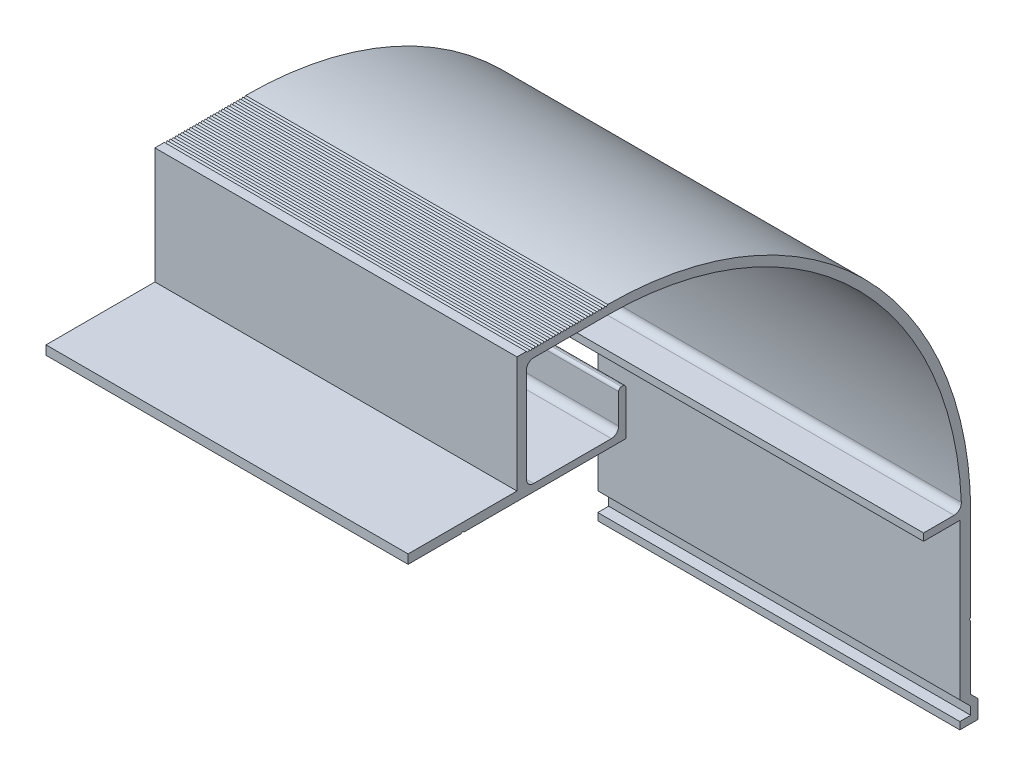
ISO-10303-21;
HEADER;
FILE_DESCRIPTION(('STEP AP214'),'2;1');
FILE_NAME('part.step','',(''),(''),'','','');
FILE_SCHEMA(('AUTOMOTIVE_DESIGN { 1 0 10303 214 1 1 1 1 }'));
ENDSEC;
DATA;
#1=APPLICATION_CONTEXT('core data for automotive mechanical design processes');
#2=APPLICATION_PROTOCOL_DEFINITION('international standard','automotive_design',2000,#1);
#3=PRODUCT_CONTEXT('',#1,'mechanical');
#4=PRODUCT('Part','Part','',(#3));
#5=PRODUCT_RELATED_PRODUCT_CATEGORY('part','',(#4));
#6=PRODUCT_DEFINITION_FORMATION('','',#4);
#7=PRODUCT_DEFINITION_CONTEXT('part definition',#1,'design');
#8=PRODUCT_DEFINITION('design','',#6,#7);
#9=PRODUCT_DEFINITION_SHAPE('','',#8);
#10=(LENGTH_UNIT() NAMED_UNIT(*) SI_UNIT(.MILLI.,.METRE.));
#11=(NAMED_UNIT(*) PLANE_ANGLE_UNIT() SI_UNIT($,.RADIAN.));
#12=(NAMED_UNIT(*) SI_UNIT($,.STERADIAN.) SOLID_ANGLE_UNIT());
#13=UNCERTAINTY_MEASURE_WITH_UNIT(LENGTH_MEASURE(1.E-05),#10,'distance_accuracy_value','');
#14=(GEOMETRIC_REPRESENTATION_CONTEXT(3) GLOBAL_UNCERTAINTY_ASSIGNED_CONTEXT((#13)) GLOBAL_UNIT_ASSIGNED_CONTEXT((#10,
#11,#12)) REPRESENTATION_CONTEXT('',''));
#15=CARTESIAN_POINT('',(0.,0.,0.));
#16=DIRECTION('',(0.,0.,1.));
#17=DIRECTION('',(1.,0.,0.));
#18=AXIS2_PLACEMENT_3D('',#15,#16,#17);
#19=CARTESIAN_POINT('',(49.9999999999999,34.1865458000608,-51.5304531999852));
#20=DIRECTION('',(0.,-0.707106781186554,-0.707106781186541));
#21=DIRECTION('',(0.,0.707106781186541,-0.707106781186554));
#22=AXIS2_PLACEMENT_3D('',#19,#20,#21);
#23=PLANE('',#22);
#24=DIRECTION('',(0.,-0.707106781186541,0.707106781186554));
#25=VECTOR('',#24,1.);
#26=CARTESIAN_POINT('',(-50.,34.1865458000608,-51.5304531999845));
#27=LINE('',#26,#25);
#28=CARTESIAN_POINT('',(-50.,34.5875610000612,-51.931468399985));
#29=VERTEX_POINT('',#28);
#30=CARTESIAN_POINT('',(-50.,34.1865458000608,-51.5304531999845));
#31=VERTEX_POINT('',#30);
#32=EDGE_CURVE('E642',#29,#31,#27,.T.);
#33=ORIENTED_EDGE('',*,*,#32,.T.);
#34=DIRECTION('',(-1.,0.,0.));
#35=VECTOR('',#34,1.);
#36=CARTESIAN_POINT('',(49.9999999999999,34.1865458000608,-51.5304531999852));
#37=LINE('',#36,#35);
#38=CARTESIAN_POINT('',(49.9999999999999,34.1865458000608,-51.5304531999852));
#39=VERTEX_POINT('',#38);
#40=EDGE_CURVE('E11',#39,#31,#37,.T.);
#41=ORIENTED_EDGE('',*,*,#40,.F.);
#42=DIRECTION('',(0.,-0.707106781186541,0.707106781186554));
#43=VECTOR('',#42,1.);
#44=CARTESIAN_POINT('',(49.9999999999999,34.1865458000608,-51.5304531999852));
#45=LINE('',#44,#43);
#46=CARTESIAN_POINT('',(50.,34.5875610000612,-51.9314683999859));
#47=VERTEX_POINT('',#46);
#48=EDGE_CURVE('E826',#47,#39,#45,.T.);
#49=ORIENTED_EDGE('',*,*,#48,.F.);
#50=DIRECTION('',(-1.,0.,0.));
#51=VECTOR('',#50,1.);
#52=CARTESIAN_POINT('',(50.,34.5875610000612,-51.9314683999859));
#53=LINE('',#52,#51);
#54=EDGE_CURVE('E638',#47,#29,#53,.T.);
#55=ORIENTED_EDGE('',*,*,#54,.T.);
#56=EDGE_LOOP('',(#33,#41,#49,#55));
#57=FACE_BOUND('',#56,.T.);
#58=ADVANCED_FACE('F36',(#57),#23,.F.);
#59=CARTESIAN_POINT('',(50.,34.5875610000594,-51.1294379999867));
#60=DIRECTION('',(0.,-0.707106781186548,0.707106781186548));
#61=DIRECTION('',(0.,-0.707106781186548,-0.707106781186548));
#62=AXIS2_PLACEMENT_3D('',#59,#60,#61);
#63=PLANE('',#62);
#64=DIRECTION('',(0.,0.707106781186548,0.707106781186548));
#65=VECTOR('',#64,1.);
#66=CARTESIAN_POINT('',(-50.,34.5875610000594,-51.1294379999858));
#67=LINE('',#66,#65);
#68=CARTESIAN_POINT('',(-50.,34.5875610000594,-51.1294379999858));
#69=VERTEX_POINT('',#68);
#70=EDGE_CURVE('E645',#31,#69,#67,.T.);
#71=ORIENTED_EDGE('',*,*,#70,.T.);
#72=DIRECTION('',(-1.,0.,0.));
#73=VECTOR('',#72,1.);
#74=CARTESIAN_POINT('',(50.,34.5875610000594,-51.1294379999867));
#75=LINE('',#74,#73);
#76=CARTESIAN_POINT('',(50.,34.5875610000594,-51.1294379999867));
#77=VERTEX_POINT('',#76);
#78=EDGE_CURVE('E44',#77,#69,#75,.T.);
#79=ORIENTED_EDGE('',*,*,#78,.F.);
#80=DIRECTION('',(0.,0.707106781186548,0.707106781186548));
#81=VECTOR('',#80,1.);
#82=CARTESIAN_POINT('',(50.,34.5875610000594,-51.1294379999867));
#83=LINE('',#82,#81);
#84=EDGE_CURVE('E350',#39,#77,#83,.T.);
#85=ORIENTED_EDGE('',*,*,#84,.F.);
#86=ORIENTED_EDGE('',*,*,#40,.T.);
#87=EDGE_LOOP('',(#71,#79,#85,#86));
#88=FACE_BOUND('',#87,.T.);
#89=ADVANCED_FACE('F1309',(#88),#63,.F.);
#90=CARTESIAN_POINT('',(50.,34.186545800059,-50.7284227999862));
#91=DIRECTION('',(0.,-0.707106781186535,-0.70710678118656));
#92=DIRECTION('',(0.,0.70710678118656,-0.707106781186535));
#93=AXIS2_PLACEMENT_3D('',#90,#91,#92);
#94=PLANE('',#93);
#95=DIRECTION('',(0.,-0.70710678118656,0.707106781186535));
#96=VECTOR('',#95,1.);
#97=CARTESIAN_POINT('',(-50.,34.186545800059,-50.7284227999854));
#98=LINE('',#97,#96);
#99=CARTESIAN_POINT('',(-50.,34.186545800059,-50.7284227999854));
#100=VERTEX_POINT('',#99);
#101=EDGE_CURVE('E647',#69,#100,#98,.T.);
#102=ORIENTED_EDGE('',*,*,#101,.T.);
#103=DIRECTION('',(-1.,0.,0.));
#104=VECTOR('',#103,1.);
#105=CARTESIAN_POINT('',(50.,34.186545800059,-50.7284227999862));
#106=LINE('',#105,#104);
#107=CARTESIAN_POINT('',(50.,34.186545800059,-50.7284227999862));
#108=VERTEX_POINT('',#107);
#109=EDGE_CURVE('E1088',#108,#100,#106,.T.);
#110=ORIENTED_EDGE('',*,*,#109,.F.);
#111=DIRECTION('',(0.,-0.70710678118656,0.707106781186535));
#112=VECTOR('',#111,1.);
#113=CARTESIAN_POINT('',(50.,34.186545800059,-50.7284227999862));
#114=LINE('',#113,#112);
#115=EDGE_CURVE('E1096',#77,#108,#114,.T.);
#116=ORIENTED_EDGE('',*,*,#115,.F.);
#117=ORIENTED_EDGE('',*,*,#78,.T.);
#118=EDGE_LOOP('',(#102,#110,#116,#117));
#119=FACE_BOUND('',#118,.T.);
#120=ADVANCED_FACE('F1094',(#119),#94,.F.);
#121=CARTESIAN_POINT('',(50.,34.5875610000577,-50.3274075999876));
#122=DIRECTION('',(0.,-0.707106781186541,0.707106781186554));
#123=DIRECTION('',(0.,-0.707106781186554,-0.707106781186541));
#124=AXIS2_PLACEMENT_3D('',#121,#122,#123);
#125=PLANE('',#124);
#126=DIRECTION('',(0.,0.707106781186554,0.707106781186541));
#127=VECTOR('',#126,1.);
#128=CARTESIAN_POINT('',(-50.,34.5875610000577,-50.3274075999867));
#129=LINE('',#128,#127);
#130=CARTESIAN_POINT('',(-50.,34.5875610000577,-50.3274075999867));
#131=VERTEX_POINT('',#130);
#132=EDGE_CURVE('E649',#100,#131,#129,.T.);
#133=ORIENTED_EDGE('',*,*,#132,.T.);
#134=DIRECTION('',(-1.,0.,0.));
#135=VECTOR('',#134,1.);
#136=CARTESIAN_POINT('',(50.,34.5875610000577,-50.3274075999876));
#137=LINE('',#136,#135);
#138=CARTESIAN_POINT('',(50.,34.5875610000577,-50.3274075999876));
#139=VERTEX_POINT('',#138);
#140=EDGE_CURVE('E1085',#139,#131,#137,.T.);
#141=ORIENTED_EDGE('',*,*,#140,.F.);
#142=DIRECTION('',(0.,0.707106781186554,0.707106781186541));
#143=VECTOR('',#142,1.);
#144=CARTESIAN_POINT('',(50.,34.5875610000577,-50.3274075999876));
#145=LINE('',#144,#143);
#146=EDGE_CURVE('E1114',#108,#139,#145,.T.);
#147=ORIENTED_EDGE('',*,*,#146,.F.);
#148=ORIENTED_EDGE('',*,*,#109,.T.);
#149=EDGE_LOOP('',(#133,#141,#147,#148));
#150=FACE_BOUND('',#149,.T.);
#151=ADVANCED_FACE('F1105',(#150),#125,.F.);
#152=CARTESIAN_POINT('',(50.,34.1865458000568,-49.9263923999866));
#153=DIRECTION('',(0.,-0.707106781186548,-0.707106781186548));
#154=DIRECTION('',(0.,0.707106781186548,-0.707106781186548));
#155=AXIS2_PLACEMENT_3D('',#152,#153,#154);
#156=PLANE('',#155);
#157=DIRECTION('',(0.,-0.707106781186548,0.707106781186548));
#158=VECTOR('',#157,1.);
#159=CARTESIAN_POINT('',(-50.,34.1865458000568,-49.926392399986));
#160=LINE('',#159,#158);
#161=CARTESIAN_POINT('',(-50.,34.1865458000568,-49.926392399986));
#162=VERTEX_POINT('',#161);
#163=EDGE_CURVE('E651',#131,#162,#160,.T.);
#164=ORIENTED_EDGE('',*,*,#163,.T.);
#165=DIRECTION('',(-1.,0.,0.));
#166=VECTOR('',#165,1.);
#167=CARTESIAN_POINT('',(50.,34.1865458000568,-49.9263923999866));
#168=LINE('',#167,#166);
#169=CARTESIAN_POINT('',(50.,34.1865458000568,-49.9263923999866));
#170=VERTEX_POINT('',#169);
#171=EDGE_CURVE('E1082',#170,#162,#168,.T.);
#172=ORIENTED_EDGE('',*,*,#171,.F.);
#173=DIRECTION('',(0.,-0.707106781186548,0.707106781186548));
#174=VECTOR('',#173,1.);
#175=CARTESIAN_POINT('',(50.,34.1865458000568,-49.9263923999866));
#176=LINE('',#175,#174);
#177=EDGE_CURVE('E1111',#139,#170,#176,.T.);
#178=ORIENTED_EDGE('',*,*,#177,.F.);
#179=ORIENTED_EDGE('',*,*,#140,.T.);
#180=EDGE_LOOP('',(#164,#172,#178,#179));
#181=FACE_BOUND('',#180,.T.);
#182=ADVANCED_FACE('F1109',(#181),#156,.F.);
#183=CARTESIAN_POINT('',(50.,34.5875610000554,-49.525377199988));
#184=DIRECTION('',(0.,-0.707106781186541,0.707106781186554));
#185=DIRECTION('',(0.,-0.707106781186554,-0.707106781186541));
#186=AXIS2_PLACEMENT_3D('',#183,#184,#185);
#187=PLANE('',#186);
#188=DIRECTION('',(0.,0.707106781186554,0.707106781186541));
#189=VECTOR('',#188,1.);
#190=CARTESIAN_POINT('',(-50.,34.5875610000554,-49.5253771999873));
#191=LINE('',#190,#189);
#192=CARTESIAN_POINT('',(-50.,34.5875610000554,-49.5253771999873));
#193=VERTEX_POINT('',#192);
#194=EDGE_CURVE('E653',#162,#193,#191,.T.);
#195=ORIENTED_EDGE('',*,*,#194,.T.);
#196=DIRECTION('',(-1.,0.,0.));
#197=VECTOR('',#196,1.);
#198=CARTESIAN_POINT('',(50.,34.5875610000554,-49.525377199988));
#199=LINE('',#198,#197);
#200=CARTESIAN_POINT('',(50.,34.5875610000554,-49.525377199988));
#201=VERTEX_POINT('',#200);
#202=EDGE_CURVE('E1079',#201,#193,#199,.T.);
#203=ORIENTED_EDGE('',*,*,#202,.F.);
#204=DIRECTION('',(0.,0.707106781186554,0.707106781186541));
#205=VECTOR('',#204,1.);
#206=CARTESIAN_POINT('',(50.,34.5875610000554,-49.525377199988));
#207=LINE('',#206,#205);
#208=EDGE_CURVE('E1113',#170,#201,#207,.T.);
#209=ORIENTED_EDGE('',*,*,#208,.F.);
#210=ORIENTED_EDGE('',*,*,#171,.T.);
#211=EDGE_LOOP('',(#195,#203,#209,#210));
#212=FACE_BOUND('',#211,.T.);
#213=ADVANCED_FACE('F1322',(#212),#187,.F.);
#214=CARTESIAN_POINT('',(50.,34.1865458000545,-49.124361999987));
#215=DIRECTION('',(0.,-0.707106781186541,-0.707106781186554));
#216=DIRECTION('',(0.,0.707106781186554,-0.707106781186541));
#217=AXIS2_PLACEMENT_3D('',#214,#215,#216);
#218=PLANE('',#217);
#219=DIRECTION('',(0.,-0.707106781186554,0.707106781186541));
#220=VECTOR('',#219,1.);
#221=CARTESIAN_POINT('',(-50.,34.1865458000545,-49.1243619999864));
#222=LINE('',#221,#220);
#223=CARTESIAN_POINT('',(-50.,34.1865458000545,-49.1243619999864));
#224=VERTEX_POINT('',#223);
#225=EDGE_CURVE('E655',#193,#224,#222,.T.);
#226=ORIENTED_EDGE('',*,*,#225,.T.);
#227=DIRECTION('',(-1.,0.,0.));
#228=VECTOR('',#227,1.);
#229=CARTESIAN_POINT('',(50.,34.1865458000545,-49.124361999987));
#230=LINE('',#229,#228);
#231=CARTESIAN_POINT('',(50.,34.1865458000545,-49.124361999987));
#232=VERTEX_POINT('',#231);
#233=EDGE_CURVE('E1076',#232,#224,#230,.T.);
#234=ORIENTED_EDGE('',*,*,#233,.F.);
#235=DIRECTION('',(0.,-0.707106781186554,0.707106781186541));
#236=VECTOR('',#235,1.);
#237=CARTESIAN_POINT('',(50.,34.1865458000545,-49.124361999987));
#238=LINE('',#237,#236);
#239=EDGE_CURVE('E1116',#201,#232,#238,.T.);
#240=ORIENTED_EDGE('',*,*,#239,.F.);
#241=ORIENTED_EDGE('',*,*,#202,.T.);
#242=EDGE_LOOP('',(#226,#234,#240,#241));
#243=FACE_BOUND('',#242,.T.);
#244=ADVANCED_FACE('F1325',(#243),#218,.F.);
#245=CARTESIAN_POINT('',(49.9999999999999,34.5875610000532,-48.7233467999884));
#246=DIRECTION('',(0.,-0.707106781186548,0.707106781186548));
#247=DIRECTION('',(0.,-0.707106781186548,-0.707106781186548));
#248=AXIS2_PLACEMENT_3D('',#245,#246,#247);
#249=PLANE('',#248);
#250=DIRECTION('',(0.,0.707106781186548,0.707106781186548));
#251=VECTOR('',#250,1.);
#252=CARTESIAN_POINT('',(-50.,34.5875610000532,-48.7233467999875));
#253=LINE('',#252,#251);
#254=CARTESIAN_POINT('',(-50.,34.5875610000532,-48.7233467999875));
#255=VERTEX_POINT('',#254);
#256=EDGE_CURVE('E657',#224,#255,#253,.T.);
#257=ORIENTED_EDGE('',*,*,#256,.T.);
#258=DIRECTION('',(-1.,0.,0.));
#259=VECTOR('',#258,1.);
#260=CARTESIAN_POINT('',(49.9999999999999,34.5875610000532,-48.7233467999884));
#261=LINE('',#260,#259);
#262=CARTESIAN_POINT('',(49.9999999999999,34.5875610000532,-48.7233467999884));
#263=VERTEX_POINT('',#262);
#264=EDGE_CURVE('E1073',#263,#255,#261,.T.);
#265=ORIENTED_EDGE('',*,*,#264,.F.);
#266=DIRECTION('',(0.,0.707106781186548,0.707106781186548));
#267=VECTOR('',#266,1.);
#268=CARTESIAN_POINT('',(49.9999999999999,34.5875610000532,-48.7233467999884));
#269=LINE('',#268,#267);
#270=EDGE_CURVE('E1122',#232,#263,#269,.T.);
#271=ORIENTED_EDGE('',*,*,#270,.F.);
#272=ORIENTED_EDGE('',*,*,#233,.T.);
#273=EDGE_LOOP('',(#257,#265,#271,#272));
#274=FACE_BOUND('',#273,.T.);
#275=ADVANCED_FACE('F1329',(#274),#249,.F.);
#276=CARTESIAN_POINT('',(50.,34.1865458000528,-48.3223315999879));
#277=DIRECTION('',(0.,-0.707106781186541,-0.707106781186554));
#278=DIRECTION('',(0.,0.707106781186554,-0.707106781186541));
#279=AXIS2_PLACEMENT_3D('',#276,#277,#278);
#280=PLANE('',#279);
#281=DIRECTION('',(0.,-0.707106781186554,0.707106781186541));
#282=VECTOR('',#281,1.);
#283=CARTESIAN_POINT('',(-50.,34.1865458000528,-48.3223315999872));
#284=LINE('',#283,#282);
#285=CARTESIAN_POINT('',(-50.,34.1865458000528,-48.3223315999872));
#286=VERTEX_POINT('',#285);
#287=EDGE_CURVE('E659',#255,#286,#284,.T.);
#288=ORIENTED_EDGE('',*,*,#287,.T.);
#289=DIRECTION('',(-1.,0.,0.));
#290=VECTOR('',#289,1.);
#291=CARTESIAN_POINT('',(50.,34.1865458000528,-48.3223315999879));
#292=LINE('',#291,#290);
#293=CARTESIAN_POINT('',(50.,34.1865458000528,-48.3223315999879));
#294=VERTEX_POINT('',#293);
#295=EDGE_CURVE('E1070',#294,#286,#292,.T.);
#296=ORIENTED_EDGE('',*,*,#295,.F.);
#297=DIRECTION('',(0.,-0.707106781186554,0.707106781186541));
#298=VECTOR('',#297,1.);
#299=CARTESIAN_POINT('',(50.,34.1865458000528,-48.3223315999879));
#300=LINE('',#299,#298);
#301=EDGE_CURVE('E1124',#263,#294,#300,.T.);
#302=ORIENTED_EDGE('',*,*,#301,.F.);
#303=ORIENTED_EDGE('',*,*,#264,.T.);
#304=EDGE_LOOP('',(#288,#296,#302,#303));
#305=FACE_BOUND('',#304,.T.);
#306=ADVANCED_FACE('F1333',(#305),#280,.F.);
#307=CARTESIAN_POINT('',(50.,34.5875610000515,-47.9213163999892));
#308=DIRECTION('',(0.,-0.707106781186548,0.707106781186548));
#309=DIRECTION('',(0.,-0.707106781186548,-0.707106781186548));
#310=AXIS2_PLACEMENT_3D('',#307,#308,#309);
#311=PLANE('',#310);
#312=DIRECTION('',(0.,0.707106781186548,0.707106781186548));
#313=VECTOR('',#312,1.);
#314=CARTESIAN_POINT('',(-50.,34.5875610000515,-47.9213163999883));
#315=LINE('',#314,#313);
#316=CARTESIAN_POINT('',(-50.,34.5875610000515,-47.9213163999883));
#317=VERTEX_POINT('',#316);
#318=EDGE_CURVE('E661',#286,#317,#315,.T.);
#319=ORIENTED_EDGE('',*,*,#318,.T.);
#320=DIRECTION('',(-1.,0.,0.));
#321=VECTOR('',#320,1.);
#322=CARTESIAN_POINT('',(50.,34.5875610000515,-47.9213163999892));
#323=LINE('',#322,#321);
#324=CARTESIAN_POINT('',(50.,34.5875610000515,-47.9213163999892));
#325=VERTEX_POINT('',#324);
#326=EDGE_CURVE('E1067',#325,#317,#323,.T.);
#327=ORIENTED_EDGE('',*,*,#326,.F.);
#328=DIRECTION('',(0.,0.707106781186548,0.707106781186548));
#329=VECTOR('',#328,1.);
#330=CARTESIAN_POINT('',(50.,34.5875610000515,-47.9213163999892));
#331=LINE('',#330,#329);
#332=EDGE_CURVE('E1126',#294,#325,#331,.T.);
#333=ORIENTED_EDGE('',*,*,#332,.F.);
#334=ORIENTED_EDGE('',*,*,#295,.T.);
#335=EDGE_LOOP('',(#319,#327,#333,#334));
#336=FACE_BOUND('',#335,.T.);
#337=ADVANCED_FACE('F1337',(#336),#311,.F.);
#338=CARTESIAN_POINT('',(50.,34.186545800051,-47.5203011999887));
#339=DIRECTION('',(0.,-0.707106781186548,-0.707106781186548));
#340=DIRECTION('',(0.,0.707106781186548,-0.707106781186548));
#341=AXIS2_PLACEMENT_3D('',#338,#339,#340);
#342=PLANE('',#341);
#343=DIRECTION('',(0.,-0.707106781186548,0.707106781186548));
#344=VECTOR('',#343,1.);
#345=CARTESIAN_POINT('',(-50.,34.186545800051,-47.5203011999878));
#346=LINE('',#345,#344);
#347=CARTESIAN_POINT('',(-50.,34.186545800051,-47.5203011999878));
#348=VERTEX_POINT('',#347);
#349=EDGE_CURVE('E663',#317,#348,#346,.T.);
#350=ORIENTED_EDGE('',*,*,#349,.T.);
#351=DIRECTION('',(-1.,0.,0.));
#352=VECTOR('',#351,1.);
#353=CARTESIAN_POINT('',(50.,34.186545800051,-47.5203011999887));
#354=LINE('',#353,#352);
#355=CARTESIAN_POINT('',(50.,34.186545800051,-47.5203011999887));
#356=VERTEX_POINT('',#355);
#357=EDGE_CURVE('E1064',#356,#348,#354,.T.);
#358=ORIENTED_EDGE('',*,*,#357,.F.);
#359=DIRECTION('',(0.,-0.707106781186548,0.707106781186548));
#360=VECTOR('',#359,1.);
#361=CARTESIAN_POINT('',(50.,34.186545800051,-47.5203011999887));
#362=LINE('',#361,#360);
#363=EDGE_CURVE('E1128',#325,#356,#362,.T.);
#364=ORIENTED_EDGE('',*,*,#363,.F.);
#365=ORIENTED_EDGE('',*,*,#326,.T.);
#366=EDGE_LOOP('',(#350,#358,#364,#365));
#367=FACE_BOUND('',#366,.T.);
#368=ADVANCED_FACE('F1341',(#367),#342,.F.);
#369=CARTESIAN_POINT('',(50.,34.5875610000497,-47.11928599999));
#370=DIRECTION('',(0.,-0.707106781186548,0.707106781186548));
#371=DIRECTION('',(0.,-0.707106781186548,-0.707106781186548));
#372=AXIS2_PLACEMENT_3D('',#369,#370,#371);
#373=PLANE('',#372);
#374=DIRECTION('',(0.,0.707106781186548,0.707106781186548));
#375=VECTOR('',#374,1.);
#376=CARTESIAN_POINT('',(-50.,34.5875610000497,-47.1192859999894));
#377=LINE('',#376,#375);
#378=CARTESIAN_POINT('',(-50.,34.5875610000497,-47.1192859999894));
#379=VERTEX_POINT('',#378);
#380=EDGE_CURVE('E665',#348,#379,#377,.T.);
#381=ORIENTED_EDGE('',*,*,#380,.T.);
#382=DIRECTION('',(-1.,0.,0.));
#383=VECTOR('',#382,1.);
#384=CARTESIAN_POINT('',(50.,34.5875610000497,-47.11928599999));
#385=LINE('',#384,#383);
#386=CARTESIAN_POINT('',(50.,34.5875610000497,-47.11928599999));
#387=VERTEX_POINT('',#386);
#388=EDGE_CURVE('E1061',#387,#379,#385,.T.);
#389=ORIENTED_EDGE('',*,*,#388,.F.);
#390=DIRECTION('',(0.,0.707106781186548,0.707106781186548));
#391=VECTOR('',#390,1.);
#392=CARTESIAN_POINT('',(50.,34.5875610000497,-47.11928599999));
#393=LINE('',#392,#391);
#394=EDGE_CURVE('E1130',#356,#387,#393,.T.);
#395=ORIENTED_EDGE('',*,*,#394,.F.);
#396=ORIENTED_EDGE('',*,*,#357,.T.);
#397=EDGE_LOOP('',(#381,#389,#395,#396));
#398=FACE_BOUND('',#397,.T.);
#399=ADVANCED_FACE('F1345',(#398),#373,.F.);
#400=CARTESIAN_POINT('',(50.,34.1865458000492,-46.7182707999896));
#401=DIRECTION('',(0.,-0.707106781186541,-0.707106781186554));
#402=DIRECTION('',(0.,0.707106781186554,-0.707106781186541));
#403=AXIS2_PLACEMENT_3D('',#400,#401,#402);
#404=PLANE('',#403);
#405=DIRECTION('',(0.,-0.707106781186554,0.707106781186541));
#406=VECTOR('',#405,1.);
#407=CARTESIAN_POINT('',(-50.,34.1865458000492,-46.7182707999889));
#408=LINE('',#407,#406);
#409=CARTESIAN_POINT('',(-50.,34.1865458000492,-46.7182707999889));
#410=VERTEX_POINT('',#409);
#411=EDGE_CURVE('E667',#379,#410,#408,.T.);
#412=ORIENTED_EDGE('',*,*,#411,.T.);
#413=DIRECTION('',(-1.,0.,0.));
#414=VECTOR('',#413,1.);
#415=CARTESIAN_POINT('',(50.,34.1865458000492,-46.7182707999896));
#416=LINE('',#415,#414);
#417=CARTESIAN_POINT('',(50.,34.1865458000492,-46.7182707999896));
#418=VERTEX_POINT('',#417);
#419=EDGE_CURVE('E1058',#418,#410,#416,.T.);
#420=ORIENTED_EDGE('',*,*,#419,.F.);
#421=DIRECTION('',(0.,-0.707106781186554,0.707106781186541));
#422=VECTOR('',#421,1.);
#423=CARTESIAN_POINT('',(50.,34.1865458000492,-46.7182707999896));
#424=LINE('',#423,#422);
#425=EDGE_CURVE('E1132',#387,#418,#424,.T.);
#426=ORIENTED_EDGE('',*,*,#425,.F.);
#427=ORIENTED_EDGE('',*,*,#388,.T.);
#428=EDGE_LOOP('',(#412,#420,#426,#427));
#429=FACE_BOUND('',#428,.T.);
#430=ADVANCED_FACE('F1349',(#429),#404,.F.);
#431=CARTESIAN_POINT('',(50.,34.5875610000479,-46.3172555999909));
#432=DIRECTION('',(0.,-0.707106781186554,0.707106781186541));
#433=DIRECTION('',(0.,-0.707106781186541,-0.707106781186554));
#434=AXIS2_PLACEMENT_3D('',#431,#432,#433);
#435=PLANE('',#434);
#436=DIRECTION('',(0.,0.707106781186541,0.707106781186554));
#437=VECTOR('',#436,1.);
#438=CARTESIAN_POINT('',(-50.,34.5875610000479,-46.3172555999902));
#439=LINE('',#438,#437);
#440=CARTESIAN_POINT('',(-50.,34.5875610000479,-46.3172555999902));
#441=VERTEX_POINT('',#440);
#442=EDGE_CURVE('E669',#410,#441,#439,.T.);
#443=ORIENTED_EDGE('',*,*,#442,.T.);
#444=DIRECTION('',(-1.,0.,0.));
#445=VECTOR('',#444,1.);
#446=CARTESIAN_POINT('',(50.,34.5875610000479,-46.3172555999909));
#447=LINE('',#446,#445);
#448=CARTESIAN_POINT('',(50.,34.5875610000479,-46.3172555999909));
#449=VERTEX_POINT('',#448);
#450=EDGE_CURVE('E1055',#449,#441,#447,.T.);
#451=ORIENTED_EDGE('',*,*,#450,.F.);
#452=DIRECTION('',(0.,0.707106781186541,0.707106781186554));
#453=VECTOR('',#452,1.);
#454=CARTESIAN_POINT('',(50.,34.5875610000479,-46.3172555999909));
#455=LINE('',#454,#453);
#456=EDGE_CURVE('E1134',#418,#449,#455,.T.);
#457=ORIENTED_EDGE('',*,*,#456,.F.);
#458=ORIENTED_EDGE('',*,*,#419,.T.);
#459=EDGE_LOOP('',(#443,#451,#457,#458));
#460=FACE_BOUND('',#459,.T.);
#461=ADVANCED_FACE('F1353',(#460),#435,.F.);
#462=CARTESIAN_POINT('',(49.9999999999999,34.1865458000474,-45.9162403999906));
#463=DIRECTION('',(0.,-0.707106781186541,-0.707106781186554));
#464=DIRECTION('',(0.,0.707106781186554,-0.707106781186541));
#465=AXIS2_PLACEMENT_3D('',#462,#463,#464);
#466=PLANE('',#465);
#467=DIRECTION('',(0.,-0.707106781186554,0.707106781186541));
#468=VECTOR('',#467,1.);
#469=CARTESIAN_POINT('',(-50.,34.1865458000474,-45.9162403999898));
#470=LINE('',#469,#468);
#471=CARTESIAN_POINT('',(-50.,34.1865458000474,-45.9162403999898));
#472=VERTEX_POINT('',#471);
#473=EDGE_CURVE('E671',#441,#472,#470,.T.);
#474=ORIENTED_EDGE('',*,*,#473,.T.);
#475=DIRECTION('',(-1.,0.,0.));
#476=VECTOR('',#475,1.);
#477=CARTESIAN_POINT('',(49.9999999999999,34.1865458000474,-45.9162403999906));
#478=LINE('',#477,#476);
#479=CARTESIAN_POINT('',(49.9999999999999,34.1865458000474,-45.9162403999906));
#480=VERTEX_POINT('',#479);
#481=EDGE_CURVE('E1052',#480,#472,#478,.T.);
#482=ORIENTED_EDGE('',*,*,#481,.F.);
#483=DIRECTION('',(0.,-0.707106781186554,0.707106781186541));
#484=VECTOR('',#483,1.);
#485=CARTESIAN_POINT('',(49.9999999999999,34.1865458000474,-45.9162403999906));
#486=LINE('',#485,#484);
#487=EDGE_CURVE('E1136',#449,#480,#486,.T.);
#488=ORIENTED_EDGE('',*,*,#487,.F.);
#489=ORIENTED_EDGE('',*,*,#450,.T.);
#490=EDGE_LOOP('',(#474,#482,#488,#489));
#491=FACE_BOUND('',#490,.T.);
#492=ADVANCED_FACE('F1357',(#491),#466,.F.);
#493=CARTESIAN_POINT('',(50.,34.5875610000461,-45.5152251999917));
#494=DIRECTION('',(0.,-0.707106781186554,0.707106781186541));
#495=DIRECTION('',(0.,-0.707106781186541,-0.707106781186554));
#496=AXIS2_PLACEMENT_3D('',#493,#494,#495);
#497=PLANE('',#496);
#498=DIRECTION('',(0.,0.707106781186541,0.707106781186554));
#499=VECTOR('',#498,1.);
#500=CARTESIAN_POINT('',(-50.,34.5875610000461,-45.5152251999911));
#501=LINE('',#500,#499);
#502=CARTESIAN_POINT('',(-50.,34.5875610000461,-45.5152251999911));
#503=VERTEX_POINT('',#502);
#504=EDGE_CURVE('E673',#472,#503,#501,.T.);
#505=ORIENTED_EDGE('',*,*,#504,.T.);
#506=DIRECTION('',(-1.,0.,0.));
#507=VECTOR('',#506,1.);
#508=CARTESIAN_POINT('',(50.,34.5875610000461,-45.5152251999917));
#509=LINE('',#508,#507);
#510=CARTESIAN_POINT('',(50.,34.5875610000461,-45.5152251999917));
#511=VERTEX_POINT('',#510);
#512=EDGE_CURVE('E1049',#511,#503,#509,.T.);
#513=ORIENTED_EDGE('',*,*,#512,.F.);
#514=DIRECTION('',(0.,0.707106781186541,0.707106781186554));
#515=VECTOR('',#514,1.);
#516=CARTESIAN_POINT('',(50.,34.5875610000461,-45.5152251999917));
#517=LINE('',#516,#515);
#518=EDGE_CURVE('E1138',#480,#511,#517,.T.);
#519=ORIENTED_EDGE('',*,*,#518,.F.);
#520=ORIENTED_EDGE('',*,*,#481,.T.);
#521=EDGE_LOOP('',(#505,#513,#519,#520));
#522=FACE_BOUND('',#521,.T.);
#523=ADVANCED_FACE('F1361',(#522),#497,.F.);
#524=CARTESIAN_POINT('',(50.,34.1865458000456,-45.1142099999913));
#525=DIRECTION('',(0.,-0.707106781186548,-0.707106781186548));
#526=DIRECTION('',(0.,0.707106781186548,-0.707106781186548));
#527=AXIS2_PLACEMENT_3D('',#524,#525,#526);
#528=PLANE('',#527);
#529=DIRECTION('',(0.,-0.707106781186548,0.707106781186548));
#530=VECTOR('',#529,1.);
#531=CARTESIAN_POINT('',(-50.,34.1865458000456,-45.1142099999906));
#532=LINE('',#531,#530);
#533=CARTESIAN_POINT('',(-50.,34.1865458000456,-45.1142099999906));
#534=VERTEX_POINT('',#533);
#535=EDGE_CURVE('E675',#503,#534,#532,.T.);
#536=ORIENTED_EDGE('',*,*,#535,.T.);
#537=DIRECTION('',(-1.,0.,0.));
#538=VECTOR('',#537,1.);
#539=CARTESIAN_POINT('',(50.,34.1865458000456,-45.1142099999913));
#540=LINE('',#539,#538);
#541=CARTESIAN_POINT('',(50.,34.1865458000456,-45.1142099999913));
#542=VERTEX_POINT('',#541);
#543=EDGE_CURVE('E1046',#542,#534,#540,.T.);
#544=ORIENTED_EDGE('',*,*,#543,.F.);
#545=DIRECTION('',(0.,-0.707106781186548,0.707106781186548));
#546=VECTOR('',#545,1.);
#547=CARTESIAN_POINT('',(50.,34.1865458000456,-45.1142099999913));
#548=LINE('',#547,#546);
#549=EDGE_CURVE('E1140',#511,#542,#548,.T.);
#550=ORIENTED_EDGE('',*,*,#549,.F.);
#551=ORIENTED_EDGE('',*,*,#512,.T.);
#552=EDGE_LOOP('',(#536,#544,#550,#551));
#553=FACE_BOUND('',#552,.T.);
#554=ADVANCED_FACE('F1365',(#553),#528,.F.);
#555=CARTESIAN_POINT('',(50.,34.5875610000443,-44.7131947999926));
#556=DIRECTION('',(0.,-0.707106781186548,0.707106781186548));
#557=DIRECTION('',(0.,-0.707106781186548,-0.707106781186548));
#558=AXIS2_PLACEMENT_3D('',#555,#556,#557);
#559=PLANE('',#558);
#560=DIRECTION('',(0.,0.707106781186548,0.707106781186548));
#561=VECTOR('',#560,1.);
#562=CARTESIAN_POINT('',(-50.,34.5875610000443,-44.7131947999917));
#563=LINE('',#562,#561);
#564=CARTESIAN_POINT('',(-50.,34.5875610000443,-44.7131947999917));
#565=VERTEX_POINT('',#564);
#566=EDGE_CURVE('E677',#534,#565,#563,.T.);
#567=ORIENTED_EDGE('',*,*,#566,.T.);
#568=DIRECTION('',(-1.,0.,0.));
#569=VECTOR('',#568,1.);
#570=CARTESIAN_POINT('',(50.,34.5875610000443,-44.7131947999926));
#571=LINE('',#570,#569);
#572=CARTESIAN_POINT('',(50.,34.5875610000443,-44.7131947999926));
#573=VERTEX_POINT('',#572);
#574=EDGE_CURVE('E1043',#573,#565,#571,.T.);
#575=ORIENTED_EDGE('',*,*,#574,.F.);
#576=DIRECTION('',(0.,0.707106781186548,0.707106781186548));
#577=VECTOR('',#576,1.);
#578=CARTESIAN_POINT('',(50.,34.5875610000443,-44.7131947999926));
#579=LINE('',#578,#577);
#580=EDGE_CURVE('E1142',#542,#573,#579,.T.);
#581=ORIENTED_EDGE('',*,*,#580,.F.);
#582=ORIENTED_EDGE('',*,*,#543,.T.);
#583=EDGE_LOOP('',(#567,#575,#581,#582));
#584=FACE_BOUND('',#583,.T.);
#585=ADVANCED_FACE('F1369',(#584),#559,.F.);
#586=CARTESIAN_POINT('',(50.,34.1865458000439,-44.3121795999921));
#587=DIRECTION('',(0.,-0.707106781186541,-0.707106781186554));
#588=DIRECTION('',(0.,0.707106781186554,-0.707106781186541));
#589=AXIS2_PLACEMENT_3D('',#586,#587,#588);
#590=PLANE('',#589);
#591=DIRECTION('',(0.,-0.707106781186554,0.707106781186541));
#592=VECTOR('',#591,1.);
#593=CARTESIAN_POINT('',(-50.,34.1865458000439,-44.3121795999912));
#594=LINE('',#593,#592);
#595=CARTESIAN_POINT('',(-50.,34.1865458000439,-44.3121795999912));
#596=VERTEX_POINT('',#595);
#597=EDGE_CURVE('E679',#565,#596,#594,.T.);
#598=ORIENTED_EDGE('',*,*,#597,.T.);
#599=DIRECTION('',(-1.,0.,0.));
#600=VECTOR('',#599,1.);
#601=CARTESIAN_POINT('',(50.,34.1865458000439,-44.3121795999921));
#602=LINE('',#601,#600);
#603=CARTESIAN_POINT('',(50.,34.1865458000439,-44.3121795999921));
#604=VERTEX_POINT('',#603);
#605=EDGE_CURVE('E1040',#604,#596,#602,.T.);
#606=ORIENTED_EDGE('',*,*,#605,.F.);
#607=DIRECTION('',(0.,-0.707106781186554,0.707106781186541));
#608=VECTOR('',#607,1.);
#609=CARTESIAN_POINT('',(50.,34.1865458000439,-44.3121795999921));
#610=LINE('',#609,#608);
#611=EDGE_CURVE('E1144',#573,#604,#610,.T.);
#612=ORIENTED_EDGE('',*,*,#611,.F.);
#613=ORIENTED_EDGE('',*,*,#574,.T.);
#614=EDGE_LOOP('',(#598,#606,#612,#613));
#615=FACE_BOUND('',#614,.T.);
#616=ADVANCED_FACE('F1373',(#615),#590,.F.);
#617=CARTESIAN_POINT('',(50.,34.5875610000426,-43.9111643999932));
#618=DIRECTION('',(0.,-0.707106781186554,0.707106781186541));
#619=DIRECTION('',(0.,-0.707106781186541,-0.707106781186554));
#620=AXIS2_PLACEMENT_3D('',#617,#618,#619);
#621=PLANE('',#620);
#622=DIRECTION('',(0.,0.707106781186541,0.707106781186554));
#623=VECTOR('',#622,1.);
#624=CARTESIAN_POINT('',(-50.,34.5875610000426,-43.9111643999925));
#625=LINE('',#624,#623);
#626=CARTESIAN_POINT('',(-50.,34.5875610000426,-43.9111643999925));
#627=VERTEX_POINT('',#626);
#628=EDGE_CURVE('E681',#596,#627,#625,.T.);
#629=ORIENTED_EDGE('',*,*,#628,.T.);
#630=DIRECTION('',(-1.,0.,0.));
#631=VECTOR('',#630,1.);
#632=CARTESIAN_POINT('',(50.,34.5875610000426,-43.9111643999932));
#633=LINE('',#632,#631);
#634=CARTESIAN_POINT('',(50.,34.5875610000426,-43.9111643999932));
#635=VERTEX_POINT('',#634);
#636=EDGE_CURVE('E1037',#635,#627,#633,.T.);
#637=ORIENTED_EDGE('',*,*,#636,.F.);
#638=DIRECTION('',(0.,0.707106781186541,0.707106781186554));
#639=VECTOR('',#638,1.);
#640=CARTESIAN_POINT('',(50.,34.5875610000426,-43.9111643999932));
#641=LINE('',#640,#639);
#642=EDGE_CURVE('E1146',#604,#635,#641,.T.);
#643=ORIENTED_EDGE('',*,*,#642,.F.);
#644=ORIENTED_EDGE('',*,*,#605,.T.);
#645=EDGE_LOOP('',(#629,#637,#643,#644));
#646=FACE_BOUND('',#645,.T.);
#647=ADVANCED_FACE('F1377',(#646),#621,.F.);
#648=CARTESIAN_POINT('',(49.9999999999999,34.1865458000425,-43.510149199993));
#649=DIRECTION('',(0.,-0.707106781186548,-0.707106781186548));
#650=DIRECTION('',(0.,0.707106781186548,-0.707106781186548));
#651=AXIS2_PLACEMENT_3D('',#648,#649,#650);
#652=PLANE('',#651);
#653=DIRECTION('',(0.,-0.707106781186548,0.707106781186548));
#654=VECTOR('',#653,1.);
#655=CARTESIAN_POINT('',(-50.,34.1865458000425,-43.5101491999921));
#656=LINE('',#655,#654);
#657=CARTESIAN_POINT('',(-50.,34.1865458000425,-43.5101491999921));
#658=VERTEX_POINT('',#657);
#659=EDGE_CURVE('E683',#627,#658,#656,.T.);
#660=ORIENTED_EDGE('',*,*,#659,.T.);
#661=DIRECTION('',(-1.,0.,0.));
#662=VECTOR('',#661,1.);
#663=CARTESIAN_POINT('',(49.9999999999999,34.1865458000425,-43.510149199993));
#664=LINE('',#663,#662);
#665=CARTESIAN_POINT('',(49.9999999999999,34.1865458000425,-43.510149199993));
#666=VERTEX_POINT('',#665);
#667=EDGE_CURVE('E1034',#666,#658,#664,.T.);
#668=ORIENTED_EDGE('',*,*,#667,.F.);
#669=DIRECTION('',(0.,-0.707106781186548,0.707106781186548));
#670=VECTOR('',#669,1.);
#671=CARTESIAN_POINT('',(49.9999999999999,34.1865458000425,-43.510149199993));
#672=LINE('',#671,#670);
#673=EDGE_CURVE('E1148',#635,#666,#672,.T.);
#674=ORIENTED_EDGE('',*,*,#673,.F.);
#675=ORIENTED_EDGE('',*,*,#636,.T.);
#676=EDGE_LOOP('',(#660,#668,#674,#675));
#677=FACE_BOUND('',#676,.T.);
#678=ADVANCED_FACE('F1381',(#677),#652,.F.);
#679=CARTESIAN_POINT('',(50.,34.5875610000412,-43.1091339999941));
#680=DIRECTION('',(0.,-0.707106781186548,0.707106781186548));
#681=DIRECTION('',(0.,-0.707106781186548,-0.707106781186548));
#682=AXIS2_PLACEMENT_3D('',#679,#680,#681);
#683=PLANE('',#682);
#684=DIRECTION('',(0.,0.707106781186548,0.707106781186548));
#685=VECTOR('',#684,1.);
#686=CARTESIAN_POINT('',(-50.,34.5875610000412,-43.1091339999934));
#687=LINE('',#686,#685);
#688=CARTESIAN_POINT('',(-50.,34.5875610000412,-43.1091339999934));
#689=VERTEX_POINT('',#688);
#690=EDGE_CURVE('E685',#658,#689,#687,.T.);
#691=ORIENTED_EDGE('',*,*,#690,.T.);
#692=DIRECTION('',(-1.,0.,0.));
#693=VECTOR('',#692,1.);
#694=CARTESIAN_POINT('',(50.,34.5875610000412,-43.1091339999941));
#695=LINE('',#694,#693);
#696=CARTESIAN_POINT('',(50.,34.5875610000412,-43.1091339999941));
#697=VERTEX_POINT('',#696);
#698=EDGE_CURVE('E1031',#697,#689,#695,.T.);
#699=ORIENTED_EDGE('',*,*,#698,.F.);
#700=DIRECTION('',(0.,0.707106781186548,0.707106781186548));
#701=VECTOR('',#700,1.);
#702=CARTESIAN_POINT('',(50.,34.5875610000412,-43.1091339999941));
#703=LINE('',#702,#701);
#704=EDGE_CURVE('E1150',#666,#697,#703,.T.);
#705=ORIENTED_EDGE('',*,*,#704,.F.);
#706=ORIENTED_EDGE('',*,*,#667,.T.);
#707=EDGE_LOOP('',(#691,#699,#705,#706));
#708=FACE_BOUND('',#707,.T.);
#709=ADVANCED_FACE('F1385',(#708),#683,.F.);
#710=CARTESIAN_POINT('',(50.,34.1865458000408,-42.7081187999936));
#711=DIRECTION('',(0.,-0.707106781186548,-0.707106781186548));
#712=DIRECTION('',(0.,0.707106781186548,-0.707106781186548));
#713=AXIS2_PLACEMENT_3D('',#710,#711,#712);
#714=PLANE('',#713);
#715=DIRECTION('',(0.,-0.707106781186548,0.707106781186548));
#716=VECTOR('',#715,1.);
#717=CARTESIAN_POINT('',(-50.,34.1865458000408,-42.7081187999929));
#718=LINE('',#717,#716);
#719=CARTESIAN_POINT('',(-50.,34.1865458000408,-42.7081187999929));
#720=VERTEX_POINT('',#719);
#721=EDGE_CURVE('E687',#689,#720,#718,.T.);
#722=ORIENTED_EDGE('',*,*,#721,.T.);
#723=DIRECTION('',(-1.,0.,0.));
#724=VECTOR('',#723,1.);
#725=CARTESIAN_POINT('',(50.,34.1865458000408,-42.7081187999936));
#726=LINE('',#725,#724);
#727=CARTESIAN_POINT('',(50.,34.1865458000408,-42.7081187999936));
#728=VERTEX_POINT('',#727);
#729=EDGE_CURVE('E1028',#728,#720,#726,.T.);
#730=ORIENTED_EDGE('',*,*,#729,.F.);
#731=DIRECTION('',(0.,-0.707106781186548,0.707106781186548));
#732=VECTOR('',#731,1.);
#733=CARTESIAN_POINT('',(50.,34.1865458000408,-42.7081187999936));
#734=LINE('',#733,#732);
#735=EDGE_CURVE('E1152',#697,#728,#734,.T.);
#736=ORIENTED_EDGE('',*,*,#735,.F.);
#737=ORIENTED_EDGE('',*,*,#698,.T.);
#738=EDGE_LOOP('',(#722,#730,#736,#737));
#739=FACE_BOUND('',#738,.T.);
#740=ADVANCED_FACE('F1389',(#739),#714,.F.);
#741=CARTESIAN_POINT('',(50.,34.5875610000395,-42.3071035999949));
#742=DIRECTION('',(0.,-0.707106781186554,0.707106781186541));
#743=DIRECTION('',(0.,-0.707106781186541,-0.707106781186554));
#744=AXIS2_PLACEMENT_3D('',#741,#742,#743);
#745=PLANE('',#744);
#746=DIRECTION('',(0.,0.707106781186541,0.707106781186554));
#747=VECTOR('',#746,1.);
#748=CARTESIAN_POINT('',(-50.,34.5875610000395,-42.307103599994));
#749=LINE('',#748,#747);
#750=CARTESIAN_POINT('',(-50.,34.5875610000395,-42.307103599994));
#751=VERTEX_POINT('',#750);
#752=EDGE_CURVE('E689',#720,#751,#749,.T.);
#753=ORIENTED_EDGE('',*,*,#752,.T.);
#754=DIRECTION('',(-1.,0.,0.));
#755=VECTOR('',#754,1.);
#756=CARTESIAN_POINT('',(50.,34.5875610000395,-42.3071035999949));
#757=LINE('',#756,#755);
#758=CARTESIAN_POINT('',(50.,34.5875610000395,-42.3071035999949));
#759=VERTEX_POINT('',#758);
#760=EDGE_CURVE('E1025',#759,#751,#757,.T.);
#761=ORIENTED_EDGE('',*,*,#760,.F.);
#762=DIRECTION('',(0.,0.707106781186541,0.707106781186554));
#763=VECTOR('',#762,1.);
#764=CARTESIAN_POINT('',(50.,34.5875610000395,-42.3071035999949));
#765=LINE('',#764,#763);
#766=EDGE_CURVE('E1154',#728,#759,#765,.T.);
#767=ORIENTED_EDGE('',*,*,#766,.F.);
#768=ORIENTED_EDGE('',*,*,#729,.T.);
#769=EDGE_LOOP('',(#753,#761,#767,#768));
#770=FACE_BOUND('',#769,.T.);
#771=ADVANCED_FACE('F1393',(#770),#745,.F.);
#772=CARTESIAN_POINT('',(50.,34.186545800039,-41.9060883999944));
#773=DIRECTION('',(0.,-0.707106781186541,-0.707106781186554));
#774=DIRECTION('',(0.,0.707106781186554,-0.707106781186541));
#775=AXIS2_PLACEMENT_3D('',#772,#773,#774);
#776=PLANE('',#775);
#777=DIRECTION('',(0.,-0.707106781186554,0.707106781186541));
#778=VECTOR('',#777,1.);
#779=CARTESIAN_POINT('',(-50.,34.186545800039,-41.9060883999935));
#780=LINE('',#779,#778);
#781=CARTESIAN_POINT('',(-50.,34.186545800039,-41.9060883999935));
#782=VERTEX_POINT('',#781);
#783=EDGE_CURVE('E691',#751,#782,#780,.T.);
#784=ORIENTED_EDGE('',*,*,#783,.T.);
#785=DIRECTION('',(-1.,0.,0.));
#786=VECTOR('',#785,1.);
#787=CARTESIAN_POINT('',(50.,34.186545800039,-41.9060883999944));
#788=LINE('',#787,#786);
#789=CARTESIAN_POINT('',(50.,34.186545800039,-41.9060883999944));
#790=VERTEX_POINT('',#789);
#791=EDGE_CURVE('E1022',#790,#782,#788,.T.);
#792=ORIENTED_EDGE('',*,*,#791,.F.);
#793=DIRECTION('',(0.,-0.707106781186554,0.707106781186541));
#794=VECTOR('',#793,1.);
#795=CARTESIAN_POINT('',(50.,34.186545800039,-41.9060883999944));
#796=LINE('',#795,#794);
#797=EDGE_CURVE('E1156',#759,#790,#796,.T.);
#798=ORIENTED_EDGE('',*,*,#797,.F.);
#799=ORIENTED_EDGE('',*,*,#760,.T.);
#800=EDGE_LOOP('',(#784,#792,#798,#799));
#801=FACE_BOUND('',#800,.T.);
#802=ADVANCED_FACE('F1397',(#801),#776,.F.);
#803=CARTESIAN_POINT('',(50.,34.5875610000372,-41.5050731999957));
#804=DIRECTION('',(0.,-0.707106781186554,0.707106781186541));
#805=DIRECTION('',(0.,-0.707106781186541,-0.707106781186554));
#806=AXIS2_PLACEMENT_3D('',#803,#804,#805);
#807=PLANE('',#806);
#808=DIRECTION('',(0.,0.707106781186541,0.707106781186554));
#809=VECTOR('',#808,1.);
#810=CARTESIAN_POINT('',(-50.,34.5875610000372,-41.5050731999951));
#811=LINE('',#810,#809);
#812=CARTESIAN_POINT('',(-50.,34.5875610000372,-41.5050731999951));
#813=VERTEX_POINT('',#812);
#814=EDGE_CURVE('E693',#782,#813,#811,.T.);
#815=ORIENTED_EDGE('',*,*,#814,.T.);
#816=DIRECTION('',(-1.,0.,0.));
#817=VECTOR('',#816,1.);
#818=CARTESIAN_POINT('',(50.,34.5875610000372,-41.5050731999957));
#819=LINE('',#818,#817);
#820=CARTESIAN_POINT('',(50.,34.5875610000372,-41.5050731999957));
#821=VERTEX_POINT('',#820);
#822=EDGE_CURVE('E1019',#821,#813,#819,.T.);
#823=ORIENTED_EDGE('',*,*,#822,.F.);
#824=DIRECTION('',(0.,0.707106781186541,0.707106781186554));
#825=VECTOR('',#824,1.);
#826=CARTESIAN_POINT('',(50.,34.5875610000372,-41.5050731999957));
#827=LINE('',#826,#825);
#828=EDGE_CURVE('E1158',#790,#821,#827,.T.);
#829=ORIENTED_EDGE('',*,*,#828,.F.);
#830=ORIENTED_EDGE('',*,*,#791,.T.);
#831=EDGE_LOOP('',(#815,#823,#829,#830));
#832=FACE_BOUND('',#831,.T.);
#833=ADVANCED_FACE('F1401',(#832),#807,.F.);
#834=CARTESIAN_POINT('',(50.,34.1865458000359,-41.1040579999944));
#835=DIRECTION('',(0.,-0.707106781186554,-0.707106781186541));
#836=DIRECTION('',(0.,0.707106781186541,-0.707106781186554));
#837=AXIS2_PLACEMENT_3D('',#834,#835,#836);
#838=PLANE('',#837);
#839=DIRECTION('',(0.,-0.707106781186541,0.707106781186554));
#840=VECTOR('',#839,1.);
#841=CARTESIAN_POINT('',(-50.,34.1865458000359,-41.1040579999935));
#842=LINE('',#841,#840);
#843=CARTESIAN_POINT('',(-50.,34.1865458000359,-41.1040579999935));
#844=VERTEX_POINT('',#843);
#845=EDGE_CURVE('E695',#813,#844,#842,.T.);
#846=ORIENTED_EDGE('',*,*,#845,.T.);
#847=DIRECTION('',(-1.,0.,0.));
#848=VECTOR('',#847,1.);
#849=CARTESIAN_POINT('',(50.,34.1865458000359,-41.1040579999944));
#850=LINE('',#849,#848);
#851=CARTESIAN_POINT('',(50.,34.1865458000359,-41.1040579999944));
#852=VERTEX_POINT('',#851);
#853=EDGE_CURVE('E1016',#852,#844,#850,.T.);
#854=ORIENTED_EDGE('',*,*,#853,.F.);
#855=DIRECTION('',(0.,-0.707106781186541,0.707106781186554));
#856=VECTOR('',#855,1.);
#857=CARTESIAN_POINT('',(50.,34.1865458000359,-41.1040579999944));
#858=LINE('',#857,#856);
#859=EDGE_CURVE('E1160',#821,#852,#858,.T.);
#860=ORIENTED_EDGE('',*,*,#859,.F.);
#861=ORIENTED_EDGE('',*,*,#822,.T.);
#862=EDGE_LOOP('',(#846,#854,#860,#861));
#863=FACE_BOUND('',#862,.T.);
#864=ADVANCED_FACE('F1405',(#863),#838,.F.);
#865=CARTESIAN_POINT('',(49.9999999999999,34.5875610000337,-40.7030427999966));
#866=DIRECTION('',(0.,-0.707106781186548,0.707106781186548));
#867=DIRECTION('',(0.,-0.707106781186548,-0.707106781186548));
#868=AXIS2_PLACEMENT_3D('',#865,#866,#867);
#869=PLANE('',#868);
#870=DIRECTION('',(0.,0.707106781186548,0.707106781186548));
#871=VECTOR('',#870,1.);
#872=CARTESIAN_POINT('',(-50.,34.5875610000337,-40.7030427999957));
#873=LINE('',#872,#871);
#874=CARTESIAN_POINT('',(-50.,34.5875610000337,-40.7030427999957));
#875=VERTEX_POINT('',#874);
#876=EDGE_CURVE('E697',#844,#875,#873,.T.);
#877=ORIENTED_EDGE('',*,*,#876,.T.);
#878=DIRECTION('',(-1.,0.,0.));
#879=VECTOR('',#878,1.);
#880=CARTESIAN_POINT('',(49.9999999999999,34.5875610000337,-40.7030427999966));
#881=LINE('',#880,#879);
#882=CARTESIAN_POINT('',(49.9999999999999,34.5875610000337,-40.7030427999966));
#883=VERTEX_POINT('',#882);
#884=EDGE_CURVE('E1013',#883,#875,#881,.T.);
#885=ORIENTED_EDGE('',*,*,#884,.F.);
#886=DIRECTION('',(0.,0.707106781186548,0.707106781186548));
#887=VECTOR('',#886,1.);
#888=CARTESIAN_POINT('',(49.9999999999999,34.5875610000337,-40.7030427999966));
#889=LINE('',#888,#887);
#890=EDGE_CURVE('E1162',#852,#883,#889,.T.);
#891=ORIENTED_EDGE('',*,*,#890,.F.);
#892=ORIENTED_EDGE('',*,*,#853,.T.);
#893=EDGE_LOOP('',(#877,#885,#891,#892));
#894=FACE_BOUND('',#893,.T.);
#895=ADVANCED_FACE('F1409',(#894),#869,.F.);
#896=CARTESIAN_POINT('',(50.,34.1865458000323,-40.302027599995));
#897=DIRECTION('',(0.,-0.707106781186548,-0.707106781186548));
#898=DIRECTION('',(0.,0.707106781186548,-0.707106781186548));
#899=AXIS2_PLACEMENT_3D('',#896,#897,#898);
#900=PLANE('',#899);
#901=DIRECTION('',(0.,-0.707106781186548,0.707106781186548));
#902=VECTOR('',#901,1.);
#903=CARTESIAN_POINT('',(-50.,34.1865458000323,-40.3020275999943));
#904=LINE('',#903,#902);
#905=CARTESIAN_POINT('',(-50.,34.1865458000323,-40.3020275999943));
#906=VERTEX_POINT('',#905);
#907=EDGE_CURVE('E699',#875,#906,#904,.T.);
#908=ORIENTED_EDGE('',*,*,#907,.T.);
#909=DIRECTION('',(-1.,0.,0.));
#910=VECTOR('',#909,1.);
#911=CARTESIAN_POINT('',(50.,34.1865458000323,-40.302027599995));
#912=LINE('',#911,#910);
#913=CARTESIAN_POINT('',(50.,34.1865458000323,-40.302027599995));
#914=VERTEX_POINT('',#913);
#915=EDGE_CURVE('E1010',#914,#906,#912,.T.);
#916=ORIENTED_EDGE('',*,*,#915,.F.);
#917=DIRECTION('',(0.,-0.707106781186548,0.707106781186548));
#918=VECTOR('',#917,1.);
#919=CARTESIAN_POINT('',(50.,34.1865458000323,-40.302027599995));
#920=LINE('',#919,#918);
#921=EDGE_CURVE('E1164',#883,#914,#920,.T.);
#922=ORIENTED_EDGE('',*,*,#921,.F.);
#923=ORIENTED_EDGE('',*,*,#884,.T.);
#924=EDGE_LOOP('',(#908,#916,#922,#923));
#925=FACE_BOUND('',#924,.T.);
#926=ADVANCED_FACE('F1413',(#925),#900,.F.);
#927=CARTESIAN_POINT('',(50.,34.5875610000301,-39.9010123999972));
#928=DIRECTION('',(0.,-0.707106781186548,0.707106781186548));
#929=DIRECTION('',(0.,-0.707106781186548,-0.707106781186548));
#930=AXIS2_PLACEMENT_3D('',#927,#928,#929);
#931=PLANE('',#930);
#932=DIRECTION('',(0.,0.707106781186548,0.707106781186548));
#933=VECTOR('',#932,1.);
#934=CARTESIAN_POINT('',(-50.,34.5875610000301,-39.9010123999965));
#935=LINE('',#934,#933);
#936=CARTESIAN_POINT('',(-50.,34.5875610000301,-39.9010123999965));
#937=VERTEX_POINT('',#936);
#938=EDGE_CURVE('E701',#906,#937,#935,.T.);
#939=ORIENTED_EDGE('',*,*,#938,.T.);
#940=DIRECTION('',(-1.,0.,0.));
#941=VECTOR('',#940,1.);
#942=CARTESIAN_POINT('',(50.,34.5875610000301,-39.9010123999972));
#943=LINE('',#942,#941);
#944=CARTESIAN_POINT('',(50.,34.5875610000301,-39.9010123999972));
#945=VERTEX_POINT('',#944);
#946=EDGE_CURVE('E1007',#945,#937,#943,.T.);
#947=ORIENTED_EDGE('',*,*,#946,.F.);
#948=DIRECTION('',(0.,0.707106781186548,0.707106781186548));
#949=VECTOR('',#948,1.);
#950=CARTESIAN_POINT('',(50.,34.5875610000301,-39.9010123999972));
#951=LINE('',#950,#949);
#952=EDGE_CURVE('E1166',#914,#945,#951,.T.);
#953=ORIENTED_EDGE('',*,*,#952,.F.);
#954=ORIENTED_EDGE('',*,*,#915,.T.);
#955=EDGE_LOOP('',(#939,#947,#953,#954));
#956=FACE_BOUND('',#955,.T.);
#957=ADVANCED_FACE('F1417',(#956),#931,.F.);
#958=CARTESIAN_POINT('',(50.,34.1865458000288,-39.4999971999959));
#959=DIRECTION('',(0.,-0.707106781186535,-0.70710678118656));
#960=DIRECTION('',(0.,0.70710678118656,-0.707106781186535));
#961=AXIS2_PLACEMENT_3D('',#958,#959,#960);
#962=PLANE('',#961);
#963=DIRECTION('',(0.,-0.70710678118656,0.707106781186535));
#964=VECTOR('',#963,1.);
#965=CARTESIAN_POINT('',(-50.,34.1865458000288,-39.499997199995));
#966=LINE('',#965,#964);
#967=CARTESIAN_POINT('',(-50.,34.1865458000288,-39.499997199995));
#968=VERTEX_POINT('',#967);
#969=EDGE_CURVE('E703',#937,#968,#966,.T.);
#970=ORIENTED_EDGE('',*,*,#969,.T.);
#971=DIRECTION('',(-1.,0.,0.));
#972=VECTOR('',#971,1.);
#973=CARTESIAN_POINT('',(50.,34.1865458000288,-39.4999971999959));
#974=LINE('',#973,#972);
#975=CARTESIAN_POINT('',(50.,34.1865458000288,-39.4999971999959));
#976=VERTEX_POINT('',#975);
#977=EDGE_CURVE('E1004',#976,#968,#974,.T.);
#978=ORIENTED_EDGE('',*,*,#977,.F.);
#979=DIRECTION('',(0.,-0.70710678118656,0.707106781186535));
#980=VECTOR('',#979,1.);
#981=CARTESIAN_POINT('',(50.,34.1865458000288,-39.4999971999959));
#982=LINE('',#981,#980);
#983=EDGE_CURVE('E1168',#945,#976,#982,.T.);
#984=ORIENTED_EDGE('',*,*,#983,.F.);
#985=ORIENTED_EDGE('',*,*,#946,.T.);
#986=EDGE_LOOP('',(#970,#978,#984,#985));
#987=FACE_BOUND('',#986,.T.);
#988=ADVANCED_FACE('F1421',(#987),#962,.F.);
#989=CARTESIAN_POINT('',(50.,34.5875610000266,-39.0989819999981));
#990=DIRECTION('',(0.,-0.707106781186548,0.707106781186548));
#991=DIRECTION('',(0.,-0.707106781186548,-0.707106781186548));
#992=AXIS2_PLACEMENT_3D('',#989,#990,#991);
#993=PLANE('',#992);
#994=DIRECTION('',(0.,0.707106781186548,0.707106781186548));
#995=VECTOR('',#994,1.);
#996=CARTESIAN_POINT('',(-50.,34.5875610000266,-39.0989819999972));
#997=LINE('',#996,#995);
#998=CARTESIAN_POINT('',(-50.,34.5875610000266,-39.0989819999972));
#999=VERTEX_POINT('',#998);
#1000=EDGE_CURVE('E705',#968,#999,#997,.T.);
#1001=ORIENTED_EDGE('',*,*,#1000,.T.);
#1002=DIRECTION('',(-1.,0.,0.));
#1003=VECTOR('',#1002,1.);
#1004=CARTESIAN_POINT('',(50.,34.5875610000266,-39.0989819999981));
#1005=LINE('',#1004,#1003);
#1006=CARTESIAN_POINT('',(50.,34.5875610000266,-39.0989819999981));
#1007=VERTEX_POINT('',#1006);
#1008=EDGE_CURVE('E1001',#1007,#999,#1005,.T.);
#1009=ORIENTED_EDGE('',*,*,#1008,.F.);
#1010=DIRECTION('',(0.,0.707106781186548,0.707106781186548));
#1011=VECTOR('',#1010,1.);
#1012=CARTESIAN_POINT('',(50.,34.5875610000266,-39.0989819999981));
#1013=LINE('',#1012,#1011);
#1014=EDGE_CURVE('E1170',#976,#1007,#1013,.T.);
#1015=ORIENTED_EDGE('',*,*,#1014,.F.);
#1016=ORIENTED_EDGE('',*,*,#977,.T.);
#1017=EDGE_LOOP('',(#1001,#1009,#1015,#1016));
#1018=FACE_BOUND('',#1017,.T.);
#1019=ADVANCED_FACE('F1425',(#1018),#993,.F.);
#1020=CARTESIAN_POINT('',(50.,34.1865458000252,-38.6979667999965));
#1021=DIRECTION('',(0.,-0.707106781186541,-0.707106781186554));
#1022=DIRECTION('',(0.,0.707106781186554,-0.707106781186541));
#1023=AXIS2_PLACEMENT_3D('',#1020,#1021,#1022);
#1024=PLANE('',#1023);
#1025=DIRECTION('',(0.,-0.707106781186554,0.707106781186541));
#1026=VECTOR('',#1025,1.);
#1027=CARTESIAN_POINT('',(-50.,34.1865458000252,-38.6979667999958));
#1028=LINE('',#1027,#1026);
#1029=CARTESIAN_POINT('',(-50.,34.1865458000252,-38.6979667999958));
#1030=VERTEX_POINT('',#1029);
#1031=EDGE_CURVE('E707',#999,#1030,#1028,.T.);
#1032=ORIENTED_EDGE('',*,*,#1031,.T.);
#1033=DIRECTION('',(-1.,0.,0.));
#1034=VECTOR('',#1033,1.);
#1035=CARTESIAN_POINT('',(50.,34.1865458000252,-38.6979667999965));
#1036=LINE('',#1035,#1034);
#1037=CARTESIAN_POINT('',(50.,34.1865458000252,-38.6979667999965));
#1038=VERTEX_POINT('',#1037);
#1039=EDGE_CURVE('E998',#1038,#1030,#1036,.T.);
#1040=ORIENTED_EDGE('',*,*,#1039,.F.);
#1041=DIRECTION('',(0.,-0.707106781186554,0.707106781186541));
#1042=VECTOR('',#1041,1.);
#1043=CARTESIAN_POINT('',(50.,34.1865458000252,-38.6979667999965));
#1044=LINE('',#1043,#1042);
#1045=EDGE_CURVE('E1172',#1007,#1038,#1044,.T.);
#1046=ORIENTED_EDGE('',*,*,#1045,.F.);
#1047=ORIENTED_EDGE('',*,*,#1008,.T.);
#1048=EDGE_LOOP('',(#1032,#1040,#1046,#1047));
#1049=FACE_BOUND('',#1048,.T.);
#1050=ADVANCED_FACE('F1429',(#1049),#1024,.F.);
#1051=CARTESIAN_POINT('',(50.,34.587561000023,-38.2969515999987));
#1052=DIRECTION('',(0.,-0.70710678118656,0.707106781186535));
#1053=DIRECTION('',(0.,-0.707106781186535,-0.70710678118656));
#1054=AXIS2_PLACEMENT_3D('',#1051,#1052,#1053);
#1055=PLANE('',#1054);
#1056=DIRECTION('',(0.,0.707106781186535,0.70710678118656));
#1057=VECTOR('',#1056,1.);
#1058=CARTESIAN_POINT('',(-50.,34.587561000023,-38.296951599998));
#1059=LINE('',#1058,#1057);
#1060=CARTESIAN_POINT('',(-50.,34.587561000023,-38.296951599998));
#1061=VERTEX_POINT('',#1060);
#1062=EDGE_CURVE('E709',#1030,#1061,#1059,.T.);
#1063=ORIENTED_EDGE('',*,*,#1062,.T.);
#1064=DIRECTION('',(-1.,0.,0.));
#1065=VECTOR('',#1064,1.);
#1066=CARTESIAN_POINT('',(50.,34.587561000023,-38.2969515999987));
#1067=LINE('',#1066,#1065);
#1068=CARTESIAN_POINT('',(50.,34.587561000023,-38.2969515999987));
#1069=VERTEX_POINT('',#1068);
#1070=EDGE_CURVE('E995',#1069,#1061,#1067,.T.);
#1071=ORIENTED_EDGE('',*,*,#1070,.F.);
#1072=DIRECTION('',(0.,0.707106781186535,0.70710678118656));
#1073=VECTOR('',#1072,1.);
#1074=CARTESIAN_POINT('',(50.,34.587561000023,-38.2969515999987));
#1075=LINE('',#1074,#1073);
#1076=EDGE_CURVE('E1174',#1038,#1069,#1075,.T.);
#1077=ORIENTED_EDGE('',*,*,#1076,.F.);
#1078=ORIENTED_EDGE('',*,*,#1039,.T.);
#1079=EDGE_LOOP('',(#1063,#1071,#1077,#1078));
#1080=FACE_BOUND('',#1079,.T.);
#1081=ADVANCED_FACE('F1433',(#1080),#1055,.F.);
#1082=CARTESIAN_POINT('',(50.,34.1865458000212,-37.8959363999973));
#1083=DIRECTION('',(0.,-0.707106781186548,-0.707106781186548));
#1084=DIRECTION('',(0.,0.707106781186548,-0.707106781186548));
#1085=AXIS2_PLACEMENT_3D('',#1082,#1083,#1084);
#1086=PLANE('',#1085);
#1087=DIRECTION('',(0.,-0.707106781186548,0.707106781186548));
#1088=VECTOR('',#1087,1.);
#1089=CARTESIAN_POINT('',(-50.,34.1865458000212,-37.8959363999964));
#1090=LINE('',#1089,#1088);
#1091=CARTESIAN_POINT('',(-50.,34.1865458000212,-37.8959363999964));
#1092=VERTEX_POINT('',#1091);
#1093=EDGE_CURVE('E711',#1061,#1092,#1090,.T.);
#1094=ORIENTED_EDGE('',*,*,#1093,.T.);
#1095=DIRECTION('',(-1.,0.,0.));
#1096=VECTOR('',#1095,1.);
#1097=CARTESIAN_POINT('',(50.,34.1865458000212,-37.8959363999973));
#1098=LINE('',#1097,#1096);
#1099=CARTESIAN_POINT('',(50.,34.1865458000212,-37.8959363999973));
#1100=VERTEX_POINT('',#1099);
#1101=EDGE_CURVE('E992',#1100,#1092,#1098,.T.);
#1102=ORIENTED_EDGE('',*,*,#1101,.F.);
#1103=DIRECTION('',(0.,-0.707106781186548,0.707106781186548));
#1104=VECTOR('',#1103,1.);
#1105=CARTESIAN_POINT('',(50.,34.1865458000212,-37.8959363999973));
#1106=LINE('',#1105,#1104);
#1107=EDGE_CURVE('E1176',#1069,#1100,#1106,.T.);
#1108=ORIENTED_EDGE('',*,*,#1107,.F.);
#1109=ORIENTED_EDGE('',*,*,#1070,.T.);
#1110=EDGE_LOOP('',(#1094,#1102,#1108,#1109));
#1111=FACE_BOUND('',#1110,.T.);
#1112=ADVANCED_FACE('F1437',(#1111),#1086,.F.);
#1113=CARTESIAN_POINT('',(50.,34.587561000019,-37.4949211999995));
#1114=DIRECTION('',(0.,-0.707106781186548,0.707106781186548));
#1115=DIRECTION('',(0.,-0.707106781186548,-0.707106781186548));
#1116=AXIS2_PLACEMENT_3D('',#1113,#1114,#1115);
#1117=PLANE('',#1116);
#1118=DIRECTION('',(0.,0.707106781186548,0.707106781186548));
#1119=VECTOR('',#1118,1.);
#1120=CARTESIAN_POINT('',(-50.,34.587561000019,-37.4949211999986));
#1121=LINE('',#1120,#1119);
#1122=CARTESIAN_POINT('',(-50.,34.587561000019,-37.4949211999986));
#1123=VERTEX_POINT('',#1122);
#1124=EDGE_CURVE('E713',#1092,#1123,#1121,.T.);
#1125=ORIENTED_EDGE('',*,*,#1124,.T.);
#1126=DIRECTION('',(-1.,0.,0.));
#1127=VECTOR('',#1126,1.);
#1128=CARTESIAN_POINT('',(50.,34.587561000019,-37.4949211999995));
#1129=LINE('',#1128,#1127);
#1130=CARTESIAN_POINT('',(50.,34.587561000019,-37.4949211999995));
#1131=VERTEX_POINT('',#1130);
#1132=EDGE_CURVE('E989',#1131,#1123,#1129,.T.);
#1133=ORIENTED_EDGE('',*,*,#1132,.F.);
#1134=DIRECTION('',(0.,0.707106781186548,0.707106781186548));
#1135=VECTOR('',#1134,1.);
#1136=CARTESIAN_POINT('',(50.,34.587561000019,-37.4949211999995));
#1137=LINE('',#1136,#1135);
#1138=EDGE_CURVE('E1178',#1100,#1131,#1137,.T.);
#1139=ORIENTED_EDGE('',*,*,#1138,.F.);
#1140=ORIENTED_EDGE('',*,*,#1101,.T.);
#1141=EDGE_LOOP('',(#1125,#1133,#1139,#1140));
#1142=FACE_BOUND('',#1141,.T.);
#1143=ADVANCED_FACE('F1441',(#1142),#1117,.F.);
#1144=CARTESIAN_POINT('',(50.,34.1865458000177,-37.093905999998));
#1145=DIRECTION('',(0.,-0.707106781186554,-0.707106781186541));
#1146=DIRECTION('',(0.,0.707106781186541,-0.707106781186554));
#1147=AXIS2_PLACEMENT_3D('',#1144,#1145,#1146);
#1148=PLANE('',#1147);
#1149=DIRECTION('',(0.,-0.707106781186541,0.707106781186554));
#1150=VECTOR('',#1149,1.);
#1151=CARTESIAN_POINT('',(-50.,34.1865458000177,-37.0939059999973));
#1152=LINE('',#1151,#1150);
#1153=CARTESIAN_POINT('',(-50.,34.1865458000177,-37.0939059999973));
#1154=VERTEX_POINT('',#1153);
#1155=EDGE_CURVE('E715',#1123,#1154,#1152,.T.);
#1156=ORIENTED_EDGE('',*,*,#1155,.T.);
#1157=DIRECTION('',(-1.,0.,0.));
#1158=VECTOR('',#1157,1.);
#1159=CARTESIAN_POINT('',(50.,34.1865458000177,-37.093905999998));
#1160=LINE('',#1159,#1158);
#1161=CARTESIAN_POINT('',(50.,34.1865458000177,-37.093905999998));
#1162=VERTEX_POINT('',#1161);
#1163=EDGE_CURVE('E986',#1162,#1154,#1160,.T.);
#1164=ORIENTED_EDGE('',*,*,#1163,.F.);
#1165=DIRECTION('',(0.,-0.707106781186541,0.707106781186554));
#1166=VECTOR('',#1165,1.);
#1167=CARTESIAN_POINT('',(50.,34.1865458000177,-37.093905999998));
#1168=LINE('',#1167,#1166);
#1169=EDGE_CURVE('E1180',#1131,#1162,#1168,.T.);
#1170=ORIENTED_EDGE('',*,*,#1169,.F.);
#1171=ORIENTED_EDGE('',*,*,#1132,.T.);
#1172=EDGE_LOOP('',(#1156,#1164,#1170,#1171));
#1173=FACE_BOUND('',#1172,.T.);
#1174=ADVANCED_FACE('F1445',(#1173),#1148,.F.);
#1175=CARTESIAN_POINT('',(50.,34.5875610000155,-36.6928908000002));
#1176=DIRECTION('',(0.,-0.70710678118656,0.707106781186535));
#1177=DIRECTION('',(0.,-0.707106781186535,-0.70710678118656));
#1178=AXIS2_PLACEMENT_3D('',#1175,#1176,#1177);
#1179=PLANE('',#1178);
#1180=DIRECTION('',(0.,0.707106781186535,0.70710678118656));
#1181=VECTOR('',#1180,1.);
#1182=CARTESIAN_POINT('',(-50.,34.5875610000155,-36.6928907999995));
#1183=LINE('',#1182,#1181);
#1184=CARTESIAN_POINT('',(-50.,34.5875610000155,-36.6928907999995));
#1185=VERTEX_POINT('',#1184);
#1186=EDGE_CURVE('E717',#1154,#1185,#1183,.T.);
#1187=ORIENTED_EDGE('',*,*,#1186,.T.);
#1188=DIRECTION('',(-1.,0.,0.));
#1189=VECTOR('',#1188,1.);
#1190=CARTESIAN_POINT('',(50.,34.5875610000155,-36.6928908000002));
#1191=LINE('',#1190,#1189);
#1192=CARTESIAN_POINT('',(50.,34.5875610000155,-36.6928908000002));
#1193=VERTEX_POINT('',#1192);
#1194=EDGE_CURVE('E983',#1193,#1185,#1191,.T.);
#1195=ORIENTED_EDGE('',*,*,#1194,.F.);
#1196=DIRECTION('',(0.,0.707106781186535,0.70710678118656));
#1197=VECTOR('',#1196,1.);
#1198=CARTESIAN_POINT('',(50.,34.5875610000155,-36.6928908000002));
#1199=LINE('',#1198,#1197);
#1200=EDGE_CURVE('E1182',#1162,#1193,#1199,.T.);
#1201=ORIENTED_EDGE('',*,*,#1200,.F.);
#1202=ORIENTED_EDGE('',*,*,#1163,.T.);
#1203=EDGE_LOOP('',(#1187,#1195,#1201,#1202));
#1204=FACE_BOUND('',#1203,.T.);
#1205=ADVANCED_FACE('F1449',(#1204),#1179,.F.);
#1206=CARTESIAN_POINT('',(50.,34.1865458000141,-36.2918755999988));
#1207=DIRECTION('',(0.,-0.707106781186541,-0.707106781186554));
#1208=DIRECTION('',(0.,0.707106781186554,-0.707106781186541));
#1209=AXIS2_PLACEMENT_3D('',#1206,#1207,#1208);
#1210=PLANE('',#1209);
#1211=DIRECTION('',(0.,-0.707106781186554,0.707106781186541));
#1212=VECTOR('',#1211,1.);
#1213=CARTESIAN_POINT('',(-50.,34.1865458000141,-36.2918755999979));
#1214=LINE('',#1213,#1212);
#1215=CARTESIAN_POINT('',(-50.,34.1865458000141,-36.2918755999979));
#1216=VERTEX_POINT('',#1215);
#1217=EDGE_CURVE('E719',#1185,#1216,#1214,.T.);
#1218=ORIENTED_EDGE('',*,*,#1217,.T.);
#1219=DIRECTION('',(-1.,0.,0.));
#1220=VECTOR('',#1219,1.);
#1221=CARTESIAN_POINT('',(50.,34.1865458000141,-36.2918755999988));
#1222=LINE('',#1221,#1220);
#1223=CARTESIAN_POINT('',(50.,34.1865458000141,-36.2918755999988));
#1224=VERTEX_POINT('',#1223);
#1225=EDGE_CURVE('E980',#1224,#1216,#1222,.T.);
#1226=ORIENTED_EDGE('',*,*,#1225,.F.);
#1227=DIRECTION('',(0.,-0.707106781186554,0.707106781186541));
#1228=VECTOR('',#1227,1.);
#1229=CARTESIAN_POINT('',(50.,34.1865458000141,-36.2918755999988));
#1230=LINE('',#1229,#1228);
#1231=EDGE_CURVE('E1184',#1193,#1224,#1230,.T.);
#1232=ORIENTED_EDGE('',*,*,#1231,.F.);
#1233=ORIENTED_EDGE('',*,*,#1194,.T.);
#1234=EDGE_LOOP('',(#1218,#1226,#1232,#1233));
#1235=FACE_BOUND('',#1234,.T.);
#1236=ADVANCED_FACE('F1453',(#1235),#1210,.F.);
#1237=CARTESIAN_POINT('',(50.,34.5875610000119,-35.890860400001));
#1238=DIRECTION('',(0.,-0.707106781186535,0.70710678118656));
#1239=DIRECTION('',(0.,-0.70710678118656,-0.707106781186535));
#1240=AXIS2_PLACEMENT_3D('',#1237,#1238,#1239);
#1241=PLANE('',#1240);
#1242=DIRECTION('',(0.,0.70710678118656,0.707106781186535));
#1243=VECTOR('',#1242,1.);
#1244=CARTESIAN_POINT('',(-50.,34.5875610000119,-35.8908604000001));
#1245=LINE('',#1244,#1243);
#1246=CARTESIAN_POINT('',(-50.,34.5875610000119,-35.8908604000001));
#1247=VERTEX_POINT('',#1246);
#1248=EDGE_CURVE('E721',#1216,#1247,#1245,.T.);
#1249=ORIENTED_EDGE('',*,*,#1248,.T.);
#1250=DIRECTION('',(-1.,0.,0.));
#1251=VECTOR('',#1250,1.);
#1252=CARTESIAN_POINT('',(50.,34.5875610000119,-35.890860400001));
#1253=LINE('',#1252,#1251);
#1254=CARTESIAN_POINT('',(50.,34.5875610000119,-35.890860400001));
#1255=VERTEX_POINT('',#1254);
#1256=EDGE_CURVE('E977',#1255,#1247,#1253,.T.);
#1257=ORIENTED_EDGE('',*,*,#1256,.F.);
#1258=DIRECTION('',(0.,0.70710678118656,0.707106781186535));
#1259=VECTOR('',#1258,1.);
#1260=CARTESIAN_POINT('',(50.,34.5875610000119,-35.890860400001));
#1261=LINE('',#1260,#1259);
#1262=EDGE_CURVE('E1186',#1224,#1255,#1261,.T.);
#1263=ORIENTED_EDGE('',*,*,#1262,.F.);
#1264=ORIENTED_EDGE('',*,*,#1225,.T.);
#1265=EDGE_LOOP('',(#1249,#1257,#1263,#1264));
#1266=FACE_BOUND('',#1265,.T.);
#1267=ADVANCED_FACE('F1457',(#1266),#1241,.F.);
#1268=CARTESIAN_POINT('',(49.9999999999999,34.1865458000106,-35.4898451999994));
#1269=DIRECTION('',(0.,-0.707106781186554,-0.707106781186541));
#1270=DIRECTION('',(0.,0.707106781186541,-0.707106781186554));
#1271=AXIS2_PLACEMENT_3D('',#1268,#1269,#1270);
#1272=PLANE('',#1271);
#1273=DIRECTION('',(0.,-0.707106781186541,0.707106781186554));
#1274=VECTOR('',#1273,1.);
#1275=CARTESIAN_POINT('',(-50.,34.1865458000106,-35.4898451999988));
#1276=LINE('',#1275,#1274);
#1277=CARTESIAN_POINT('',(-50.,34.1865458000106,-35.4898451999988));
#1278=VERTEX_POINT('',#1277);
#1279=EDGE_CURVE('E723',#1247,#1278,#1276,.T.);
#1280=ORIENTED_EDGE('',*,*,#1279,.T.);
#1281=DIRECTION('',(-1.,0.,0.));
#1282=VECTOR('',#1281,1.);
#1283=CARTESIAN_POINT('',(49.9999999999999,34.1865458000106,-35.4898451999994));
#1284=LINE('',#1283,#1282);
#1285=CARTESIAN_POINT('',(49.9999999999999,34.1865458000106,-35.4898451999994));
#1286=VERTEX_POINT('',#1285);
#1287=EDGE_CURVE('E974',#1286,#1278,#1284,.T.);
#1288=ORIENTED_EDGE('',*,*,#1287,.F.);
#1289=DIRECTION('',(0.,-0.707106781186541,0.707106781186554));
#1290=VECTOR('',#1289,1.);
#1291=CARTESIAN_POINT('',(49.9999999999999,34.1865458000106,-35.4898451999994));
#1292=LINE('',#1291,#1290);
#1293=EDGE_CURVE('E1188',#1255,#1286,#1292,.T.);
#1294=ORIENTED_EDGE('',*,*,#1293,.F.);
#1295=ORIENTED_EDGE('',*,*,#1256,.T.);
#1296=EDGE_LOOP('',(#1280,#1288,#1294,#1295));
#1297=FACE_BOUND('',#1296,.T.);
#1298=ADVANCED_FACE('F1461',(#1297),#1272,.F.);
#1299=CARTESIAN_POINT('',(50.,34.5875610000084,-35.0888300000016));
#1300=DIRECTION('',(0.,-0.707106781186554,0.707106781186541));
#1301=DIRECTION('',(0.,-0.707106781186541,-0.707106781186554));
#1302=AXIS2_PLACEMENT_3D('',#1299,#1300,#1301);
#1303=PLANE('',#1302);
#1304=DIRECTION('',(0.,0.707106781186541,0.707106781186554));
#1305=VECTOR('',#1304,1.);
#1306=CARTESIAN_POINT('',(-50.,34.5875610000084,-35.088830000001));
#1307=LINE('',#1306,#1305);
#1308=CARTESIAN_POINT('',(-50.,34.5875610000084,-35.088830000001));
#1309=VERTEX_POINT('',#1308);
#1310=EDGE_CURVE('E725',#1278,#1309,#1307,.T.);
#1311=ORIENTED_EDGE('',*,*,#1310,.T.);
#1312=DIRECTION('',(-1.,0.,0.));
#1313=VECTOR('',#1312,1.);
#1314=CARTESIAN_POINT('',(50.,34.5875610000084,-35.0888300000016));
#1315=LINE('',#1314,#1313);
#1316=CARTESIAN_POINT('',(50.,34.5875610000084,-35.0888300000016));
#1317=VERTEX_POINT('',#1316);
#1318=EDGE_CURVE('E971',#1317,#1309,#1315,.T.);
#1319=ORIENTED_EDGE('',*,*,#1318,.F.);
#1320=DIRECTION('',(0.,0.707106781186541,0.707106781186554));
#1321=VECTOR('',#1320,1.);
#1322=CARTESIAN_POINT('',(50.,34.5875610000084,-35.0888300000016));
#1323=LINE('',#1322,#1321);
#1324=EDGE_CURVE('E1190',#1286,#1317,#1323,.T.);
#1325=ORIENTED_EDGE('',*,*,#1324,.F.);
#1326=ORIENTED_EDGE('',*,*,#1287,.T.);
#1327=EDGE_LOOP('',(#1311,#1319,#1325,#1326));
#1328=FACE_BOUND('',#1327,.T.);
#1329=ADVANCED_FACE('F1465',(#1328),#1303,.F.);
#1330=CARTESIAN_POINT('',(50.,34.1865458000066,-34.6878148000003));
#1331=DIRECTION('',(0.,-0.707106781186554,-0.707106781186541));
#1332=DIRECTION('',(0.,0.707106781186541,-0.707106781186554));
#1333=AXIS2_PLACEMENT_3D('',#1330,#1331,#1332);
#1334=PLANE('',#1333);
#1335=DIRECTION('',(0.,-0.707106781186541,0.707106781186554));
#1336=VECTOR('',#1335,1.);
#1337=CARTESIAN_POINT('',(-50.,34.1865458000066,-34.6878147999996));
#1338=LINE('',#1337,#1336);
#1339=CARTESIAN_POINT('',(-50.,34.1865458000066,-34.6878147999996));
#1340=VERTEX_POINT('',#1339);
#1341=EDGE_CURVE('E727',#1309,#1340,#1338,.T.);
#1342=ORIENTED_EDGE('',*,*,#1341,.T.);
#1343=DIRECTION('',(-1.,0.,0.));
#1344=VECTOR('',#1343,1.);
#1345=CARTESIAN_POINT('',(50.,34.1865458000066,-34.6878148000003));
#1346=LINE('',#1345,#1344);
#1347=CARTESIAN_POINT('',(50.,34.1865458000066,-34.6878148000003));
#1348=VERTEX_POINT('',#1347);
#1349=EDGE_CURVE('E968',#1348,#1340,#1346,.T.);
#1350=ORIENTED_EDGE('',*,*,#1349,.F.);
#1351=DIRECTION('',(0.,-0.707106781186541,0.707106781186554));
#1352=VECTOR('',#1351,1.);
#1353=CARTESIAN_POINT('',(50.,34.1865458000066,-34.6878148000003));
#1354=LINE('',#1353,#1352);
#1355=EDGE_CURVE('E1192',#1317,#1348,#1354,.T.);
#1356=ORIENTED_EDGE('',*,*,#1355,.F.);
#1357=ORIENTED_EDGE('',*,*,#1318,.T.);
#1358=EDGE_LOOP('',(#1342,#1350,#1356,#1357));
#1359=FACE_BOUND('',#1358,.T.);
#1360=ADVANCED_FACE('F1469',(#1359),#1334,.F.);
#1361=CARTESIAN_POINT('',(50.,34.5875610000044,-34.2867996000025));
#1362=DIRECTION('',(0.,-0.707106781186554,0.707106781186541));
#1363=DIRECTION('',(0.,-0.707106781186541,-0.707106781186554));
#1364=AXIS2_PLACEMENT_3D('',#1361,#1362,#1363);
#1365=PLANE('',#1364);
#1366=DIRECTION('',(0.,0.707106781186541,0.707106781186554));
#1367=VECTOR('',#1366,1.);
#1368=CARTESIAN_POINT('',(-50.,34.5875610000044,-34.2867996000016));
#1369=LINE('',#1368,#1367);
#1370=CARTESIAN_POINT('',(-50.,34.5875610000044,-34.2867996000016));
#1371=VERTEX_POINT('',#1370);
#1372=EDGE_CURVE('E729',#1340,#1371,#1369,.T.);
#1373=ORIENTED_EDGE('',*,*,#1372,.T.);
#1374=DIRECTION('',(-1.,0.,0.));
#1375=VECTOR('',#1374,1.);
#1376=CARTESIAN_POINT('',(50.,34.5875610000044,-34.2867996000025));
#1377=LINE('',#1376,#1375);
#1378=CARTESIAN_POINT('',(50.,34.5875610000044,-34.2867996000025));
#1379=VERTEX_POINT('',#1378);
#1380=EDGE_CURVE('E965',#1379,#1371,#1377,.T.);
#1381=ORIENTED_EDGE('',*,*,#1380,.F.);
#1382=DIRECTION('',(0.,0.707106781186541,0.707106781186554));
#1383=VECTOR('',#1382,1.);
#1384=CARTESIAN_POINT('',(50.,34.5875610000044,-34.2867996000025));
#1385=LINE('',#1384,#1383);
#1386=EDGE_CURVE('E1194',#1348,#1379,#1385,.T.);
#1387=ORIENTED_EDGE('',*,*,#1386,.F.);
#1388=ORIENTED_EDGE('',*,*,#1349,.T.);
#1389=EDGE_LOOP('',(#1373,#1381,#1387,#1388));
#1390=FACE_BOUND('',#1389,.T.);
#1391=ADVANCED_FACE('F1473',(#1390),#1365,.F.);
#1392=CARTESIAN_POINT('',(50.,34.186545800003,-33.8857844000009));
#1393=DIRECTION('',(0.,-0.707106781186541,-0.707106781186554));
#1394=DIRECTION('',(0.,0.707106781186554,-0.707106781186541));
#1395=AXIS2_PLACEMENT_3D('',#1392,#1393,#1394);
#1396=PLANE('',#1395);
#1397=DIRECTION('',(0.,-0.707106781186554,0.707106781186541));
#1398=VECTOR('',#1397,1.);
#1399=CARTESIAN_POINT('',(-50.,34.186545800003,-33.8857844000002));
#1400=LINE('',#1399,#1398);
#1401=CARTESIAN_POINT('',(-50.,34.186545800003,-33.8857844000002));
#1402=VERTEX_POINT('',#1401);
#1403=EDGE_CURVE('E731',#1371,#1402,#1400,.T.);
#1404=ORIENTED_EDGE('',*,*,#1403,.T.);
#1405=DIRECTION('',(-1.,0.,0.));
#1406=VECTOR('',#1405,1.);
#1407=CARTESIAN_POINT('',(50.,34.186545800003,-33.8857844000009));
#1408=LINE('',#1407,#1406);
#1409=CARTESIAN_POINT('',(50.,34.186545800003,-33.8857844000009));
#1410=VERTEX_POINT('',#1409);
#1411=EDGE_CURVE('E962',#1410,#1402,#1408,.T.);
#1412=ORIENTED_EDGE('',*,*,#1411,.F.);
#1413=DIRECTION('',(0.,-0.707106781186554,0.707106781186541));
#1414=VECTOR('',#1413,1.);
#1415=CARTESIAN_POINT('',(50.,34.186545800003,-33.8857844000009));
#1416=LINE('',#1415,#1414);
#1417=EDGE_CURVE('E1196',#1379,#1410,#1416,.T.);
#1418=ORIENTED_EDGE('',*,*,#1417,.F.);
#1419=ORIENTED_EDGE('',*,*,#1380,.T.);
#1420=EDGE_LOOP('',(#1404,#1412,#1418,#1419));
#1421=FACE_BOUND('',#1420,.T.);
#1422=ADVANCED_FACE('F1477',(#1421),#1396,.F.);
#1423=CARTESIAN_POINT('',(50.,34.5875610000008,-33.4847692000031));
#1424=DIRECTION('',(0.,-0.707106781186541,0.707106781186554));
#1425=DIRECTION('',(0.,-0.707106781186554,-0.707106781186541));
#1426=AXIS2_PLACEMENT_3D('',#1423,#1424,#1425);
#1427=PLANE('',#1426);
#1428=DIRECTION('',(0.,0.707106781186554,0.707106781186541));
#1429=VECTOR('',#1428,1.);
#1430=CARTESIAN_POINT('',(-50.,34.5875610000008,-33.4847692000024));
#1431=LINE('',#1430,#1429);
#1432=CARTESIAN_POINT('',(-50.,34.5875610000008,-33.4847692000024));
#1433=VERTEX_POINT('',#1432);
#1434=EDGE_CURVE('E733',#1402,#1433,#1431,.T.);
#1435=ORIENTED_EDGE('',*,*,#1434,.T.);
#1436=DIRECTION('',(-1.,0.,0.));
#1437=VECTOR('',#1436,1.);
#1438=CARTESIAN_POINT('',(50.,34.5875610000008,-33.4847692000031));
#1439=LINE('',#1438,#1437);
#1440=CARTESIAN_POINT('',(50.,34.5875610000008,-33.4847692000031));
#1441=VERTEX_POINT('',#1440);
#1442=EDGE_CURVE('E959',#1441,#1433,#1439,.T.);
#1443=ORIENTED_EDGE('',*,*,#1442,.F.);
#1444=DIRECTION('',(0.,0.707106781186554,0.707106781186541));
#1445=VECTOR('',#1444,1.);
#1446=CARTESIAN_POINT('',(50.,34.5875610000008,-33.4847692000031));
#1447=LINE('',#1446,#1445);
#1448=EDGE_CURVE('E1198',#1410,#1441,#1447,.T.);
#1449=ORIENTED_EDGE('',*,*,#1448,.F.);
#1450=ORIENTED_EDGE('',*,*,#1411,.T.);
#1451=EDGE_LOOP('',(#1435,#1443,#1449,#1450));
#1452=FACE_BOUND('',#1451,.T.);
#1453=ADVANCED_FACE('F1481',(#1452),#1427,.F.);
#1454=CARTESIAN_POINT('',(50.,34.1865457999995,-33.0837540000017));
#1455=DIRECTION('',(0.,-0.707106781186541,-0.707106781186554));
#1456=DIRECTION('',(0.,0.707106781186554,-0.707106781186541));
#1457=AXIS2_PLACEMENT_3D('',#1454,#1455,#1456);
#1458=PLANE('',#1457);
#1459=DIRECTION('',(0.,-0.707106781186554,0.707106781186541));
#1460=VECTOR('',#1459,1.);
#1461=CARTESIAN_POINT('',(-50.,34.1865457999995,-33.0837540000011));
#1462=LINE('',#1461,#1460);
#1463=CARTESIAN_POINT('',(-50.,34.1865457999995,-33.0837540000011));
#1464=VERTEX_POINT('',#1463);
#1465=EDGE_CURVE('E735',#1433,#1464,#1462,.T.);
#1466=ORIENTED_EDGE('',*,*,#1465,.T.);
#1467=DIRECTION('',(-1.,0.,0.));
#1468=VECTOR('',#1467,1.);
#1469=CARTESIAN_POINT('',(50.,34.1865457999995,-33.0837540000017));
#1470=LINE('',#1469,#1468);
#1471=CARTESIAN_POINT('',(50.,34.1865457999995,-33.0837540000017));
#1472=VERTEX_POINT('',#1471);
#1473=EDGE_CURVE('E956',#1472,#1464,#1470,.T.);
#1474=ORIENTED_EDGE('',*,*,#1473,.F.);
#1475=DIRECTION('',(0.,-0.707106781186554,0.707106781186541));
#1476=VECTOR('',#1475,1.);
#1477=CARTESIAN_POINT('',(50.,34.1865457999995,-33.0837540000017));
#1478=LINE('',#1477,#1476);
#1479=EDGE_CURVE('E1200',#1441,#1472,#1478,.T.);
#1480=ORIENTED_EDGE('',*,*,#1479,.F.);
#1481=ORIENTED_EDGE('',*,*,#1442,.T.);
#1482=EDGE_LOOP('',(#1466,#1474,#1480,#1481));
#1483=FACE_BOUND('',#1482,.T.);
#1484=ADVANCED_FACE('F1485',(#1483),#1458,.F.);
#1485=CARTESIAN_POINT('',(49.9999999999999,34.5875609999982,-32.6827388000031));
#1486=DIRECTION('',(0.,-0.707106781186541,0.707106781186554));
#1487=DIRECTION('',(0.,-0.707106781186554,-0.707106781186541));
#1488=AXIS2_PLACEMENT_3D('',#1485,#1486,#1487);
#1489=PLANE('',#1488);
#1490=DIRECTION('',(0.,0.707106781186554,0.707106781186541));
#1491=VECTOR('',#1490,1.);
#1492=CARTESIAN_POINT('',(-50.,34.5875609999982,-32.6827388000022));
#1493=LINE('',#1492,#1491);
#1494=CARTESIAN_POINT('',(-50.,34.5875609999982,-32.6827388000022));
#1495=VERTEX_POINT('',#1494);
#1496=EDGE_CURVE('E737',#1464,#1495,#1493,.T.);
#1497=ORIENTED_EDGE('',*,*,#1496,.T.);
#1498=DIRECTION('',(-1.,0.,0.));
#1499=VECTOR('',#1498,1.);
#1500=CARTESIAN_POINT('',(49.9999999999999,34.5875609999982,-32.6827388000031));
#1501=LINE('',#1500,#1499);
#1502=CARTESIAN_POINT('',(49.9999999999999,34.5875609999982,-32.6827388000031));
#1503=VERTEX_POINT('',#1502);
#1504=EDGE_CURVE('E953',#1503,#1495,#1501,.T.);
#1505=ORIENTED_EDGE('',*,*,#1504,.F.);
#1506=DIRECTION('',(0.,0.707106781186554,0.707106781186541));
#1507=VECTOR('',#1506,1.);
#1508=CARTESIAN_POINT('',(49.9999999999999,34.5875609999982,-32.6827388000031));
#1509=LINE('',#1508,#1507);
#1510=EDGE_CURVE('E1202',#1472,#1503,#1509,.T.);
#1511=ORIENTED_EDGE('',*,*,#1510,.F.);
#1512=ORIENTED_EDGE('',*,*,#1473,.T.);
#1513=EDGE_LOOP('',(#1497,#1505,#1511,#1512));
#1514=FACE_BOUND('',#1513,.T.);
#1515=ADVANCED_FACE('F1489',(#1514),#1489,.F.);
#1516=CARTESIAN_POINT('',(49.9999999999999,34.5875609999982,-30.0761400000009));
#1517=DIRECTION('',(0.,-1.,0.));
#1518=DIRECTION('',(0.,0.,-1.));
#1519=AXIS2_PLACEMENT_3D('',#1516,#1517,#1518);
#1520=PLANE('',#1519);
#1521=DIRECTION('',(0.,0.,1.));
#1522=VECTOR('',#1521,1.);
#1523=CARTESIAN_POINT('',(-50.,34.5875609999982,-30.07614));
#1524=LINE('',#1523,#1522);
#1525=CARTESIAN_POINT('',(-50.,34.5875609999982,-30.07614));
#1526=VERTEX_POINT('',#1525);
#1527=EDGE_CURVE('E739',#1495,#1526,#1524,.T.);
#1528=ORIENTED_EDGE('',*,*,#1527,.T.);
#1529=DIRECTION('',(-1.,0.,0.));
#1530=VECTOR('',#1529,1.);
#1531=CARTESIAN_POINT('',(49.9999999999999,34.5875609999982,-30.0761400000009));
#1532=LINE('',#1531,#1530);
#1533=CARTESIAN_POINT('',(49.9999999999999,34.5875609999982,-30.0761400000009));
#1534=VERTEX_POINT('',#1533);
#1535=EDGE_CURVE('E950',#1534,#1526,#1532,.T.);
#1536=ORIENTED_EDGE('',*,*,#1535,.F.);
#1537=DIRECTION('',(0.,0.,1.));
#1538=VECTOR('',#1537,1.);
#1539=CARTESIAN_POINT('',(49.9999999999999,34.5875609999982,-30.0761400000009));
#1540=LINE('',#1539,#1538);
#1541=EDGE_CURVE('E1204',#1503,#1534,#1540,.T.);
#1542=ORIENTED_EDGE('',*,*,#1541,.F.);
#1543=ORIENTED_EDGE('',*,*,#1504,.T.);
#1544=EDGE_LOOP('',(#1528,#1536,#1542,#1543));
#1545=FACE_BOUND('',#1544,.T.);
#1546=ADVANCED_FACE('F1493',(#1545),#1520,.F.);
#1547=CARTESIAN_POINT('',(49.9999999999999,2.50634500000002,-30.0761400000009));
#1548=DIRECTION('',(0.,0.,-1.));
#1549=DIRECTION('',(-1.,0.,0.));
#1550=AXIS2_PLACEMENT_3D('',#1547,#1548,#1549);
#1551=PLANE('',#1550);
#1552=DIRECTION('',(0.,-1.,0.));
#1553=VECTOR('',#1552,1.);
#1554=CARTESIAN_POINT('',(-50.,2.50634500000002,-30.07614));
#1555=LINE('',#1554,#1553);
#1556=CARTESIAN_POINT('',(-50.,2.50634500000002,-30.07614));
#1557=VERTEX_POINT('',#1556);
#1558=EDGE_CURVE('E741',#1526,#1557,#1555,.T.);
#1559=ORIENTED_EDGE('',*,*,#1558,.T.);
#1560=DIRECTION('',(-1.,0.,0.));
#1561=VECTOR('',#1560,1.);
#1562=CARTESIAN_POINT('',(49.9999999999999,2.50634500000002,-30.0761400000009));
#1563=LINE('',#1562,#1561);
#1564=CARTESIAN_POINT('',(49.9999999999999,2.50634500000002,-30.0761400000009));
#1565=VERTEX_POINT('',#1564);
#1566=EDGE_CURVE('E947',#1565,#1557,#1563,.T.);
#1567=ORIENTED_EDGE('',*,*,#1566,.F.);
#1568=DIRECTION('',(0.,-1.,0.));
#1569=VECTOR('',#1568,1.);
#1570=CARTESIAN_POINT('',(49.9999999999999,2.50634500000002,-30.0761400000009));
#1571=LINE('',#1570,#1569);
#1572=EDGE_CURVE('E1206',#1534,#1565,#1571,.T.);
#1573=ORIENTED_EDGE('',*,*,#1572,.F.);
#1574=ORIENTED_EDGE('',*,*,#1535,.T.);
#1575=EDGE_LOOP('',(#1559,#1567,#1573,#1574));
#1576=FACE_BOUND('',#1575,.T.);
#1577=ADVANCED_FACE('F1497',(#1576),#1551,.F.);
#1578=CARTESIAN_POINT('',(50.,2.50634500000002,-8.88178419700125E-13));
#1579=DIRECTION('',(0.,-1.,0.));
#1580=DIRECTION('',(0.,0.,-1.));
#1581=AXIS2_PLACEMENT_3D('',#1578,#1579,#1580);
#1582=PLANE('',#1581);
#1583=DIRECTION('',(0.,0.,1.));
#1584=VECTOR('',#1583,1.);
#1585=CARTESIAN_POINT('',(-50.,2.50634500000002,0.));
#1586=LINE('',#1585,#1584);
#1587=CARTESIAN_POINT('',(-50.,2.50634500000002,0.));
#1588=VERTEX_POINT('',#1587);
#1589=EDGE_CURVE('E743',#1557,#1588,#1586,.T.);
#1590=ORIENTED_EDGE('',*,*,#1589,.T.);
#1591=DIRECTION('',(-1.,0.,0.));
#1592=VECTOR('',#1591,1.);
#1593=CARTESIAN_POINT('',(50.,2.50634500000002,-8.88178419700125E-13));
#1594=LINE('',#1593,#1592);
#1595=CARTESIAN_POINT('',(50.,2.50634500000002,-8.88178419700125E-13));
#1596=VERTEX_POINT('',#1595);
#1597=EDGE_CURVE('E944',#1596,#1588,#1594,.T.);
#1598=ORIENTED_EDGE('',*,*,#1597,.F.);
#1599=DIRECTION('',(0.,0.,1.));
#1600=VECTOR('',#1599,1.);
#1601=CARTESIAN_POINT('',(50.,2.50634500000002,-8.88178419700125E-13));
#1602=LINE('',#1601,#1600);
#1603=EDGE_CURVE('E1208',#1565,#1596,#1602,.T.);
#1604=ORIENTED_EDGE('',*,*,#1603,.F.);
#1605=ORIENTED_EDGE('',*,*,#1566,.T.);
#1606=EDGE_LOOP('',(#1590,#1598,#1604,#1605));
#1607=FACE_BOUND('',#1606,.T.);
#1608=ADVANCED_FACE('F1501',(#1607),#1582,.F.);
#1609=CARTESIAN_POINT('',(50.,0.,-8.88178419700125E-13));
#1610=DIRECTION('',(0.,0.,-1.));
#1611=DIRECTION('',(-1.,0.,0.));
#1612=AXIS2_PLACEMENT_3D('',#1609,#1610,#1611);
#1613=PLANE('',#1612);
#1614=DIRECTION('',(0.,-1.,0.));
#1615=VECTOR('',#1614,1.);
#1616=CARTESIAN_POINT('',(-50.,0.,0.));
#1617=LINE('',#1616,#1615);
#1618=CARTESIAN_POINT('',(-50.,0.,0.));
#1619=VERTEX_POINT('',#1618);
#1620=EDGE_CURVE('E745',#1588,#1619,#1617,.T.);
#1621=ORIENTED_EDGE('',*,*,#1620,.T.);
#1622=DIRECTION('',(-1.,0.,0.));
#1623=VECTOR('',#1622,1.);
#1624=CARTESIAN_POINT('',(50.,0.,-8.88178419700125E-13));
#1625=LINE('',#1624,#1623);
#1626=CARTESIAN_POINT('',(50.,0.,-8.88178419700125E-13));
#1627=VERTEX_POINT('',#1626);
#1628=EDGE_CURVE('E941',#1627,#1619,#1625,.T.);
#1629=ORIENTED_EDGE('',*,*,#1628,.F.);
#1630=DIRECTION('',(0.,-1.,0.));
#1631=VECTOR('',#1630,1.);
#1632=CARTESIAN_POINT('',(50.,0.,-8.88178419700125E-13));
#1633=LINE('',#1632,#1631);
#1634=EDGE_CURVE('E1210',#1596,#1627,#1633,.T.);
#1635=ORIENTED_EDGE('',*,*,#1634,.F.);
#1636=ORIENTED_EDGE('',*,*,#1597,.T.);
#1637=EDGE_LOOP('',(#1621,#1629,#1635,#1636));
#1638=FACE_BOUND('',#1637,.T.);
#1639=ADVANCED_FACE('F1505',(#1638),#1613,.F.);
#1640=CARTESIAN_POINT('',(50.,0.,-14.6370547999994));
#1641=DIRECTION('',(0.,1.,0.));
#1642=DIRECTION('',(0.,0.,1.));
#1643=AXIS2_PLACEMENT_3D('',#1640,#1641,#1642);
#1644=PLANE('',#1643);
#1645=DIRECTION('',(0.,0.,-1.));
#1646=VECTOR('',#1645,1.);
#1647=CARTESIAN_POINT('',(-50.,0.,-14.6370547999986));
#1648=LINE('',#1647,#1646);
#1649=CARTESIAN_POINT('',(-50.,0.,-14.6370547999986));
#1650=VERTEX_POINT('',#1649);
#1651=EDGE_CURVE('E747',#1619,#1650,#1648,.T.);
#1652=ORIENTED_EDGE('',*,*,#1651,.T.);
#1653=DIRECTION('',(-1.,0.,0.));
#1654=VECTOR('',#1653,1.);
#1655=CARTESIAN_POINT('',(50.,0.,-14.6370547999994));
#1656=LINE('',#1655,#1654);
#1657=CARTESIAN_POINT('',(50.,0.,-14.6370547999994));
#1658=VERTEX_POINT('',#1657);
#1659=EDGE_CURVE('E938',#1658,#1650,#1656,.T.);
#1660=ORIENTED_EDGE('',*,*,#1659,.F.);
#1661=DIRECTION('',(0.,0.,-1.));
#1662=VECTOR('',#1661,1.);
#1663=CARTESIAN_POINT('',(50.,0.,-14.6370547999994));
#1664=LINE('',#1663,#1662);
#1665=EDGE_CURVE('E1212',#1627,#1658,#1664,.T.);
#1666=ORIENTED_EDGE('',*,*,#1665,.F.);
#1667=ORIENTED_EDGE('',*,*,#1628,.T.);
#1668=EDGE_LOOP('',(#1652,#1660,#1666,#1667));
#1669=FACE_BOUND('',#1668,.T.);
#1670=ADVANCED_FACE('F1509',(#1669),#1644,.F.);
#1671=CARTESIAN_POINT('',(50.,0.,-14.6370547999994));
#1672=DIRECTION('',(0.,0.707106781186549,0.707106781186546));
#1673=DIRECTION('',(0.,-0.707106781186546,0.707106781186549));
#1674=AXIS2_PLACEMENT_3D('',#1671,#1672,#1673);
#1675=PLANE('',#1674);
#1676=DIRECTION('',(0.,0.707106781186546,-0.707106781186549));
#1677=VECTOR('',#1676,1.);
#1678=CARTESIAN_POINT('',(-50.,0.,-14.6370547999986));
#1679=LINE('',#1678,#1677);
#1680=CARTESIAN_POINT('',(-50.,0.40101520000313,-15.0380700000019));
#1681=VERTEX_POINT('',#1680);
#1682=EDGE_CURVE('E749',#1650,#1681,#1679,.T.);
#1683=ORIENTED_EDGE('',*,*,#1682,.T.);
#1684=DIRECTION('',(-1.,0.,0.));
#1685=VECTOR('',#1684,1.);
#1686=CARTESIAN_POINT('',(50.,0.40101520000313,-15.0380700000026));
#1687=LINE('',#1686,#1685);
#1688=CARTESIAN_POINT('',(50.,0.40101520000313,-15.0380700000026));
#1689=VERTEX_POINT('',#1688);
#1690=EDGE_CURVE('E935',#1689,#1681,#1687,.T.);
#1691=ORIENTED_EDGE('',*,*,#1690,.F.);
#1692=DIRECTION('',(0.,0.707106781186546,-0.707106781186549));
#1693=VECTOR('',#1692,1.);
#1694=CARTESIAN_POINT('',(50.,0.,-14.6370547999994));
#1695=LINE('',#1694,#1693);
#1696=EDGE_CURVE('E1214',#1658,#1689,#1695,.T.);
#1697=ORIENTED_EDGE('',*,*,#1696,.F.);
#1698=ORIENTED_EDGE('',*,*,#1659,.T.);
#1699=EDGE_LOOP('',(#1683,#1691,#1697,#1698));
#1700=FACE_BOUND('',#1699,.T.);
#1701=ADVANCED_FACE('F1513',(#1700),#1675,.F.);
#1702=CARTESIAN_POINT('',(50.,0.40101520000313,-15.0380700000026));
#1703=DIRECTION('',(0.,0.707106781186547,-0.707106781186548));
#1704=DIRECTION('',(0.,0.707106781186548,0.707106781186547));
#1705=AXIS2_PLACEMENT_3D('',#1702,#1703,#1704);
#1706=PLANE('',#1705);
#1707=DIRECTION('',(0.,-0.707106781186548,-0.707106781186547));
#1708=VECTOR('',#1707,1.);
#1709=CARTESIAN_POINT('',(-50.,0.40101520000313,-15.0380700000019));
#1710=LINE('',#1709,#1708);
#1711=CARTESIAN_POINT('',(-50.,0.,-15.4390852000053));
#1712=VERTEX_POINT('',#1711);
#1713=EDGE_CURVE('E751',#1681,#1712,#1710,.T.);
#1714=ORIENTED_EDGE('',*,*,#1713,.T.);
#1715=DIRECTION('',(-1.,0.,0.));
#1716=VECTOR('',#1715,1.);
#1717=CARTESIAN_POINT('',(50.,0.,-15.4390852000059));
#1718=LINE('',#1717,#1716);
#1719=CARTESIAN_POINT('',(50.,0.,-15.4390852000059));
#1720=VERTEX_POINT('',#1719);
#1721=EDGE_CURVE('E932',#1720,#1712,#1718,.T.);
#1722=ORIENTED_EDGE('',*,*,#1721,.F.);
#1723=DIRECTION('',(0.,-0.707106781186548,-0.707106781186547));
#1724=VECTOR('',#1723,1.);
#1725=CARTESIAN_POINT('',(50.,0.40101520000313,-15.0380700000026));
#1726=LINE('',#1725,#1724);
#1727=EDGE_CURVE('E1216',#1689,#1720,#1726,.T.);
#1728=ORIENTED_EDGE('',*,*,#1727,.F.);
#1729=ORIENTED_EDGE('',*,*,#1690,.T.);
#1730=EDGE_LOOP('',(#1714,#1722,#1728,#1729));
#1731=FACE_BOUND('',#1730,.T.);
#1732=ADVANCED_FACE('F1517',(#1731),#1706,.F.);
#1733=CARTESIAN_POINT('',(50.,0.,-60.1522800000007));
#1734=DIRECTION('',(0.,1.,0.));
#1735=DIRECTION('',(0.,0.,1.));
#1736=AXIS2_PLACEMENT_3D('',#1733,#1734,#1735);
#1737=PLANE('',#1736);
#1738=DIRECTION('',(0.,0.,-1.));
#1739=VECTOR('',#1738,1.);
#1740=CARTESIAN_POINT('',(-50.,0.,-60.1522800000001));
#1741=LINE('',#1740,#1739);
#1742=CARTESIAN_POINT('',(-50.,0.,-60.1522800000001));
#1743=VERTEX_POINT('',#1742);
#1744=EDGE_CURVE('E753',#1712,#1743,#1741,.T.);
#1745=ORIENTED_EDGE('',*,*,#1744,.T.);
#1746=DIRECTION('',(-1.,0.,0.));
#1747=VECTOR('',#1746,1.);
#1748=CARTESIAN_POINT('',(50.,0.,-60.1522800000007));
#1749=LINE('',#1748,#1747);
#1750=CARTESIAN_POINT('',(50.,0.,-60.1522800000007));
#1751=VERTEX_POINT('',#1750);
#1752=EDGE_CURVE('E929',#1751,#1743,#1749,.T.);
#1753=ORIENTED_EDGE('',*,*,#1752,.F.);
#1754=DIRECTION('',(0.,0.,-1.));
#1755=VECTOR('',#1754,1.);
#1756=CARTESIAN_POINT('',(50.,0.,-60.1522800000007));
#1757=LINE('',#1756,#1755);
#1758=EDGE_CURVE('E1218',#1720,#1751,#1757,.T.);
#1759=ORIENTED_EDGE('',*,*,#1758,.F.);
#1760=ORIENTED_EDGE('',*,*,#1721,.T.);
#1761=EDGE_LOOP('',(#1745,#1753,#1759,#1760));
#1762=FACE_BOUND('',#1761,.T.);
#1763=ADVANCED_FACE('F1521',(#1762),#1737,.F.);
#1764=CARTESIAN_POINT('',(50.,0.,-60.1522800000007));
#1765=DIRECTION('',(0.,0.,1.));
#1766=DIRECTION('',(1.,0.,0.));
#1767=AXIS2_PLACEMENT_3D('',#1764,#1765,#1766);
#1768=PLANE('',#1767);
#1769=DIRECTION('',(0.,1.,0.));
#1770=VECTOR('',#1769,1.);
#1771=CARTESIAN_POINT('',(-50.,0.,-60.1522800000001));
#1772=LINE('',#1771,#1770);
#1773=CARTESIAN_POINT('',(-50.,12.2309635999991,-60.1522800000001));
#1774=VERTEX_POINT('',#1773);
#1775=EDGE_CURVE('E755',#1743,#1774,#1772,.T.);
#1776=ORIENTED_EDGE('',*,*,#1775,.T.);
#1777=DIRECTION('',(-1.,0.,0.));
#1778=VECTOR('',#1777,1.);
#1779=CARTESIAN_POINT('',(50.,12.2309635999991,-60.1522800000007));
#1780=LINE('',#1779,#1778);
#1781=CARTESIAN_POINT('',(50.,12.2309635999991,-60.1522800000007));
#1782=VERTEX_POINT('',#1781);
#1783=EDGE_CURVE('E926',#1782,#1774,#1780,.T.);
#1784=ORIENTED_EDGE('',*,*,#1783,.F.);
#1785=DIRECTION('',(0.,1.,0.));
#1786=VECTOR('',#1785,1.);
#1787=CARTESIAN_POINT('',(50.,0.,-60.1522800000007));
#1788=LINE('',#1787,#1786);
#1789=EDGE_CURVE('E1220',#1751,#1782,#1788,.T.);
#1790=ORIENTED_EDGE('',*,*,#1789,.F.);
#1791=ORIENTED_EDGE('',*,*,#1752,.T.);
#1792=EDGE_LOOP('',(#1776,#1784,#1790,#1791));
#1793=FACE_BOUND('',#1792,.T.);
#1794=ADVANCED_FACE('F1525',(#1793),#1768,.F.);
#1795=CARTESIAN_POINT('',(49.9999999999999,12.2309635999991,-59.3502496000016));
#1796=DIRECTION('',(-1.,0.,0.));
#1797=DIRECTION('',(0.,0.,1.));
#1798=AXIS2_PLACEMENT_3D('',#1795,#1796,#1797);
#1799=CYLINDRICAL_SURFACE('',#1798,0.802030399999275);
#1800=CARTESIAN_POINT('',(-50.,12.2309635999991,-59.3502496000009));
#1801=DIRECTION('',(1.,0.,0.));
#1802=DIRECTION('',(0.,0.,-1.));
#1803=AXIS2_PLACEMENT_3D('',#1800,#1801,#1802);
#1804=CIRCLE('',#1803,0.802030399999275);
#1805=CARTESIAN_POINT('',(-50.,13.0329939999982,-59.3502496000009));
#1806=VERTEX_POINT('',#1805);
#1807=EDGE_CURVE('E757',#1774,#1806,#1804,.T.);
#1808=ORIENTED_EDGE('',*,*,#1807,.T.);
#1809=DIRECTION('',(-1.,0.,0.));
#1810=VECTOR('',#1809,1.);
#1811=CARTESIAN_POINT('',(49.9999999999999,13.0329939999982,-59.3502496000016));
#1812=LINE('',#1811,#1810);
#1813=CARTESIAN_POINT('',(49.9999999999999,13.0329939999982,-59.3502496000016));
#1814=VERTEX_POINT('',#1813);
#1815=EDGE_CURVE('E923',#1814,#1806,#1812,.T.);
#1816=ORIENTED_EDGE('',*,*,#1815,.F.);
#1817=CARTESIAN_POINT('',(49.9999999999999,12.2309635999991,-59.3502496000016));
#1818=DIRECTION('',(1.,0.,0.));
#1819=DIRECTION('',(0.,0.,-1.));
#1820=AXIS2_PLACEMENT_3D('',#1817,#1818,#1819);
#1821=CIRCLE('',#1820,0.802030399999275);
#1822=EDGE_CURVE('E1222',#1782,#1814,#1821,.T.);
#1823=ORIENTED_EDGE('',*,*,#1822,.F.);
#1824=ORIENTED_EDGE('',*,*,#1783,.T.);
#1825=EDGE_LOOP('',(#1808,#1816,#1823,#1824));
#1826=FACE_BOUND('',#1825,.T.);
#1827=ADVANCED_FACE('F1529',(#1826),#1799,.T.);
#1828=CARTESIAN_POINT('',(49.9999999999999,13.0329939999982,-59.3502496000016));
#1829=DIRECTION('',(0.,-1.,0.));
#1830=DIRECTION('',(0.,0.,-1.));
#1831=AXIS2_PLACEMENT_3D('',#1828,#1829,#1830);
#1832=PLANE('',#1831);
#1833=DIRECTION('',(0.,0.,1.));
#1834=VECTOR('',#1833,1.);
#1835=CARTESIAN_POINT('',(-50.,13.0329939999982,-59.3502496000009));
#1836=LINE('',#1835,#1834);
#1837=CARTESIAN_POINT('',(-50.,13.0329939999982,-58.9492343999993));
#1838=VERTEX_POINT('',#1837);
#1839=EDGE_CURVE('E759',#1806,#1838,#1836,.T.);
#1840=ORIENTED_EDGE('',*,*,#1839,.T.);
#1841=DIRECTION('',(-1.,0.,0.));
#1842=VECTOR('',#1841,1.);
#1843=CARTESIAN_POINT('',(50.,13.0329939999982,-58.9492344));
#1844=LINE('',#1843,#1842);
#1845=CARTESIAN_POINT('',(50.,13.0329939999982,-58.9492344));
#1846=VERTEX_POINT('',#1845);
#1847=EDGE_CURVE('E920',#1846,#1838,#1844,.T.);
#1848=ORIENTED_EDGE('',*,*,#1847,.F.);
#1849=DIRECTION('',(0.,0.,1.));
#1850=VECTOR('',#1849,1.);
#1851=CARTESIAN_POINT('',(49.9999999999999,13.0329939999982,-59.3502496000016));
#1852=LINE('',#1851,#1850);
#1853=EDGE_CURVE('E1224',#1814,#1846,#1852,.T.);
#1854=ORIENTED_EDGE('',*,*,#1853,.F.);
#1855=ORIENTED_EDGE('',*,*,#1815,.T.);
#1856=EDGE_LOOP('',(#1840,#1848,#1854,#1855));
#1857=FACE_BOUND('',#1856,.T.);
#1858=ADVANCED_FACE('F1533',(#1857),#1832,.F.);
#1859=CARTESIAN_POINT('',(50.,12.2309635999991,-58.9492344));
#1860=DIRECTION('',(-1.,0.,0.));
#1861=DIRECTION('',(0.,0.,1.));
#1862=AXIS2_PLACEMENT_3D('',#1859,#1860,#1861);
#1863=CYLINDRICAL_SURFACE('',#1862,0.802030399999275);
#1864=CARTESIAN_POINT('',(-50.,12.2309635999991,-58.9492343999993));
#1865=DIRECTION('',(1.,0.,0.));
#1866=DIRECTION('',(0.,0.,-1.));
#1867=AXIS2_PLACEMENT_3D('',#1864,#1865,#1866);
#1868=CIRCLE('',#1867,0.802030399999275);
#1869=CARTESIAN_POINT('',(-50.,12.2309635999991,-58.1472040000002));
#1870=VERTEX_POINT('',#1869);
#1871=EDGE_CURVE('E761',#1838,#1870,#1868,.T.);
#1872=ORIENTED_EDGE('',*,*,#1871,.T.);
#1873=DIRECTION('',(-1.,0.,0.));
#1874=VECTOR('',#1873,1.);
#1875=CARTESIAN_POINT('',(50.,12.2309635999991,-58.1472040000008));
#1876=LINE('',#1875,#1874);
#1877=CARTESIAN_POINT('',(50.,12.2309635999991,-58.1472040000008));
#1878=VERTEX_POINT('',#1877);
#1879=EDGE_CURVE('E917',#1878,#1870,#1876,.T.);
#1880=ORIENTED_EDGE('',*,*,#1879,.F.);
#1881=CARTESIAN_POINT('',(50.,12.2309635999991,-58.9492344));
#1882=DIRECTION('',(1.,0.,0.));
#1883=DIRECTION('',(0.,0.,-1.));
#1884=AXIS2_PLACEMENT_3D('',#1881,#1882,#1883);
#1885=CIRCLE('',#1884,0.802030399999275);
#1886=EDGE_CURVE('E1226',#1846,#1878,#1885,.T.);
#1887=ORIENTED_EDGE('',*,*,#1886,.F.);
#1888=ORIENTED_EDGE('',*,*,#1847,.T.);
#1889=EDGE_LOOP('',(#1872,#1880,#1887,#1888));
#1890=FACE_BOUND('',#1889,.T.);
#1891=ADVANCED_FACE('F1537',(#1890),#1863,.T.);
#1892=CARTESIAN_POINT('',(50.,12.2309635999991,-58.1472040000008));
#1893=DIRECTION('',(0.,0.,-1.));
#1894=DIRECTION('',(-1.,0.,0.));
#1895=AXIS2_PLACEMENT_3D('',#1892,#1893,#1894);
#1896=PLANE('',#1895);
#1897=DIRECTION('',(0.,-1.,0.));
#1898=VECTOR('',#1897,1.);
#1899=CARTESIAN_POINT('',(-50.,12.2309635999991,-58.1472040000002));
#1900=LINE('',#1899,#1898);
#1901=CARTESIAN_POINT('',(-50.,4.01015200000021,-58.1472040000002));
#1902=VERTEX_POINT('',#1901);
#1903=EDGE_CURVE('E763',#1870,#1902,#1900,.T.);
#1904=ORIENTED_EDGE('',*,*,#1903,.T.);
#1905=DIRECTION('',(-1.,0.,0.));
#1906=VECTOR('',#1905,1.);
#1907=CARTESIAN_POINT('',(50.,4.01015200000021,-58.1472040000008));
#1908=LINE('',#1907,#1906);
#1909=CARTESIAN_POINT('',(50.,4.01015200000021,-58.1472040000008));
#1910=VERTEX_POINT('',#1909);
#1911=EDGE_CURVE('E914',#1910,#1902,#1908,.T.);
#1912=ORIENTED_EDGE('',*,*,#1911,.F.);
#1913=DIRECTION('',(0.,-1.,0.));
#1914=VECTOR('',#1913,1.);
#1915=CARTESIAN_POINT('',(50.,12.2309635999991,-58.1472040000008));
#1916=LINE('',#1915,#1914);
#1917=EDGE_CURVE('E1228',#1878,#1910,#1916,.T.);
#1918=ORIENTED_EDGE('',*,*,#1917,.F.);
#1919=ORIENTED_EDGE('',*,*,#1879,.T.);
#1920=EDGE_LOOP('',(#1904,#1912,#1918,#1919));
#1921=FACE_BOUND('',#1920,.T.);
#1922=ADVANCED_FACE('F1541',(#1921),#1896,.F.);
#1923=CARTESIAN_POINT('',(50.,4.01015200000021,-56.1421280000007));
#1924=DIRECTION('',(-1.,0.,0.));
#1925=DIRECTION('',(0.,0.,1.));
#1926=AXIS2_PLACEMENT_3D('',#1923,#1924,#1925);
#1927=CYLINDRICAL_SURFACE('',#1926,2.005076);
#1928=CARTESIAN_POINT('',(-50.,4.01015200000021,-56.1421280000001));
#1929=DIRECTION('',(-1.,0.,0.));
#1930=DIRECTION('',(0.,0.,-1.));
#1931=AXIS2_PLACEMENT_3D('',#1928,#1929,#1930);
#1932=CIRCLE('',#1931,2.005076);
#1933=CARTESIAN_POINT('',(-50.,2.00507600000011,-56.1421280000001));
#1934=VERTEX_POINT('',#1933);
#1935=EDGE_CURVE('E765',#1902,#1934,#1932,.T.);
#1936=ORIENTED_EDGE('',*,*,#1935,.T.);
#1937=DIRECTION('',(-1.,0.,0.));
#1938=VECTOR('',#1937,1.);
#1939=CARTESIAN_POINT('',(50.,2.00507600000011,-56.1421280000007));
#1940=LINE('',#1939,#1938);
#1941=CARTESIAN_POINT('',(50.,2.00507600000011,-56.1421280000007));
#1942=VERTEX_POINT('',#1941);
#1943=EDGE_CURVE('E911',#1942,#1934,#1940,.T.);
#1944=ORIENTED_EDGE('',*,*,#1943,.F.);
#1945=CARTESIAN_POINT('',(50.,4.01015200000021,-56.1421280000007));
#1946=DIRECTION('',(-1.,0.,0.));
#1947=DIRECTION('',(0.,0.,-1.));
#1948=AXIS2_PLACEMENT_3D('',#1945,#1946,#1947);
#1949=CIRCLE('',#1948,2.005076);
#1950=EDGE_CURVE('E1230',#1910,#1942,#1949,.T.);
#1951=ORIENTED_EDGE('',*,*,#1950,.F.);
#1952=ORIENTED_EDGE('',*,*,#1911,.T.);
#1953=EDGE_LOOP('',(#1936,#1944,#1951,#1952));
#1954=FACE_BOUND('',#1953,.T.);
#1955=ADVANCED_FACE('F1545',(#1954),#1927,.F.);
#1956=CARTESIAN_POINT('',(50.,2.00507600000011,-56.1421280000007));
#1957=DIRECTION('',(0.,-1.,0.));
#1958=DIRECTION('',(0.,0.,-1.));
#1959=AXIS2_PLACEMENT_3D('',#1956,#1957,#1958);
#1960=PLANE('',#1959);
#1961=DIRECTION('',(0.,0.,1.));
#1962=VECTOR('',#1961,1.);
#1963=CARTESIAN_POINT('',(-50.,2.00507600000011,-56.1421280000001));
#1964=LINE('',#1963,#1962);
#1965=CARTESIAN_POINT('',(-50.,2.00507600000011,-34.6878148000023));
#1966=VERTEX_POINT('',#1965);
#1967=EDGE_CURVE('E767',#1934,#1966,#1964,.T.);
#1968=ORIENTED_EDGE('',*,*,#1967,.T.);
#1969=DIRECTION('',(-1.,0.,0.));
#1970=VECTOR('',#1969,1.);
#1971=CARTESIAN_POINT('',(50.,2.00507600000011,-34.6878148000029));
#1972=LINE('',#1971,#1970);
#1973=CARTESIAN_POINT('',(50.,2.00507600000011,-34.6878148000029));
#1974=VERTEX_POINT('',#1973);
#1975=EDGE_CURVE('E908',#1974,#1966,#1972,.T.);
#1976=ORIENTED_EDGE('',*,*,#1975,.F.);
#1977=DIRECTION('',(0.,0.,1.));
#1978=VECTOR('',#1977,1.);
#1979=CARTESIAN_POINT('',(50.,2.00507600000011,-56.1421280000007));
#1980=LINE('',#1979,#1978);
#1981=EDGE_CURVE('E1232',#1942,#1974,#1980,.T.);
#1982=ORIENTED_EDGE('',*,*,#1981,.F.);
#1983=ORIENTED_EDGE('',*,*,#1943,.T.);
#1984=EDGE_LOOP('',(#1968,#1976,#1982,#1983));
#1985=FACE_BOUND('',#1984,.T.);
#1986=ADVANCED_FACE('F1549',(#1985),#1960,.F.);
#1987=CARTESIAN_POINT('',(50.,4.01015200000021,-34.6878148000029));
#1988=DIRECTION('',(-1.,0.,0.));
#1989=DIRECTION('',(0.,0.,1.));
#1990=AXIS2_PLACEMENT_3D('',#1987,#1988,#1989);
#1991=CYLINDRICAL_SURFACE('',#1990,2.005076);
#1992=CARTESIAN_POINT('',(-50.,4.01015200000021,-34.6878148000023));
#1993=DIRECTION('',(-1.,0.,0.));
#1994=DIRECTION('',(0.,0.,-1.));
#1995=AXIS2_PLACEMENT_3D('',#1992,#1993,#1994);
#1996=CIRCLE('',#1995,2.005076);
#1997=CARTESIAN_POINT('',(-50.,4.01015200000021,-32.6827388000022));
#1998=VERTEX_POINT('',#1997);
#1999=EDGE_CURVE('E769',#1966,#1998,#1996,.T.);
#2000=ORIENTED_EDGE('',*,*,#1999,.T.);
#2001=DIRECTION('',(-1.,0.,0.));
#2002=VECTOR('',#2001,1.);
#2003=CARTESIAN_POINT('',(49.9999999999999,4.01015200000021,-32.6827388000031));
#2004=LINE('',#2003,#2002);
#2005=CARTESIAN_POINT('',(49.9999999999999,4.01015200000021,-32.6827388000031));
#2006=VERTEX_POINT('',#2005);
#2007=EDGE_CURVE('E905',#2006,#1998,#2004,.T.);
#2008=ORIENTED_EDGE('',*,*,#2007,.F.);
#2009=CARTESIAN_POINT('',(50.,4.01015200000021,-34.6878148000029));
#2010=DIRECTION('',(-1.,0.,0.));
#2011=DIRECTION('',(0.,0.,-1.));
#2012=AXIS2_PLACEMENT_3D('',#2009,#2010,#2011);
#2013=CIRCLE('',#2012,2.005076);
#2014=EDGE_CURVE('E1234',#1974,#2006,#2013,.T.);
#2015=ORIENTED_EDGE('',*,*,#2014,.F.);
#2016=ORIENTED_EDGE('',*,*,#1975,.T.);
#2017=EDGE_LOOP('',(#2000,#2008,#2015,#2016));
#2018=FACE_BOUND('',#2017,.T.);
#2019=ADVANCED_FACE('F1553',(#2018),#1991,.F.);
#2020=CARTESIAN_POINT('',(49.9999999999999,4.01015200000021,-32.6827388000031));
#2021=DIRECTION('',(0.,0.,1.));
#2022=DIRECTION('',(1.,0.,0.));
#2023=AXIS2_PLACEMENT_3D('',#2020,#2021,#2022);
#2024=PLANE('',#2023);
#2025=DIRECTION('',(0.,1.,0.));
#2026=VECTOR('',#2025,1.);
#2027=CARTESIAN_POINT('',(-50.,4.01015200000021,-32.6827388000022));
#2028=LINE('',#2027,#2026);
#2029=CARTESIAN_POINT('',(-50.,30.0761399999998,-32.6827388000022));
#2030=VERTEX_POINT('',#2029);
#2031=EDGE_CURVE('E771',#1998,#2030,#2028,.T.);
#2032=ORIENTED_EDGE('',*,*,#2031,.T.);
#2033=DIRECTION('',(-1.,0.,0.));
#2034=VECTOR('',#2033,1.);
#2035=CARTESIAN_POINT('',(49.9999999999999,30.0761399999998,-32.6827388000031));
#2036=LINE('',#2035,#2034);
#2037=CARTESIAN_POINT('',(49.9999999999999,30.0761399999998,-32.6827388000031));
#2038=VERTEX_POINT('',#2037);
#2039=EDGE_CURVE('E902',#2038,#2030,#2036,.T.);
#2040=ORIENTED_EDGE('',*,*,#2039,.F.);
#2041=DIRECTION('',(0.,1.,0.));
#2042=VECTOR('',#2041,1.);
#2043=CARTESIAN_POINT('',(49.9999999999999,4.01015200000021,-32.6827388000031));
#2044=LINE('',#2043,#2042);
#2045=EDGE_CURVE('E1236',#2006,#2038,#2044,.T.);
#2046=ORIENTED_EDGE('',*,*,#2045,.F.);
#2047=ORIENTED_EDGE('',*,*,#2007,.T.);
#2048=EDGE_LOOP('',(#2032,#2040,#2046,#2047));
#2049=FACE_BOUND('',#2048,.T.);
#2050=ADVANCED_FACE('F1557',(#2049),#2024,.F.);
#2051=CARTESIAN_POINT('',(50.,30.0761399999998,-34.6878148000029));
#2052=DIRECTION('',(-1.,0.,0.));
#2053=DIRECTION('',(0.,0.,1.));
#2054=AXIS2_PLACEMENT_3D('',#2051,#2052,#2053);
#2055=CYLINDRICAL_SURFACE('',#2054,2.005076);
#2056=CARTESIAN_POINT('',(-50.,30.0761399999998,-34.6878148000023));
#2057=DIRECTION('',(-1.,0.,0.));
#2058=DIRECTION('',(0.,0.,-1.));
#2059=AXIS2_PLACEMENT_3D('',#2056,#2057,#2058);
#2060=CIRCLE('',#2059,2.005076);
#2061=CARTESIAN_POINT('',(-50.,32.0812159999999,-34.6878148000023));
#2062=VERTEX_POINT('',#2061);
#2063=EDGE_CURVE('E773',#2030,#2062,#2060,.T.);
#2064=ORIENTED_EDGE('',*,*,#2063,.T.);
#2065=DIRECTION('',(-1.,0.,0.));
#2066=VECTOR('',#2065,1.);
#2067=CARTESIAN_POINT('',(50.,32.0812159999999,-34.6878148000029));
#2068=LINE('',#2067,#2066);
#2069=CARTESIAN_POINT('',(50.,32.0812159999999,-34.6878148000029));
#2070=VERTEX_POINT('',#2069);
#2071=EDGE_CURVE('E899',#2070,#2062,#2068,.T.);
#2072=ORIENTED_EDGE('',*,*,#2071,.F.);
#2073=CARTESIAN_POINT('',(50.,30.0761399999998,-34.6878148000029));
#2074=DIRECTION('',(-1.,0.,0.));
#2075=DIRECTION('',(0.,0.,-1.));
#2076=AXIS2_PLACEMENT_3D('',#2073,#2074,#2075);
#2077=CIRCLE('',#2076,2.005076);
#2078=EDGE_CURVE('E1238',#2038,#2070,#2077,.T.);
#2079=ORIENTED_EDGE('',*,*,#2078,.F.);
#2080=ORIENTED_EDGE('',*,*,#2039,.T.);
#2081=EDGE_LOOP('',(#2064,#2072,#2079,#2080));
#2082=FACE_BOUND('',#2081,.T.);
#2083=ADVANCED_FACE('F1561',(#2082),#2055,.F.);
#2084=CARTESIAN_POINT('',(50.,32.0812159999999,-55.1395900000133));
#2085=DIRECTION('',(0.,1.,0.));
#2086=DIRECTION('',(0.,0.,1.));
#2087=AXIS2_PLACEMENT_3D('',#2084,#2085,#2086);
#2088=PLANE('',#2087);
#2089=DIRECTION('',(0.,0.,-1.));
#2090=VECTOR('',#2089,1.);
#2091=CARTESIAN_POINT('',(-50.,32.0812159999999,-55.1395900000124));
#2092=LINE('',#2091,#2090);
#2093=CARTESIAN_POINT('',(-50.,32.0812159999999,-55.1395900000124));
#2094=VERTEX_POINT('',#2093);
#2095=EDGE_CURVE('E775',#2062,#2094,#2092,.T.);
#2096=ORIENTED_EDGE('',*,*,#2095,.T.);
#2097=DIRECTION('',(-1.,0.,0.));
#2098=VECTOR('',#2097,1.);
#2099=CARTESIAN_POINT('',(50.,32.0812159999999,-55.1395900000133));
#2100=LINE('',#2099,#2098);
#2101=CARTESIAN_POINT('',(50.,32.0812159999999,-55.1395900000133));
#2102=VERTEX_POINT('',#2101);
#2103=EDGE_CURVE('E896',#2102,#2094,#2100,.T.);
#2104=ORIENTED_EDGE('',*,*,#2103,.F.);
#2105=DIRECTION('',(0.,0.,-1.));
#2106=VECTOR('',#2105,1.);
#2107=CARTESIAN_POINT('',(50.,32.0812159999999,-55.1395900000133));
#2108=LINE('',#2107,#2106);
#2109=EDGE_CURVE('E1240',#2070,#2102,#2108,.T.);
#2110=ORIENTED_EDGE('',*,*,#2109,.F.);
#2111=ORIENTED_EDGE('',*,*,#2071,.T.);
#2112=EDGE_LOOP('',(#2096,#2104,#2110,#2111));
#2113=FACE_BOUND('',#2112,.T.);
#2114=ADVANCED_FACE('F1565',(#2113),#2088,.F.);
#2115=CARTESIAN_POINT('',(50.,-65.6662389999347,-55.1395900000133));
#2116=DIRECTION('',(-1.,0.,0.));
#2117=DIRECTION('',(0.,0.,1.));
#2118=AXIS2_PLACEMENT_3D('',#2115,#2116,#2117);
#2119=CYLINDRICAL_SURFACE('',#2118,97.7474549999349);
#2120=CARTESIAN_POINT('',(-50.,-65.6662389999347,-55.1395900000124));
#2121=DIRECTION('',(-1.,0.,0.));
#2122=DIRECTION('',(0.,0.,-1.));
#2123=AXIS2_PLACEMENT_3D('',#2120,#2121,#2122);
#2124=CIRCLE('',#2123,97.7474549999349);
#2125=CARTESIAN_POINT('',(-50.,-61.5721047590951,-152.801266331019));
#2126=VERTEX_POINT('',#2125);
#2127=EDGE_CURVE('E777',#2094,#2126,#2124,.T.);
#2128=ORIENTED_EDGE('',*,*,#2127,.T.);
#2129=DIRECTION('',(-1.,0.,0.));
#2130=VECTOR('',#2129,1.);
#2131=CARTESIAN_POINT('',(50.,-61.5721047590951,-152.80126633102));
#2132=LINE('',#2131,#2130);
#2133=CARTESIAN_POINT('',(50.,-61.5721047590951,-152.80126633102));
#2134=VERTEX_POINT('',#2133);
#2135=EDGE_CURVE('E893',#2134,#2126,#2132,.T.);
#2136=ORIENTED_EDGE('',*,*,#2135,.F.);
#2137=CARTESIAN_POINT('',(50.,-65.6662389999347,-55.1395900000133));
#2138=DIRECTION('',(-1.,0.,0.));
#2139=DIRECTION('',(0.,0.,-1.));
#2140=AXIS2_PLACEMENT_3D('',#2137,#2138,#2139);
#2141=CIRCLE('',#2140,97.7474549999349);
#2142=EDGE_CURVE('E1242',#2102,#2134,#2141,.T.);
#2143=ORIENTED_EDGE('',*,*,#2142,.F.);
#2144=ORIENTED_EDGE('',*,*,#2103,.T.);
#2145=EDGE_LOOP('',(#2128,#2136,#2143,#2144));
#2146=FACE_BOUND('',#2145,.T.);
#2147=ADVANCED_FACE('F1569',(#2146),#2119,.F.);
#2148=CARTESIAN_POINT('',(50.,-61.6560869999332,-150.797949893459));
#2149=DIRECTION('',(-1.,0.,0.));
#2150=DIRECTION('',(0.,0.,1.));
#2151=AXIS2_PLACEMENT_3D('',#2148,#2149,#2150);
#2152=CYLINDRICAL_SURFACE('',#2151,2.00507600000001);
#2153=CARTESIAN_POINT('',(-50.,-61.6560869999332,-150.797949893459));
#2154=DIRECTION('',(-1.,0.,0.));
#2155=DIRECTION('',(0.,0.,-1.));
#2156=AXIS2_PLACEMENT_3D('',#2153,#2154,#2155);
#2157=CIRCLE('',#2156,2.00507600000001);
#2158=CARTESIAN_POINT('',(-50.,-63.6611629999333,-150.797949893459));
#2159=VERTEX_POINT('',#2158);
#2160=EDGE_CURVE('E779',#2126,#2159,#2157,.T.);
#2161=ORIENTED_EDGE('',*,*,#2160,.T.);
#2162=DIRECTION('',(-1.,0.,0.));
#2163=VECTOR('',#2162,1.);
#2164=CARTESIAN_POINT('',(50.,-63.6611629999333,-150.797949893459));
#2165=LINE('',#2164,#2163);
#2166=CARTESIAN_POINT('',(50.,-63.6611629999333,-150.797949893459));
#2167=VERTEX_POINT('',#2166);
#2168=EDGE_CURVE('E890',#2167,#2159,#2165,.T.);
#2169=ORIENTED_EDGE('',*,*,#2168,.F.);
#2170=CARTESIAN_POINT('',(50.,-61.6560869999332,-150.797949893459));
#2171=DIRECTION('',(-1.,0.,0.));
#2172=DIRECTION('',(0.,0.,-1.));
#2173=AXIS2_PLACEMENT_3D('',#2170,#2171,#2172);
#2174=CIRCLE('',#2173,2.00507600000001);
#2175=EDGE_CURVE('E1244',#2134,#2167,#2174,.T.);
#2176=ORIENTED_EDGE('',*,*,#2175,.F.);
#2177=ORIENTED_EDGE('',*,*,#2135,.T.);
#2178=EDGE_LOOP('',(#2161,#2169,#2176,#2177));
#2179=FACE_BOUND('',#2178,.T.);
#2180=ADVANCED_FACE('F1573',(#2179),#2152,.F.);
#2181=CARTESIAN_POINT('',(50.,-63.6611629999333,-150.797949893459));
#2182=DIRECTION('',(0.,-1.,0.));
#2183=DIRECTION('',(0.,0.,-1.));
#2184=AXIS2_PLACEMENT_3D('',#2181,#2182,#2183);
#2185=PLANE('',#2184);
#2186=DIRECTION('',(0.,0.,1.));
#2187=VECTOR('',#2186,1.);
#2188=CARTESIAN_POINT('',(-50.,-63.6611629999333,-150.797949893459));
#2189=LINE('',#2188,#2187);
#2190=CARTESIAN_POINT('',(-50.,-63.6611629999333,-142.360395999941));
#2191=VERTEX_POINT('',#2190);
#2192=EDGE_CURVE('E781',#2159,#2191,#2189,.T.);
#2193=ORIENTED_EDGE('',*,*,#2192,.T.);
#2194=DIRECTION('',(-1.,0.,0.));
#2195=VECTOR('',#2194,1.);
#2196=CARTESIAN_POINT('',(50.,-63.6611629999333,-142.360395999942));
#2197=LINE('',#2196,#2195);
#2198=CARTESIAN_POINT('',(50.,-63.6611629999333,-142.360395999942));
#2199=VERTEX_POINT('',#2198);
#2200=EDGE_CURVE('E887',#2199,#2191,#2197,.T.);
#2201=ORIENTED_EDGE('',*,*,#2200,.F.);
#2202=DIRECTION('',(0.,0.,1.));
#2203=VECTOR('',#2202,1.);
#2204=CARTESIAN_POINT('',(50.,-63.6611629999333,-150.797949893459));
#2205=LINE('',#2204,#2203);
#2206=EDGE_CURVE('E1246',#2167,#2199,#2205,.T.);
#2207=ORIENTED_EDGE('',*,*,#2206,.F.);
#2208=ORIENTED_EDGE('',*,*,#2168,.T.);
#2209=EDGE_LOOP('',(#2193,#2201,#2207,#2208));
#2210=FACE_BOUND('',#2209,.T.);
#2211=ADVANCED_FACE('F1577',(#2210),#2185,.F.);
#2212=CARTESIAN_POINT('',(50.,-63.6611629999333,-142.360395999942));
#2213=DIRECTION('',(0.,0.,-1.));
#2214=DIRECTION('',(-1.,0.,0.));
#2215=AXIS2_PLACEMENT_3D('',#2212,#2213,#2214);
#2216=PLANE('',#2215);
#2217=DIRECTION('',(0.,-1.,0.));
#2218=VECTOR('',#2217,1.);
#2219=CARTESIAN_POINT('',(-50.,-63.6611629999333,-142.360395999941));
#2220=LINE('',#2219,#2218);
#2221=CARTESIAN_POINT('',(-50.,-65.666238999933,-142.360395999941));
#2222=VERTEX_POINT('',#2221);
#2223=EDGE_CURVE('E783',#2191,#2222,#2220,.T.);
#2224=ORIENTED_EDGE('',*,*,#2223,.T.);
#2225=DIRECTION('',(-1.,0.,0.));
#2226=VECTOR('',#2225,1.);
#2227=CARTESIAN_POINT('',(50.,-65.666238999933,-142.360395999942));
#2228=LINE('',#2227,#2226);
#2229=CARTESIAN_POINT('',(50.,-65.666238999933,-142.360395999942));
#2230=VERTEX_POINT('',#2229);
#2231=EDGE_CURVE('E884',#2230,#2222,#2228,.T.);
#2232=ORIENTED_EDGE('',*,*,#2231,.F.);
#2233=DIRECTION('',(0.,-1.,0.));
#2234=VECTOR('',#2233,1.);
#2235=CARTESIAN_POINT('',(50.,-63.6611629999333,-142.360395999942));
#2236=LINE('',#2235,#2234);
#2237=EDGE_CURVE('E1248',#2199,#2230,#2236,.T.);
#2238=ORIENTED_EDGE('',*,*,#2237,.F.);
#2239=ORIENTED_EDGE('',*,*,#2200,.T.);
#2240=EDGE_LOOP('',(#2224,#2232,#2238,#2239));
#2241=FACE_BOUND('',#2240,.T.);
#2242=ADVANCED_FACE('F1581',(#2241),#2216,.F.);
#2243=CARTESIAN_POINT('',(50.,-65.666238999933,-142.360395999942));
#2244=DIRECTION('',(0.,1.,0.));
#2245=DIRECTION('',(0.,0.,1.));
#2246=AXIS2_PLACEMENT_3D('',#2243,#2244,#2245);
#2247=PLANE('',#2246);
#2248=DIRECTION('',(0.,0.,-1.));
#2249=VECTOR('',#2248,1.);
#2250=CARTESIAN_POINT('',(-50.,-65.666238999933,-142.360395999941));
#2251=LINE('',#2250,#2249);
#2252=CARTESIAN_POINT('',(-50.,-65.666238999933,-152.38577600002));
#2253=VERTEX_POINT('',#2252);
#2254=EDGE_CURVE('E785',#2222,#2253,#2251,.T.);
#2255=ORIENTED_EDGE('',*,*,#2254,.T.);
#2256=DIRECTION('',(-1.,0.,0.));
#2257=VECTOR('',#2256,1.);
#2258=CARTESIAN_POINT('',(50.,-65.666238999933,-152.385776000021));
#2259=LINE('',#2258,#2257);
#2260=CARTESIAN_POINT('',(50.,-65.666238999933,-152.385776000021));
#2261=VERTEX_POINT('',#2260);
#2262=EDGE_CURVE('E881',#2261,#2253,#2259,.T.);
#2263=ORIENTED_EDGE('',*,*,#2262,.F.);
#2264=DIRECTION('',(0.,0.,-1.));
#2265=VECTOR('',#2264,1.);
#2266=CARTESIAN_POINT('',(50.,-65.666238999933,-142.360395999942));
#2267=LINE('',#2266,#2265);
#2268=EDGE_CURVE('E1250',#2230,#2261,#2267,.T.);
#2269=ORIENTED_EDGE('',*,*,#2268,.F.);
#2270=ORIENTED_EDGE('',*,*,#2231,.T.);
#2271=EDGE_LOOP('',(#2255,#2263,#2269,#2270));
#2272=FACE_BOUND('',#2271,.T.);
#2273=ADVANCED_FACE('F1585',(#2272),#2247,.F.);
#2274=CARTESIAN_POINT('',(50.,-65.666238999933,-152.385776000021));
#2275=DIRECTION('',(0.,0.,-1.));
#2276=DIRECTION('',(0.,1.,0.));
#2277=AXIS2_PLACEMENT_3D('',#2274,#2275,#2276);
#2278=PLANE('',#2277);
#2279=DIRECTION('',(0.,-1.,0.));
#2280=VECTOR('',#2279,1.);
#2281=CARTESIAN_POINT('',(-50.,-65.666238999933,-152.38577600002));
#2282=LINE('',#2281,#2280);
#2283=CARTESIAN_POINT('',(-50.,-108.60336467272,-152.38577600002));
#2284=VERTEX_POINT('',#2283);
#2285=EDGE_CURVE('E787',#2253,#2284,#2282,.T.);
#2286=ORIENTED_EDGE('',*,*,#2285,.T.);
#2287=DIRECTION('',(-1.,0.,0.));
#2288=VECTOR('',#2287,1.);
#2289=CARTESIAN_POINT('',(50.,-108.60336467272,-152.385776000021));
#2290=LINE('',#2289,#2288);
#2291=CARTESIAN_POINT('',(50.,-108.60336467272,-152.385776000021));
#2292=VERTEX_POINT('',#2291);
#2293=EDGE_CURVE('E878',#2292,#2284,#2290,.T.);
#2294=ORIENTED_EDGE('',*,*,#2293,.F.);
#2295=DIRECTION('',(0.,-1.,0.));
#2296=VECTOR('',#2295,1.);
#2297=CARTESIAN_POINT('',(50.,-65.666238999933,-152.385776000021));
#2298=LINE('',#2297,#2296);
#2299=EDGE_CURVE('E1252',#2261,#2292,#2298,.T.);
#2300=ORIENTED_EDGE('',*,*,#2299,.F.);
#2301=ORIENTED_EDGE('',*,*,#2262,.T.);
#2302=EDGE_LOOP('',(#2286,#2294,#2300,#2301));
#2303=FACE_BOUND('',#2302,.T.);
#2304=ADVANCED_FACE('F1589',(#2303),#2278,.F.);
#2305=CARTESIAN_POINT('',(50.,-108.60336467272,-152.385776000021));
#2306=DIRECTION('',(0.,0.707106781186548,-0.707106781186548));
#2307=DIRECTION('',(0.,0.707106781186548,0.707106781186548));
#2308=AXIS2_PLACEMENT_3D('',#2305,#2306,#2307);
#2309=PLANE('',#2308);
#2310=DIRECTION('',(0.,-0.707106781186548,-0.707106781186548));
#2311=VECTOR('',#2310,1.);
#2312=CARTESIAN_POINT('',(-50.,-108.60336467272,-152.38577600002));
#2313=LINE('',#2312,#2311);
#2314=CARTESIAN_POINT('',(-50.,-111.610978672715,-155.393390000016));
#2315=VERTEX_POINT('',#2314);
#2316=EDGE_CURVE('E789',#2284,#2315,#2313,.T.);
#2317=ORIENTED_EDGE('',*,*,#2316,.T.);
#2318=DIRECTION('',(-1.,0.,0.));
#2319=VECTOR('',#2318,1.);
#2320=CARTESIAN_POINT('',(49.9999999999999,-111.610978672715,-155.393390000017));
#2321=LINE('',#2320,#2319);
#2322=CARTESIAN_POINT('',(49.9999999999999,-111.610978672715,-155.393390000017));
#2323=VERTEX_POINT('',#2322);
#2324=EDGE_CURVE('E875',#2323,#2315,#2321,.T.);
#2325=ORIENTED_EDGE('',*,*,#2324,.F.);
#2326=DIRECTION('',(0.,-0.707106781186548,-0.707106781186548));
#2327=VECTOR('',#2326,1.);
#2328=CARTESIAN_POINT('',(50.,-108.60336467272,-152.385776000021));
#2329=LINE('',#2328,#2327);
#2330=EDGE_CURVE('E1254',#2292,#2323,#2329,.T.);
#2331=ORIENTED_EDGE('',*,*,#2330,.F.);
#2332=ORIENTED_EDGE('',*,*,#2293,.T.);
#2333=EDGE_LOOP('',(#2317,#2325,#2331,#2332));
#2334=FACE_BOUND('',#2333,.T.);
#2335=ADVANCED_FACE('F1593',(#2334),#2309,.F.);
#2336=CARTESIAN_POINT('',(49.9999999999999,-111.610978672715,-155.393390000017));
#2337=DIRECTION('',(0.,0.,-1.));
#2338=DIRECTION('',(-1.,0.,0.));
#2339=AXIS2_PLACEMENT_3D('',#2336,#2337,#2338);
#2340=PLANE('',#2339);
#2341=DIRECTION('',(0.,-1.,0.));
#2342=VECTOR('',#2341,1.);
#2343=CARTESIAN_POINT('',(-50.,-111.610978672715,-155.393390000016));
#2344=LINE('',#2343,#2342);
#2345=CARTESIAN_POINT('',(-50.,-113.788062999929,-155.393390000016));
#2346=VERTEX_POINT('',#2345);
#2347=EDGE_CURVE('E791',#2315,#2346,#2344,.T.);
#2348=ORIENTED_EDGE('',*,*,#2347,.T.);
#2349=DIRECTION('',(-1.,0.,0.));
#2350=VECTOR('',#2349,1.);
#2351=CARTESIAN_POINT('',(49.9999999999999,-113.788062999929,-155.393390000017));
#2352=LINE('',#2351,#2350);
#2353=CARTESIAN_POINT('',(49.9999999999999,-113.788062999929,-155.393390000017));
#2354=VERTEX_POINT('',#2353);
#2355=EDGE_CURVE('E872',#2354,#2346,#2352,.T.);
#2356=ORIENTED_EDGE('',*,*,#2355,.F.);
#2357=DIRECTION('',(0.,-1.,0.));
#2358=VECTOR('',#2357,1.);
#2359=CARTESIAN_POINT('',(49.9999999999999,-111.610978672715,-155.393390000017));
#2360=LINE('',#2359,#2358);
#2361=EDGE_CURVE('E1256',#2323,#2354,#2360,.T.);
#2362=ORIENTED_EDGE('',*,*,#2361,.F.);
#2363=ORIENTED_EDGE('',*,*,#2324,.T.);
#2364=EDGE_LOOP('',(#2348,#2356,#2362,#2363));
#2365=FACE_BOUND('',#2364,.T.);
#2366=ADVANCED_FACE('F1597',(#2365),#2340,.F.);
#2367=CARTESIAN_POINT('',(49.9999999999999,-113.788062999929,-155.393390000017));
#2368=DIRECTION('',(0.,-1.,0.));
#2369=DIRECTION('',(0.,0.,-1.));
#2370=AXIS2_PLACEMENT_3D('',#2367,#2368,#2369);
#2371=PLANE('',#2370);
#2372=DIRECTION('',(0.,0.,1.));
#2373=VECTOR('',#2372,1.);
#2374=CARTESIAN_POINT('',(-50.,-113.788062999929,-155.393390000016));
#2375=LINE('',#2374,#2373);
#2376=CARTESIAN_POINT('',(-50.,-113.788062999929,-152.38577600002));
#2377=VERTEX_POINT('',#2376);
#2378=EDGE_CURVE('E793',#2346,#2377,#2375,.T.);
#2379=ORIENTED_EDGE('',*,*,#2378,.T.);
#2380=DIRECTION('',(-1.,0.,0.));
#2381=VECTOR('',#2380,1.);
#2382=CARTESIAN_POINT('',(50.,-113.788062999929,-152.385776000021));
#2383=LINE('',#2382,#2381);
#2384=CARTESIAN_POINT('',(50.,-113.788062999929,-152.385776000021));
#2385=VERTEX_POINT('',#2384);
#2386=EDGE_CURVE('E869',#2385,#2377,#2383,.T.);
#2387=ORIENTED_EDGE('',*,*,#2386,.F.);
#2388=DIRECTION('',(0.,0.,1.));
#2389=VECTOR('',#2388,1.);
#2390=CARTESIAN_POINT('',(49.9999999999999,-113.788062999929,-155.393390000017));
#2391=LINE('',#2390,#2389);
#2392=EDGE_CURVE('E1258',#2354,#2385,#2391,.T.);
#2393=ORIENTED_EDGE('',*,*,#2392,.F.);
#2394=ORIENTED_EDGE('',*,*,#2355,.T.);
#2395=EDGE_LOOP('',(#2379,#2387,#2393,#2394));
#2396=FACE_BOUND('',#2395,.T.);
#2397=ADVANCED_FACE('F1601',(#2396),#2371,.F.);
#2398=CARTESIAN_POINT('',(50.,-113.788062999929,-152.385776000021));
#2399=DIRECTION('',(0.,0.,-1.));
#2400=DIRECTION('',(-1.,0.,0.));
#2401=AXIS2_PLACEMENT_3D('',#2398,#2399,#2400);
#2402=PLANE('',#2401);
#2403=DIRECTION('',(0.,-1.,0.));
#2404=VECTOR('',#2403,1.);
#2405=CARTESIAN_POINT('',(-50.,-113.788062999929,-152.38577600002));
#2406=LINE('',#2405,#2404);
#2407=CARTESIAN_POINT('',(-50.,-115.793138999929,-152.38577600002));
#2408=VERTEX_POINT('',#2407);
#2409=EDGE_CURVE('E795',#2377,#2408,#2406,.T.);
#2410=ORIENTED_EDGE('',*,*,#2409,.T.);
#2411=DIRECTION('',(-1.,0.,0.));
#2412=VECTOR('',#2411,1.);
#2413=CARTESIAN_POINT('',(50.,-115.793138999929,-152.385776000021));
#2414=LINE('',#2413,#2412);
#2415=CARTESIAN_POINT('',(50.,-115.793138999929,-152.385776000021));
#2416=VERTEX_POINT('',#2415);
#2417=EDGE_CURVE('E866',#2416,#2408,#2414,.T.);
#2418=ORIENTED_EDGE('',*,*,#2417,.F.);
#2419=DIRECTION('',(0.,-1.,0.));
#2420=VECTOR('',#2419,1.);
#2421=CARTESIAN_POINT('',(50.,-113.788062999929,-152.385776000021));
#2422=LINE('',#2421,#2420);
#2423=EDGE_CURVE('E1260',#2385,#2416,#2422,.T.);
#2424=ORIENTED_EDGE('',*,*,#2423,.F.);
#2425=ORIENTED_EDGE('',*,*,#2386,.T.);
#2426=EDGE_LOOP('',(#2410,#2418,#2424,#2425));
#2427=FACE_BOUND('',#2426,.T.);
#2428=ADVANCED_FACE('F1605',(#2427),#2402,.F.);
#2429=CARTESIAN_POINT('',(50.,-115.793138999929,-157.398466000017));
#2430=DIRECTION('',(0.,1.,0.));
#2431=DIRECTION('',(0.,0.,1.));
#2432=AXIS2_PLACEMENT_3D('',#2429,#2430,#2431);
#2433=PLANE('',#2432);
#2434=DIRECTION('',(0.,0.,-1.));
#2435=VECTOR('',#2434,1.);
#2436=CARTESIAN_POINT('',(-50.,-115.793138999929,-157.398466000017));
#2437=LINE('',#2436,#2435);
#2438=CARTESIAN_POINT('',(-50.,-115.793138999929,-157.398466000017));
#2439=VERTEX_POINT('',#2438);
#2440=EDGE_CURVE('E797',#2408,#2439,#2437,.T.);
#2441=ORIENTED_EDGE('',*,*,#2440,.T.);
#2442=DIRECTION('',(-1.,0.,0.));
#2443=VECTOR('',#2442,1.);
#2444=CARTESIAN_POINT('',(50.,-115.793138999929,-157.398466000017));
#2445=LINE('',#2444,#2443);
#2446=CARTESIAN_POINT('',(50.,-115.793138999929,-157.398466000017));
#2447=VERTEX_POINT('',#2446);
#2448=EDGE_CURVE('E863',#2447,#2439,#2445,.T.);
#2449=ORIENTED_EDGE('',*,*,#2448,.F.);
#2450=DIRECTION('',(0.,0.,-1.));
#2451=VECTOR('',#2450,1.);
#2452=CARTESIAN_POINT('',(50.,-115.793138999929,-157.398466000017));
#2453=LINE('',#2452,#2451);
#2454=EDGE_CURVE('E1262',#2416,#2447,#2453,.T.);
#2455=ORIENTED_EDGE('',*,*,#2454,.F.);
#2456=ORIENTED_EDGE('',*,*,#2417,.T.);
#2457=EDGE_LOOP('',(#2441,#2449,#2455,#2456));
#2458=FACE_BOUND('',#2457,.T.);
#2459=ADVANCED_FACE('F1609',(#2458),#2433,.F.);
#2460=CARTESIAN_POINT('',(50.,-110.78044899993,-157.398466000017));
#2461=DIRECTION('',(0.,0.,1.));
#2462=DIRECTION('',(1.,0.,0.));
#2463=AXIS2_PLACEMENT_3D('',#2460,#2461,#2462);
#2464=PLANE('',#2463);
#2465=DIRECTION('',(0.,1.,0.));
#2466=VECTOR('',#2465,1.);
#2467=CARTESIAN_POINT('',(-50.,-110.78044899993,-157.398466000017));
#2468=LINE('',#2467,#2466);
#2469=CARTESIAN_POINT('',(-50.,-110.78044899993,-157.398466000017));
#2470=VERTEX_POINT('',#2469);
#2471=EDGE_CURVE('E799',#2439,#2470,#2468,.T.);
#2472=ORIENTED_EDGE('',*,*,#2471,.T.);
#2473=DIRECTION('',(-1.,0.,0.));
#2474=VECTOR('',#2473,1.);
#2475=CARTESIAN_POINT('',(50.,-110.78044899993,-157.398466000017));
#2476=LINE('',#2475,#2474);
#2477=CARTESIAN_POINT('',(50.,-110.78044899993,-157.398466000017));
#2478=VERTEX_POINT('',#2477);
#2479=EDGE_CURVE('E860',#2478,#2470,#2476,.T.);
#2480=ORIENTED_EDGE('',*,*,#2479,.F.);
#2481=DIRECTION('',(0.,1.,0.));
#2482=VECTOR('',#2481,1.);
#2483=CARTESIAN_POINT('',(50.,-110.78044899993,-157.398466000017));
#2484=LINE('',#2483,#2482);
#2485=EDGE_CURVE('E1264',#2447,#2478,#2484,.T.);
#2486=ORIENTED_EDGE('',*,*,#2485,.F.);
#2487=ORIENTED_EDGE('',*,*,#2448,.T.);
#2488=EDGE_LOOP('',(#2472,#2480,#2486,#2487));
#2489=FACE_BOUND('',#2488,.T.);
#2490=ADVANCED_FACE('F1613',(#2489),#2464,.F.);
#2491=CARTESIAN_POINT('',(49.9999999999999,-108.775372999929,-155.393390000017));
#2492=DIRECTION('',(0.,-0.707106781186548,0.707106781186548));
#2493=DIRECTION('',(0.,-0.707106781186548,-0.707106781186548));
#2494=AXIS2_PLACEMENT_3D('',#2491,#2492,#2493);
#2495=PLANE('',#2494);
#2496=DIRECTION('',(0.,0.707106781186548,0.707106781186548));
#2497=VECTOR('',#2496,1.);
#2498=CARTESIAN_POINT('',(-50.,-108.775372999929,-155.393390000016));
#2499=LINE('',#2498,#2497);
#2500=CARTESIAN_POINT('',(-50.,-108.775372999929,-155.393390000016));
#2501=VERTEX_POINT('',#2500);
#2502=EDGE_CURVE('E801',#2470,#2501,#2499,.T.);
#2503=ORIENTED_EDGE('',*,*,#2502,.T.);
#2504=DIRECTION('',(-1.,0.,0.));
#2505=VECTOR('',#2504,1.);
#2506=CARTESIAN_POINT('',(49.9999999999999,-108.775372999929,-155.393390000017));
#2507=LINE('',#2506,#2505);
#2508=CARTESIAN_POINT('',(49.9999999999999,-108.775372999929,-155.393390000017));
#2509=VERTEX_POINT('',#2508);
#2510=EDGE_CURVE('E857',#2509,#2501,#2507,.T.);
#2511=ORIENTED_EDGE('',*,*,#2510,.F.);
#2512=DIRECTION('',(0.,0.707106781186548,0.707106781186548));
#2513=VECTOR('',#2512,1.);
#2514=CARTESIAN_POINT('',(49.9999999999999,-108.775372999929,-155.393390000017));
#2515=LINE('',#2514,#2513);
#2516=EDGE_CURVE('E1266',#2478,#2509,#2515,.T.);
#2517=ORIENTED_EDGE('',*,*,#2516,.F.);
#2518=ORIENTED_EDGE('',*,*,#2479,.T.);
#2519=EDGE_LOOP('',(#2503,#2511,#2517,#2518));
#2520=FACE_BOUND('',#2519,.T.);
#2521=ADVANCED_FACE('F1617',(#2520),#2495,.F.);
#2522=CARTESIAN_POINT('',(49.9999999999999,-91.1307041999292,-155.393390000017));
#2523=DIRECTION('',(0.,0.,1.));
#2524=DIRECTION('',(1.,0.,0.));
#2525=AXIS2_PLACEMENT_3D('',#2522,#2523,#2524);
#2526=PLANE('',#2525);
#2527=DIRECTION('',(0.,1.,0.));
#2528=VECTOR('',#2527,1.);
#2529=CARTESIAN_POINT('',(-50.,-91.1307041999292,-155.393390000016));
#2530=LINE('',#2529,#2528);
#2531=CARTESIAN_POINT('',(-50.,-91.1307041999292,-155.393390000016));
#2532=VERTEX_POINT('',#2531);
#2533=EDGE_CURVE('E803',#2501,#2532,#2530,.T.);
#2534=ORIENTED_EDGE('',*,*,#2533,.T.);
#2535=DIRECTION('',(-1.,0.,0.));
#2536=VECTOR('',#2535,1.);
#2537=CARTESIAN_POINT('',(49.9999999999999,-91.1307041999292,-155.393390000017));
#2538=LINE('',#2537,#2536);
#2539=CARTESIAN_POINT('',(49.9999999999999,-91.1307041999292,-155.393390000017));
#2540=VERTEX_POINT('',#2539);
#2541=EDGE_CURVE('E854',#2540,#2532,#2538,.T.);
#2542=ORIENTED_EDGE('',*,*,#2541,.F.);
#2543=DIRECTION('',(0.,1.,0.));
#2544=VECTOR('',#2543,1.);
#2545=CARTESIAN_POINT('',(49.9999999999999,-91.1307041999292,-155.393390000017));
#2546=LINE('',#2545,#2544);
#2547=EDGE_CURVE('E1268',#2509,#2540,#2546,.T.);
#2548=ORIENTED_EDGE('',*,*,#2547,.F.);
#2549=ORIENTED_EDGE('',*,*,#2510,.T.);
#2550=EDGE_LOOP('',(#2534,#2542,#2548,#2549));
#2551=FACE_BOUND('',#2550,.T.);
#2552=ADVANCED_FACE('F1621',(#2551),#2526,.F.);
#2553=CARTESIAN_POINT('',(49.9999999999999,-91.1307041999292,-155.393390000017));
#2554=DIRECTION('',(0.,-0.707106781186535,0.70710678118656));
#2555=DIRECTION('',(0.,-0.70710678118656,-0.707106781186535));
#2556=AXIS2_PLACEMENT_3D('',#2553,#2554,#2555);
#2557=PLANE('',#2556);
#2558=DIRECTION('',(0.,0.70710678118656,0.707106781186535));
#2559=VECTOR('',#2558,1.);
#2560=CARTESIAN_POINT('',(-50.,-91.1307041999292,-155.393390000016));
#2561=LINE('',#2560,#2559);
#2562=CARTESIAN_POINT('',(-50.,-90.7296889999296,-154.992374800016));
#2563=VERTEX_POINT('',#2562);
#2564=EDGE_CURVE('E805',#2532,#2563,#2561,.T.);
#2565=ORIENTED_EDGE('',*,*,#2564,.T.);
#2566=DIRECTION('',(-1.,0.,0.));
#2567=VECTOR('',#2566,1.);
#2568=CARTESIAN_POINT('',(50.,-90.7296889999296,-154.992374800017));
#2569=LINE('',#2568,#2567);
#2570=CARTESIAN_POINT('',(50.,-90.7296889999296,-154.992374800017));
#2571=VERTEX_POINT('',#2570);
#2572=EDGE_CURVE('E851',#2571,#2563,#2569,.T.);
#2573=ORIENTED_EDGE('',*,*,#2572,.F.);
#2574=DIRECTION('',(0.,0.70710678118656,0.707106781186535));
#2575=VECTOR('',#2574,1.);
#2576=CARTESIAN_POINT('',(49.9999999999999,-91.1307041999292,-155.393390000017));
#2577=LINE('',#2576,#2575);
#2578=EDGE_CURVE('E1270',#2540,#2571,#2577,.T.);
#2579=ORIENTED_EDGE('',*,*,#2578,.F.);
#2580=ORIENTED_EDGE('',*,*,#2541,.T.);
#2581=EDGE_LOOP('',(#2565,#2573,#2579,#2580));
#2582=FACE_BOUND('',#2581,.T.);
#2583=ADVANCED_FACE('F1625',(#2582),#2557,.F.);
#2584=CARTESIAN_POINT('',(50.,-90.7296889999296,-154.992374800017));
#2585=DIRECTION('',(0.,0.707106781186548,0.707106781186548));
#2586=DIRECTION('',(0.,-0.707106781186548,0.707106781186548));
#2587=AXIS2_PLACEMENT_3D('',#2584,#2585,#2586);
#2588=PLANE('',#2587);
#2589=DIRECTION('',(0.,0.707106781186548,-0.707106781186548));
#2590=VECTOR('',#2589,1.);
#2591=CARTESIAN_POINT('',(-50.,-90.7296889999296,-154.992374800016));
#2592=LINE('',#2591,#2590);
#2593=CARTESIAN_POINT('',(-50.,-90.3286737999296,-155.393390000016));
#2594=VERTEX_POINT('',#2593);
#2595=EDGE_CURVE('E807',#2563,#2594,#2592,.T.);
#2596=ORIENTED_EDGE('',*,*,#2595,.T.);
#2597=DIRECTION('',(-1.,0.,0.));
#2598=VECTOR('',#2597,1.);
#2599=CARTESIAN_POINT('',(49.9999999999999,-90.3286737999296,-155.393390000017));
#2600=LINE('',#2599,#2598);
#2601=CARTESIAN_POINT('',(49.9999999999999,-90.3286737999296,-155.393390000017));
#2602=VERTEX_POINT('',#2601);
#2603=EDGE_CURVE('E848',#2602,#2594,#2600,.T.);
#2604=ORIENTED_EDGE('',*,*,#2603,.F.);
#2605=DIRECTION('',(0.,0.707106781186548,-0.707106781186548));
#2606=VECTOR('',#2605,1.);
#2607=CARTESIAN_POINT('',(50.,-90.7296889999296,-154.992374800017));
#2608=LINE('',#2607,#2606);
#2609=EDGE_CURVE('E1272',#2571,#2602,#2608,.T.);
#2610=ORIENTED_EDGE('',*,*,#2609,.F.);
#2611=ORIENTED_EDGE('',*,*,#2572,.T.);
#2612=EDGE_LOOP('',(#2596,#2604,#2610,#2611));
#2613=FACE_BOUND('',#2612,.T.);
#2614=ADVANCED_FACE('F1629',(#2613),#2588,.F.);
#2615=CARTESIAN_POINT('',(49.9999999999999,-65.6662389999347,-155.393390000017));
#2616=DIRECTION('',(0.,0.,1.));
#2617=DIRECTION('',(0.,-1.,0.));
#2618=AXIS2_PLACEMENT_3D('',#2615,#2616,#2617);
#2619=PLANE('',#2618);
#2620=DIRECTION('',(0.,1.,0.));
#2621=VECTOR('',#2620,1.);
#2622=CARTESIAN_POINT('',(-50.,-65.6662389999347,-155.393390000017));
#2623=LINE('',#2622,#2621);
#2624=CARTESIAN_POINT('',(-50.,-65.6662389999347,-155.393390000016));
#2625=VERTEX_POINT('',#2624);
#2626=EDGE_CURVE('E809',#2594,#2625,#2623,.T.);
#2627=ORIENTED_EDGE('',*,*,#2626,.T.);
#2628=DIRECTION('',(-1.,0.,0.));
#2629=VECTOR('',#2628,1.);
#2630=CARTESIAN_POINT('',(49.9999999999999,-65.6662389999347,-155.393390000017));
#2631=LINE('',#2630,#2629);
#2632=CARTESIAN_POINT('',(49.9999999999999,-65.6662389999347,-155.393390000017));
#2633=VERTEX_POINT('',#2632);
#2634=EDGE_CURVE('E845',#2633,#2625,#2631,.T.);
#2635=ORIENTED_EDGE('',*,*,#2634,.F.);
#2636=DIRECTION('',(0.,1.,0.));
#2637=VECTOR('',#2636,1.);
#2638=CARTESIAN_POINT('',(49.9999999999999,-65.6662389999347,-155.393390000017));
#2639=LINE('',#2638,#2637);
#2640=EDGE_CURVE('E1274',#2602,#2633,#2639,.T.);
#2641=ORIENTED_EDGE('',*,*,#2640,.F.);
#2642=ORIENTED_EDGE('',*,*,#2603,.T.);
#2643=EDGE_LOOP('',(#2627,#2635,#2641,#2642));
#2644=FACE_BOUND('',#2643,.T.);
#2645=ADVANCED_FACE('F1633',(#2644),#2619,.F.);
#2646=CARTESIAN_POINT('',(50.,-65.6662389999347,-55.1395900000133));
#2647=DIRECTION('',(-1.,0.,0.));
#2648=DIRECTION('',(0.,0.,1.));
#2649=AXIS2_PLACEMENT_3D('',#2646,#2647,#2648);
#2650=CYLINDRICAL_SURFACE('',#2649,100.253800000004);
#2651=CARTESIAN_POINT('',(-50.,-65.6662389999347,-55.1395900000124));
#2652=DIRECTION('',(1.,0.,0.));
#2653=DIRECTION('',(0.,0.,-1.));
#2654=AXIS2_PLACEMENT_3D('',#2651,#2652,#2653);
#2655=CIRCLE('',#2654,100.253800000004);
#2656=CARTESIAN_POINT('',(-50.,34.5875610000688,-55.139589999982));
#2657=VERTEX_POINT('',#2656);
#2658=EDGE_CURVE('E811',#2625,#2657,#2655,.T.);
#2659=ORIENTED_EDGE('',*,*,#2658,.T.);
#2660=DIRECTION('',(-1.,0.,0.));
#2661=VECTOR('',#2660,1.);
#2662=CARTESIAN_POINT('',(50.,34.5875610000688,-55.1395899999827));
#2663=LINE('',#2662,#2661);
#2664=CARTESIAN_POINT('',(50.,34.5875610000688,-55.1395899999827));
#2665=VERTEX_POINT('',#2664);
#2666=EDGE_CURVE('E842',#2665,#2657,#2663,.T.);
#2667=ORIENTED_EDGE('',*,*,#2666,.F.);
#2668=CARTESIAN_POINT('',(50.,-65.6662389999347,-55.1395900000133));
#2669=DIRECTION('',(1.,0.,0.));
#2670=DIRECTION('',(0.,0.,-1.));
#2671=AXIS2_PLACEMENT_3D('',#2668,#2669,#2670);
#2672=CIRCLE('',#2671,100.253800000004);
#2673=EDGE_CURVE('E1276',#2633,#2665,#2672,.T.);
#2674=ORIENTED_EDGE('',*,*,#2673,.F.);
#2675=ORIENTED_EDGE('',*,*,#2634,.T.);
#2676=EDGE_LOOP('',(#2659,#2667,#2674,#2675));
#2677=FACE_BOUND('',#2676,.T.);
#2678=ADVANCED_FACE('F1637',(#2677),#2650,.T.);
#2679=CARTESIAN_POINT('',(50.,34.1865458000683,-54.7385747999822));
#2680=DIRECTION('',(0.,-0.707106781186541,-0.707106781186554));
#2681=DIRECTION('',(0.,0.707106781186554,-0.707106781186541));
#2682=AXIS2_PLACEMENT_3D('',#2679,#2680,#2681);
#2683=PLANE('',#2682);
#2684=DIRECTION('',(0.,-0.707106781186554,0.707106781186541));
#2685=VECTOR('',#2684,1.);
#2686=CARTESIAN_POINT('',(-50.,34.1865458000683,-54.7385747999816));
#2687=LINE('',#2686,#2685);
#2688=CARTESIAN_POINT('',(-50.,34.1865458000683,-54.7385747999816));
#2689=VERTEX_POINT('',#2688);
#2690=EDGE_CURVE('E813',#2657,#2689,#2687,.T.);
#2691=ORIENTED_EDGE('',*,*,#2690,.T.);
#2692=DIRECTION('',(-1.,0.,0.));
#2693=VECTOR('',#2692,1.);
#2694=CARTESIAN_POINT('',(50.,34.1865458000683,-54.7385747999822));
#2695=LINE('',#2694,#2693);
#2696=CARTESIAN_POINT('',(50.,34.1865458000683,-54.7385747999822));
#2697=VERTEX_POINT('',#2696);
#2698=EDGE_CURVE('E839',#2697,#2689,#2695,.T.);
#2699=ORIENTED_EDGE('',*,*,#2698,.F.);
#2700=DIRECTION('',(0.,-0.707106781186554,0.707106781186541));
#2701=VECTOR('',#2700,1.);
#2702=CARTESIAN_POINT('',(50.,34.1865458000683,-54.7385747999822));
#2703=LINE('',#2702,#2701);
#2704=EDGE_CURVE('E1278',#2665,#2697,#2703,.T.);
#2705=ORIENTED_EDGE('',*,*,#2704,.F.);
#2706=ORIENTED_EDGE('',*,*,#2666,.T.);
#2707=EDGE_LOOP('',(#2691,#2699,#2705,#2706));
#2708=FACE_BOUND('',#2707,.T.);
#2709=ADVANCED_FACE('F1641',(#2708),#2683,.F.);
#2710=CARTESIAN_POINT('',(50.,34.587561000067,-54.3375595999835));
#2711=DIRECTION('',(0.,-0.707106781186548,0.707106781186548));
#2712=DIRECTION('',(0.,-0.707106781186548,-0.707106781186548));
#2713=AXIS2_PLACEMENT_3D('',#2710,#2711,#2712);
#2714=PLANE('',#2713);
#2715=DIRECTION('',(0.,0.707106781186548,0.707106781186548));
#2716=VECTOR('',#2715,1.);
#2717=CARTESIAN_POINT('',(-50.,34.587561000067,-54.3375595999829));
#2718=LINE('',#2717,#2716);
#2719=CARTESIAN_POINT('',(-50.,34.587561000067,-54.3375595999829));
#2720=VERTEX_POINT('',#2719);
#2721=EDGE_CURVE('E815',#2689,#2720,#2718,.T.);
#2722=ORIENTED_EDGE('',*,*,#2721,.T.);
#2723=DIRECTION('',(-1.,0.,0.));
#2724=VECTOR('',#2723,1.);
#2725=CARTESIAN_POINT('',(50.,34.587561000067,-54.3375595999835));
#2726=LINE('',#2725,#2724);
#2727=CARTESIAN_POINT('',(50.,34.587561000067,-54.3375595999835));
#2728=VERTEX_POINT('',#2727);
#2729=EDGE_CURVE('E836',#2728,#2720,#2726,.T.);
#2730=ORIENTED_EDGE('',*,*,#2729,.F.);
#2731=DIRECTION('',(0.,0.707106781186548,0.707106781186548));
#2732=VECTOR('',#2731,1.);
#2733=CARTESIAN_POINT('',(50.,34.587561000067,-54.3375595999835));
#2734=LINE('',#2733,#2732);
#2735=EDGE_CURVE('E1280',#2697,#2728,#2734,.T.);
#2736=ORIENTED_EDGE('',*,*,#2735,.F.);
#2737=ORIENTED_EDGE('',*,*,#2698,.T.);
#2738=EDGE_LOOP('',(#2722,#2730,#2736,#2737));
#2739=FACE_BOUND('',#2738,.T.);
#2740=ADVANCED_FACE('F1645',(#2739),#2714,.F.);
#2741=CARTESIAN_POINT('',(49.9999999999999,34.1865458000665,-53.9365443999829));
#2742=DIRECTION('',(0.,-0.707106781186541,-0.707106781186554));
#2743=DIRECTION('',(0.,0.707106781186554,-0.707106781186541));
#2744=AXIS2_PLACEMENT_3D('',#2741,#2742,#2743);
#2745=PLANE('',#2744);
#2746=DIRECTION('',(0.,-0.707106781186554,0.707106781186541));
#2747=VECTOR('',#2746,1.);
#2748=CARTESIAN_POINT('',(-50.,34.1865458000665,-53.9365443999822));
#2749=LINE('',#2748,#2747);
#2750=CARTESIAN_POINT('',(-50.,34.1865458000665,-53.9365443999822));
#2751=VERTEX_POINT('',#2750);
#2752=EDGE_CURVE('E817',#2720,#2751,#2749,.T.);
#2753=ORIENTED_EDGE('',*,*,#2752,.T.);
#2754=DIRECTION('',(-1.,0.,0.));
#2755=VECTOR('',#2754,1.);
#2756=CARTESIAN_POINT('',(49.9999999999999,34.1865458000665,-53.9365443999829));
#2757=LINE('',#2756,#2755);
#2758=CARTESIAN_POINT('',(49.9999999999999,34.1865458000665,-53.9365443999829));
#2759=VERTEX_POINT('',#2758);
#2760=EDGE_CURVE('E833',#2759,#2751,#2757,.T.);
#2761=ORIENTED_EDGE('',*,*,#2760,.F.);
#2762=DIRECTION('',(0.,-0.707106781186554,0.707106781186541));
#2763=VECTOR('',#2762,1.);
#2764=CARTESIAN_POINT('',(49.9999999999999,34.1865458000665,-53.9365443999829));
#2765=LINE('',#2764,#2763);
#2766=EDGE_CURVE('E1282',#2728,#2759,#2765,.T.);
#2767=ORIENTED_EDGE('',*,*,#2766,.F.);
#2768=ORIENTED_EDGE('',*,*,#2729,.T.);
#2769=EDGE_LOOP('',(#2753,#2761,#2767,#2768));
#2770=FACE_BOUND('',#2769,.T.);
#2771=ADVANCED_FACE('F1649',(#2770),#2745,.F.);
#2772=CARTESIAN_POINT('',(50.,34.5875610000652,-53.5355291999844));
#2773=DIRECTION('',(0.,-0.707106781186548,0.707106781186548));
#2774=DIRECTION('',(0.,-0.707106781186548,-0.707106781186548));
#2775=AXIS2_PLACEMENT_3D('',#2772,#2773,#2774);
#2776=PLANE('',#2775);
#2777=DIRECTION('',(0.,0.707106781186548,0.707106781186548));
#2778=VECTOR('',#2777,1.);
#2779=CARTESIAN_POINT('',(-50.,34.5875610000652,-53.5355291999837));
#2780=LINE('',#2779,#2778);
#2781=CARTESIAN_POINT('',(-50.,34.5875610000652,-53.5355291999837));
#2782=VERTEX_POINT('',#2781);
#2783=EDGE_CURVE('E819',#2751,#2782,#2780,.T.);
#2784=ORIENTED_EDGE('',*,*,#2783,.T.);
#2785=DIRECTION('',(-1.,0.,0.));
#2786=VECTOR('',#2785,1.);
#2787=CARTESIAN_POINT('',(50.,34.5875610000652,-53.5355291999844));
#2788=LINE('',#2787,#2786);
#2789=CARTESIAN_POINT('',(50.,34.5875610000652,-53.5355291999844));
#2790=VERTEX_POINT('',#2789);
#2791=EDGE_CURVE('E830',#2790,#2782,#2788,.T.);
#2792=ORIENTED_EDGE('',*,*,#2791,.F.);
#2793=DIRECTION('',(0.,0.707106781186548,0.707106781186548));
#2794=VECTOR('',#2793,1.);
#2795=CARTESIAN_POINT('',(50.,34.5875610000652,-53.5355291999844));
#2796=LINE('',#2795,#2794);
#2797=EDGE_CURVE('E1284',#2759,#2790,#2796,.T.);
#2798=ORIENTED_EDGE('',*,*,#2797,.F.);
#2799=ORIENTED_EDGE('',*,*,#2760,.T.);
#2800=EDGE_LOOP('',(#2784,#2792,#2798,#2799));
#2801=FACE_BOUND('',#2800,.T.);
#2802=ADVANCED_FACE('F1290',(#2801),#2776,.F.);
#2803=CARTESIAN_POINT('',(50.,34.1865458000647,-53.1345139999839));
#2804=DIRECTION('',(0.,-0.707106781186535,-0.70710678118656));
#2805=DIRECTION('',(0.,0.70710678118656,-0.707106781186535));
#2806=AXIS2_PLACEMENT_3D('',#2803,#2804,#2805);
#2807=PLANE('',#2806);
#2808=DIRECTION('',(0.,-0.70710678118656,0.707106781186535));
#2809=VECTOR('',#2808,1.);
#2810=CARTESIAN_POINT('',(-50.,34.1865458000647,-53.134513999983));
#2811=LINE('',#2810,#2809);
#2812=CARTESIAN_POINT('',(-50.,34.1865458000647,-53.134513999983));
#2813=VERTEX_POINT('',#2812);
#2814=EDGE_CURVE('E821',#2782,#2813,#2811,.T.);
#2815=ORIENTED_EDGE('',*,*,#2814,.T.);
#2816=DIRECTION('',(-1.,0.,0.));
#2817=VECTOR('',#2816,1.);
#2818=CARTESIAN_POINT('',(50.,34.1865458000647,-53.1345139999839));
#2819=LINE('',#2818,#2817);
#2820=CARTESIAN_POINT('',(50.,34.1865458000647,-53.1345139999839));
#2821=VERTEX_POINT('',#2820);
#2822=EDGE_CURVE('E633',#2821,#2813,#2819,.T.);
#2823=ORIENTED_EDGE('',*,*,#2822,.F.);
#2824=DIRECTION('',(0.,-0.70710678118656,0.707106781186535));
#2825=VECTOR('',#2824,1.);
#2826=CARTESIAN_POINT('',(50.,34.1865458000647,-53.1345139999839));
#2827=LINE('',#2826,#2825);
#2828=EDGE_CURVE('E624',#2790,#2821,#2827,.T.);
#2829=ORIENTED_EDGE('',*,*,#2828,.F.);
#2830=ORIENTED_EDGE('',*,*,#2791,.T.);
#2831=EDGE_LOOP('',(#2815,#2823,#2829,#2830));
#2832=FACE_BOUND('',#2831,.T.);
#2833=ADVANCED_FACE('F1294',(#2832),#2807,.F.);
#2834=CARTESIAN_POINT('',(50.,34.5875610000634,-52.733498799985));
#2835=DIRECTION('',(0.,-0.707106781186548,0.707106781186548));
#2836=DIRECTION('',(0.,-0.707106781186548,-0.707106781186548));
#2837=AXIS2_PLACEMENT_3D('',#2834,#2835,#2836);
#2838=PLANE('',#2837);
#2839=DIRECTION('',(0.,0.707106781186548,0.707106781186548));
#2840=VECTOR('',#2839,1.);
#2841=CARTESIAN_POINT('',(-50.,34.5875610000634,-52.7334987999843));
#2842=LINE('',#2841,#2840);
#2843=CARTESIAN_POINT('',(-50.,34.5875610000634,-52.7334987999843));
#2844=VERTEX_POINT('',#2843);
#2845=EDGE_CURVE('E632',#2813,#2844,#2842,.T.);
#2846=ORIENTED_EDGE('',*,*,#2845,.T.);
#2847=DIRECTION('',(-1.,0.,0.));
#2848=VECTOR('',#2847,1.);
#2849=CARTESIAN_POINT('',(50.,34.5875610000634,-52.733498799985));
#2850=LINE('',#2849,#2848);
#2851=CARTESIAN_POINT('',(50.,34.5875610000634,-52.733498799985));
#2852=VERTEX_POINT('',#2851);
#2853=EDGE_CURVE('E629',#2852,#2844,#2850,.T.);
#2854=ORIENTED_EDGE('',*,*,#2853,.F.);
#2855=DIRECTION('',(0.,0.707106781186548,0.707106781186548));
#2856=VECTOR('',#2855,1.);
#2857=CARTESIAN_POINT('',(50.,34.5875610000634,-52.733498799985));
#2858=LINE('',#2857,#2856);
#2859=EDGE_CURVE('E618',#2821,#2852,#2858,.T.);
#2860=ORIENTED_EDGE('',*,*,#2859,.F.);
#2861=ORIENTED_EDGE('',*,*,#2822,.T.);
#2862=EDGE_LOOP('',(#2846,#2854,#2860,#2861));
#2863=FACE_BOUND('',#2862,.T.);
#2864=ADVANCED_FACE('F630',(#2863),#2838,.F.);
#2865=CARTESIAN_POINT('',(50.,34.186545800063,-52.3324835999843));
#2866=DIRECTION('',(0.,-0.707106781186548,-0.707106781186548));
#2867=DIRECTION('',(0.,0.707106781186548,-0.707106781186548));
#2868=AXIS2_PLACEMENT_3D('',#2865,#2866,#2867);
#2869=PLANE('',#2868);
#2870=DIRECTION('',(0.,-0.707106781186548,0.707106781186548));
#2871=VECTOR('',#2870,1.);
#2872=CARTESIAN_POINT('',(-50.,34.186545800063,-52.3324835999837));
#2873=LINE('',#2872,#2871);
#2874=CARTESIAN_POINT('',(-50.,34.186545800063,-52.3324835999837));
#2875=VERTEX_POINT('',#2874);
#2876=EDGE_CURVE('E336',#2844,#2875,#2873,.T.);
#2877=ORIENTED_EDGE('',*,*,#2876,.T.);
#2878=DIRECTION('',(-1.,0.,0.));
#2879=VECTOR('',#2878,1.);
#2880=CARTESIAN_POINT('',(50.,34.186545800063,-52.3324835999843));
#2881=LINE('',#2880,#2879);
#2882=CARTESIAN_POINT('',(50.,34.186545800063,-52.3324835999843));
#2883=VERTEX_POINT('',#2882);
#2884=EDGE_CURVE('E634',#2883,#2875,#2881,.T.);
#2885=ORIENTED_EDGE('',*,*,#2884,.F.);
#2886=DIRECTION('',(0.,-0.707106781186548,0.707106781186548));
#2887=VECTOR('',#2886,1.);
#2888=CARTESIAN_POINT('',(50.,34.186545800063,-52.3324835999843));
#2889=LINE('',#2888,#2887);
#2890=EDGE_CURVE('E622',#2852,#2883,#2889,.T.);
#2891=ORIENTED_EDGE('',*,*,#2890,.F.);
#2892=ORIENTED_EDGE('',*,*,#2853,.T.);
#2893=EDGE_LOOP('',(#2877,#2885,#2891,#2892));
#2894=FACE_BOUND('',#2893,.T.);
#2895=ADVANCED_FACE('F636',(#2894),#2869,.F.);
#2896=CARTESIAN_POINT('',(50.,34.5875610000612,-51.9314683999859));
#2897=DIRECTION('',(0.,-0.707106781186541,0.707106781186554));
#2898=DIRECTION('',(0.,-0.707106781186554,-0.707106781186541));
#2899=AXIS2_PLACEMENT_3D('',#2896,#2897,#2898);
#2900=PLANE('',#2899);
#2901=DIRECTION('',(0.,0.707106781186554,0.707106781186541));
#2902=VECTOR('',#2901,1.);
#2903=CARTESIAN_POINT('',(-50.,34.5875610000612,-51.931468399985));
#2904=LINE('',#2903,#2902);
#2905=EDGE_CURVE('E342',#2875,#29,#2904,.T.);
#2906=ORIENTED_EDGE('',*,*,#2905,.T.);
#2907=ORIENTED_EDGE('',*,*,#54,.F.);
#2908=DIRECTION('',(0.,0.707106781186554,0.707106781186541));
#2909=VECTOR('',#2908,1.);
#2910=CARTESIAN_POINT('',(50.,34.5875610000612,-51.9314683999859));
#2911=LINE('',#2910,#2909);
#2912=EDGE_CURVE('E52',#2883,#47,#2911,.T.);
#2913=ORIENTED_EDGE('',*,*,#2912,.F.);
#2914=ORIENTED_EDGE('',*,*,#2884,.T.);
#2915=EDGE_LOOP('',(#2906,#2907,#2913,#2914));
#2916=FACE_BOUND('',#2915,.T.);
#2917=ADVANCED_FACE('F1298',(#2916),#2900,.F.);
#2918=CARTESIAN_POINT('',(50.,-65.6662389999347,-55.1395900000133));
#2919=DIRECTION('',(1.,0.,0.));
#2920=DIRECTION('',(0.,0.,-1.));
#2921=AXIS2_PLACEMENT_3D('',#2918,#2919,#2920);
#2922=PLANE('',#2921);
#2923=ORIENTED_EDGE('',*,*,#48,.T.);
#2924=ORIENTED_EDGE('',*,*,#84,.T.);
#2925=ORIENTED_EDGE('',*,*,#115,.T.);
#2926=ORIENTED_EDGE('',*,*,#146,.T.);
#2927=ORIENTED_EDGE('',*,*,#177,.T.);
#2928=ORIENTED_EDGE('',*,*,#208,.T.);
#2929=ORIENTED_EDGE('',*,*,#239,.T.);
#2930=ORIENTED_EDGE('',*,*,#270,.T.);
#2931=ORIENTED_EDGE('',*,*,#301,.T.);
#2932=ORIENTED_EDGE('',*,*,#332,.T.);
#2933=ORIENTED_EDGE('',*,*,#363,.T.);
#2934=ORIENTED_EDGE('',*,*,#394,.T.);
#2935=ORIENTED_EDGE('',*,*,#425,.T.);
#2936=ORIENTED_EDGE('',*,*,#456,.T.);
#2937=ORIENTED_EDGE('',*,*,#487,.T.);
#2938=ORIENTED_EDGE('',*,*,#518,.T.);
#2939=ORIENTED_EDGE('',*,*,#549,.T.);
#2940=ORIENTED_EDGE('',*,*,#580,.T.);
#2941=ORIENTED_EDGE('',*,*,#611,.T.);
#2942=ORIENTED_EDGE('',*,*,#642,.T.);
#2943=ORIENTED_EDGE('',*,*,#673,.T.);
#2944=ORIENTED_EDGE('',*,*,#704,.T.);
#2945=ORIENTED_EDGE('',*,*,#735,.T.);
#2946=ORIENTED_EDGE('',*,*,#766,.T.);
#2947=ORIENTED_EDGE('',*,*,#797,.T.);
#2948=ORIENTED_EDGE('',*,*,#828,.T.);
#2949=ORIENTED_EDGE('',*,*,#859,.T.);
#2950=ORIENTED_EDGE('',*,*,#890,.T.);
#2951=ORIENTED_EDGE('',*,*,#921,.T.);
#2952=ORIENTED_EDGE('',*,*,#952,.T.);
#2953=ORIENTED_EDGE('',*,*,#983,.T.);
#2954=ORIENTED_EDGE('',*,*,#1014,.T.);
#2955=ORIENTED_EDGE('',*,*,#1045,.T.);
#2956=ORIENTED_EDGE('',*,*,#1076,.T.);
#2957=ORIENTED_EDGE('',*,*,#1107,.T.);
#2958=ORIENTED_EDGE('',*,*,#1138,.T.);
#2959=ORIENTED_EDGE('',*,*,#1169,.T.);
#2960=ORIENTED_EDGE('',*,*,#1200,.T.);
#2961=ORIENTED_EDGE('',*,*,#1231,.T.);
#2962=ORIENTED_EDGE('',*,*,#1262,.T.);
#2963=ORIENTED_EDGE('',*,*,#1293,.T.);
#2964=ORIENTED_EDGE('',*,*,#1324,.T.);
#2965=ORIENTED_EDGE('',*,*,#1355,.T.);
#2966=ORIENTED_EDGE('',*,*,#1386,.T.);
#2967=ORIENTED_EDGE('',*,*,#1417,.T.);
#2968=ORIENTED_EDGE('',*,*,#1448,.T.);
#2969=ORIENTED_EDGE('',*,*,#1479,.T.);
#2970=ORIENTED_EDGE('',*,*,#1510,.T.);
#2971=ORIENTED_EDGE('',*,*,#1541,.T.);
#2972=ORIENTED_EDGE('',*,*,#1572,.T.);
#2973=ORIENTED_EDGE('',*,*,#1603,.T.);
#2974=ORIENTED_EDGE('',*,*,#1634,.T.);
#2975=ORIENTED_EDGE('',*,*,#1665,.T.);
#2976=ORIENTED_EDGE('',*,*,#1696,.T.);
#2977=ORIENTED_EDGE('',*,*,#1727,.T.);
#2978=ORIENTED_EDGE('',*,*,#1758,.T.);
#2979=ORIENTED_EDGE('',*,*,#1789,.T.);
#2980=ORIENTED_EDGE('',*,*,#1822,.T.);
#2981=ORIENTED_EDGE('',*,*,#1853,.T.);
#2982=ORIENTED_EDGE('',*,*,#1886,.T.);
#2983=ORIENTED_EDGE('',*,*,#1917,.T.);
#2984=ORIENTED_EDGE('',*,*,#1950,.T.);
#2985=ORIENTED_EDGE('',*,*,#1981,.T.);
#2986=ORIENTED_EDGE('',*,*,#2014,.T.);
#2987=ORIENTED_EDGE('',*,*,#2045,.T.);
#2988=ORIENTED_EDGE('',*,*,#2078,.T.);
#2989=ORIENTED_EDGE('',*,*,#2109,.T.);
#2990=ORIENTED_EDGE('',*,*,#2142,.T.);
#2991=ORIENTED_EDGE('',*,*,#2175,.T.);
#2992=ORIENTED_EDGE('',*,*,#2206,.T.);
#2993=ORIENTED_EDGE('',*,*,#2237,.T.);
#2994=ORIENTED_EDGE('',*,*,#2268,.T.);
#2995=ORIENTED_EDGE('',*,*,#2299,.T.);
#2996=ORIENTED_EDGE('',*,*,#2330,.T.);
#2997=ORIENTED_EDGE('',*,*,#2361,.T.);
#2998=ORIENTED_EDGE('',*,*,#2392,.T.);
#2999=ORIENTED_EDGE('',*,*,#2423,.T.);
#3000=ORIENTED_EDGE('',*,*,#2454,.T.);
#3001=ORIENTED_EDGE('',*,*,#2485,.T.);
#3002=ORIENTED_EDGE('',*,*,#2516,.T.);
#3003=ORIENTED_EDGE('',*,*,#2547,.T.);
#3004=ORIENTED_EDGE('',*,*,#2578,.T.);
#3005=ORIENTED_EDGE('',*,*,#2609,.T.);
#3006=ORIENTED_EDGE('',*,*,#2640,.T.);
#3007=ORIENTED_EDGE('',*,*,#2673,.T.);
#3008=ORIENTED_EDGE('',*,*,#2704,.T.);
#3009=ORIENTED_EDGE('',*,*,#2735,.T.);
#3010=ORIENTED_EDGE('',*,*,#2766,.T.);
#3011=ORIENTED_EDGE('',*,*,#2797,.T.);
#3012=ORIENTED_EDGE('',*,*,#2828,.T.);
#3013=ORIENTED_EDGE('',*,*,#2859,.T.);
#3014=ORIENTED_EDGE('',*,*,#2890,.T.);
#3015=ORIENTED_EDGE('',*,*,#2912,.T.);
#3016=EDGE_LOOP('',(#2923,#2924,#2925,#2926,#2927,#2928,#2929,#2930,#2931,#2932,#2933,#2934,
#2935,#2936,#2937,#2938,#2939,#2940,#2941,#2942,#2943,#2944,#2945,#2946,#2947,#2948,#2949,#2950,
#2951,#2952,#2953,#2954,#2955,#2956,#2957,#2958,#2959,#2960,#2961,#2962,#2963,#2964,#2965,#2966,
#2967,#2968,#2969,#2970,#2971,#2972,#2973,#2974,#2975,#2976,#2977,#2978,#2979,#2980,#2981,#2982,
#2983,#2984,#2985,#2986,#2987,#2988,#2989,#2990,#2991,#2992,#2993,#2994,#2995,#2996,#2997,#2998,
#2999,#3000,#3001,#3002,#3003,#3004,#3005,#3006,#3007,#3008,#3009,#3010,#3011,#3012,#3013,#3014,#3015));
#3017=FACE_BOUND('',#3016,.T.);
#3018=ADVANCED_FACE('F620',(#3017),#2922,.T.);
#3019=CARTESIAN_POINT('',(-50.,-65.6662389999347,-55.1395900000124));
#3020=DIRECTION('',(1.,0.,0.));
#3021=DIRECTION('',(0.,0.,-1.));
#3022=AXIS2_PLACEMENT_3D('',#3019,#3020,#3021);
#3023=PLANE('',#3022);
#3024=ORIENTED_EDGE('',*,*,#32,.F.);
#3025=ORIENTED_EDGE('',*,*,#2905,.F.);
#3026=ORIENTED_EDGE('',*,*,#2876,.F.);
#3027=ORIENTED_EDGE('',*,*,#2845,.F.);
#3028=ORIENTED_EDGE('',*,*,#2814,.F.);
#3029=ORIENTED_EDGE('',*,*,#2783,.F.);
#3030=ORIENTED_EDGE('',*,*,#2752,.F.);
#3031=ORIENTED_EDGE('',*,*,#2721,.F.);
#3032=ORIENTED_EDGE('',*,*,#2690,.F.);
#3033=ORIENTED_EDGE('',*,*,#2658,.F.);
#3034=ORIENTED_EDGE('',*,*,#2626,.F.);
#3035=ORIENTED_EDGE('',*,*,#2595,.F.);
#3036=ORIENTED_EDGE('',*,*,#2564,.F.);
#3037=ORIENTED_EDGE('',*,*,#2533,.F.);
#3038=ORIENTED_EDGE('',*,*,#2502,.F.);
#3039=ORIENTED_EDGE('',*,*,#2471,.F.);
#3040=ORIENTED_EDGE('',*,*,#2440,.F.);
#3041=ORIENTED_EDGE('',*,*,#2409,.F.);
#3042=ORIENTED_EDGE('',*,*,#2378,.F.);
#3043=ORIENTED_EDGE('',*,*,#2347,.F.);
#3044=ORIENTED_EDGE('',*,*,#2316,.F.);
#3045=ORIENTED_EDGE('',*,*,#2285,.F.);
#3046=ORIENTED_EDGE('',*,*,#2254,.F.);
#3047=ORIENTED_EDGE('',*,*,#2223,.F.);
#3048=ORIENTED_EDGE('',*,*,#2192,.F.);
#3049=ORIENTED_EDGE('',*,*,#2160,.F.);
#3050=ORIENTED_EDGE('',*,*,#2127,.F.);
#3051=ORIENTED_EDGE('',*,*,#2095,.F.);
#3052=ORIENTED_EDGE('',*,*,#2063,.F.);
#3053=ORIENTED_EDGE('',*,*,#2031,.F.);
#3054=ORIENTED_EDGE('',*,*,#1999,.F.);
#3055=ORIENTED_EDGE('',*,*,#1967,.F.);
#3056=ORIENTED_EDGE('',*,*,#1935,.F.);
#3057=ORIENTED_EDGE('',*,*,#1903,.F.);
#3058=ORIENTED_EDGE('',*,*,#1871,.F.);
#3059=ORIENTED_EDGE('',*,*,#1839,.F.);
#3060=ORIENTED_EDGE('',*,*,#1807,.F.);
#3061=ORIENTED_EDGE('',*,*,#1775,.F.);
#3062=ORIENTED_EDGE('',*,*,#1744,.F.);
#3063=ORIENTED_EDGE('',*,*,#1713,.F.);
#3064=ORIENTED_EDGE('',*,*,#1682,.F.);
#3065=ORIENTED_EDGE('',*,*,#1651,.F.);
#3066=ORIENTED_EDGE('',*,*,#1620,.F.);
#3067=ORIENTED_EDGE('',*,*,#1589,.F.);
#3068=ORIENTED_EDGE('',*,*,#1558,.F.);
#3069=ORIENTED_EDGE('',*,*,#1527,.F.);
#3070=ORIENTED_EDGE('',*,*,#1496,.F.);
#3071=ORIENTED_EDGE('',*,*,#1465,.F.);
#3072=ORIENTED_EDGE('',*,*,#1434,.F.);
#3073=ORIENTED_EDGE('',*,*,#1403,.F.);
#3074=ORIENTED_EDGE('',*,*,#1372,.F.);
#3075=ORIENTED_EDGE('',*,*,#1341,.F.);
#3076=ORIENTED_EDGE('',*,*,#1310,.F.);
#3077=ORIENTED_EDGE('',*,*,#1279,.F.);
#3078=ORIENTED_EDGE('',*,*,#1248,.F.);
#3079=ORIENTED_EDGE('',*,*,#1217,.F.);
#3080=ORIENTED_EDGE('',*,*,#1186,.F.);
#3081=ORIENTED_EDGE('',*,*,#1155,.F.);
#3082=ORIENTED_EDGE('',*,*,#1124,.F.);
#3083=ORIENTED_EDGE('',*,*,#1093,.F.);
#3084=ORIENTED_EDGE('',*,*,#1062,.F.);
#3085=ORIENTED_EDGE('',*,*,#1031,.F.);
#3086=ORIENTED_EDGE('',*,*,#1000,.F.);
#3087=ORIENTED_EDGE('',*,*,#969,.F.);
#3088=ORIENTED_EDGE('',*,*,#938,.F.);
#3089=ORIENTED_EDGE('',*,*,#907,.F.);
#3090=ORIENTED_EDGE('',*,*,#876,.F.);
#3091=ORIENTED_EDGE('',*,*,#845,.F.);
#3092=ORIENTED_EDGE('',*,*,#814,.F.);
#3093=ORIENTED_EDGE('',*,*,#783,.F.);
#3094=ORIENTED_EDGE('',*,*,#752,.F.);
#3095=ORIENTED_EDGE('',*,*,#721,.F.);
#3096=ORIENTED_EDGE('',*,*,#690,.F.);
#3097=ORIENTED_EDGE('',*,*,#659,.F.);
#3098=ORIENTED_EDGE('',*,*,#628,.F.);
#3099=ORIENTED_EDGE('',*,*,#597,.F.);
#3100=ORIENTED_EDGE('',*,*,#566,.F.);
#3101=ORIENTED_EDGE('',*,*,#535,.F.);
#3102=ORIENTED_EDGE('',*,*,#504,.F.);
#3103=ORIENTED_EDGE('',*,*,#473,.F.);
#3104=ORIENTED_EDGE('',*,*,#442,.F.);
#3105=ORIENTED_EDGE('',*,*,#411,.F.);
#3106=ORIENTED_EDGE('',*,*,#380,.F.);
#3107=ORIENTED_EDGE('',*,*,#349,.F.);
#3108=ORIENTED_EDGE('',*,*,#318,.F.);
#3109=ORIENTED_EDGE('',*,*,#287,.F.);
#3110=ORIENTED_EDGE('',*,*,#256,.F.);
#3111=ORIENTED_EDGE('',*,*,#225,.F.);
#3112=ORIENTED_EDGE('',*,*,#194,.F.);
#3113=ORIENTED_EDGE('',*,*,#163,.F.);
#3114=ORIENTED_EDGE('',*,*,#132,.F.);
#3115=ORIENTED_EDGE('',*,*,#101,.F.);
#3116=ORIENTED_EDGE('',*,*,#70,.F.);
#3117=EDGE_LOOP('',(#3024,#3025,#3026,#3027,#3028,#3029,#3030,#3031,#3032,#3033,#3034,#3035,
#3036,#3037,#3038,#3039,#3040,#3041,#3042,#3043,#3044,#3045,#3046,#3047,#3048,#3049,#3050,#3051,
#3052,#3053,#3054,#3055,#3056,#3057,#3058,#3059,#3060,#3061,#3062,#3063,#3064,#3065,#3066,#3067,
#3068,#3069,#3070,#3071,#3072,#3073,#3074,#3075,#3076,#3077,#3078,#3079,#3080,#3081,#3082,#3083,
#3084,#3085,#3086,#3087,#3088,#3089,#3090,#3091,#3092,#3093,#3094,#3095,#3096,#3097,#3098,#3099,
#3100,#3101,#3102,#3103,#3104,#3105,#3106,#3107,#3108,#3109,#3110,#3111,#3112,#3113,#3114,#3115,#3116));
#3118=FACE_BOUND('',#3117,.T.);
#3119=ADVANCED_FACE('F1100',(#3118),#3023,.F.);
#3120=CLOSED_SHELL('',(#58,#89,#120,#151,#182,#213,#244,#275,#306,#337,#368,#399,#430,#461,#492,
#523,#554,#585,#616,#647,#678,#709,#740,#771,#802,#833,#864,#895,#926,#957,#988,#1019,#1050,
#1081,#1112,#1143,#1174,#1205,#1236,#1267,#1298,#1329,#1360,#1391,#1422,#1453,#1484,#1515,#1546,
#1577,#1608,#1639,#1670,#1701,#1732,#1763,#1794,#1827,#1858,#1891,#1922,#1955,#1986,#2019,#2050,
#2083,#2114,#2147,#2180,#2211,#2242,#2273,#2304,#2335,#2366,#2397,#2428,#2459,#2490,#2521,#2552,
#2583,#2614,#2645,#2678,#2709,#2740,#2771,#2802,#2833,#2864,#2895,#2917,#3018,#3119));
#3121=MANIFOLD_SOLID_BREP('B2',#3120);
#3122=ADVANCED_BREP_SHAPE_REPRESENTATION('',(#18,#3121),#14);
#3123=SHAPE_DEFINITION_REPRESENTATION(#9,#3122);
ENDSEC;
END-ISO-10303-21;
